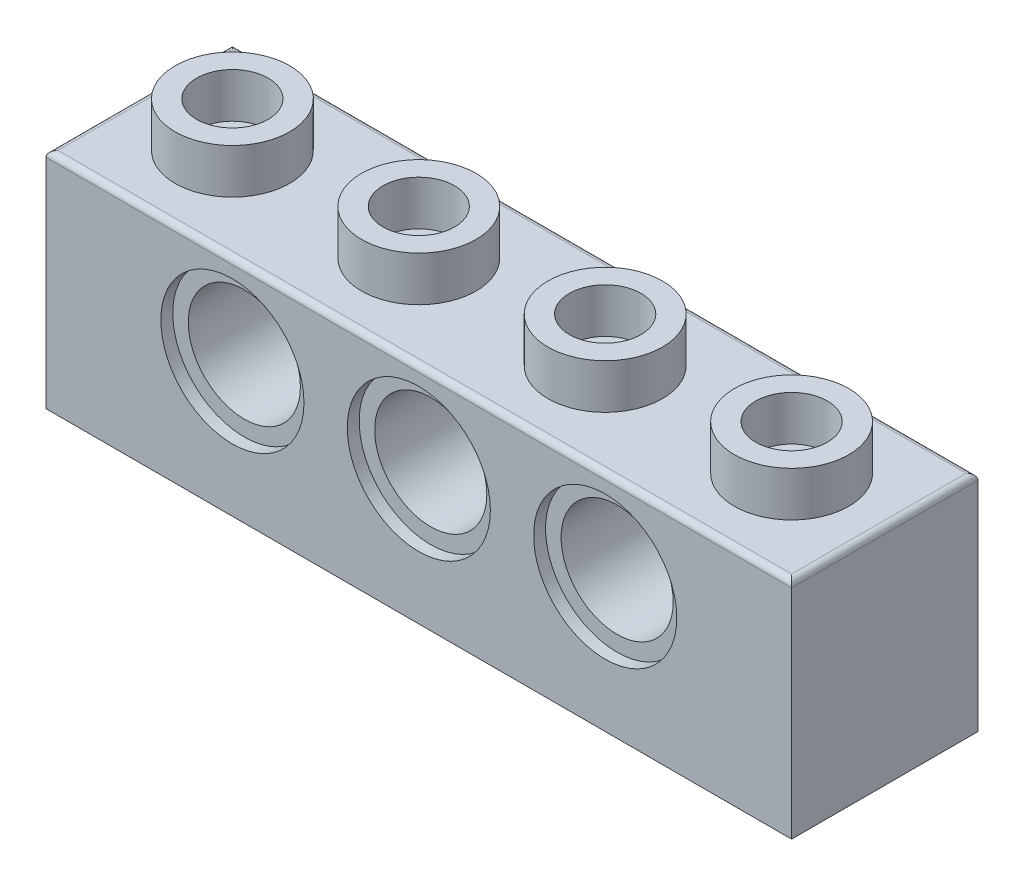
ISO-10303-21;
HEADER;
FILE_DESCRIPTION(('STEP AP214'),'2;1');
FILE_NAME('part.step','',(''),(''),'','','');
FILE_SCHEMA(('AUTOMOTIVE_DESIGN { 1 0 10303 214 1 1 1 1 }'));
ENDSEC;
DATA;
#1=APPLICATION_CONTEXT('core data for automotive mechanical design processes');
#2=APPLICATION_PROTOCOL_DEFINITION('international standard','automotive_design',2000,#1);
#3=PRODUCT_CONTEXT('',#1,'mechanical');
#4=PRODUCT('Part','Part','',(#3));
#5=PRODUCT_RELATED_PRODUCT_CATEGORY('part','',(#4));
#6=PRODUCT_DEFINITION_FORMATION('','',#4);
#7=PRODUCT_DEFINITION_CONTEXT('part definition',#1,'design');
#8=PRODUCT_DEFINITION('design','',#6,#7);
#9=PRODUCT_DEFINITION_SHAPE('','',#8);
#10=(LENGTH_UNIT() NAMED_UNIT(*) SI_UNIT(.MILLI.,.METRE.));
#11=(NAMED_UNIT(*) PLANE_ANGLE_UNIT() SI_UNIT($,.RADIAN.));
#12=(NAMED_UNIT(*) SI_UNIT($,.STERADIAN.) SOLID_ANGLE_UNIT());
#13=UNCERTAINTY_MEASURE_WITH_UNIT(LENGTH_MEASURE(1.E-05),#10,'distance_accuracy_value','');
#14=(GEOMETRIC_REPRESENTATION_CONTEXT(3) GLOBAL_UNCERTAINTY_ASSIGNED_CONTEXT((#13)) GLOBAL_UNIT_ASSIGNED_CONTEXT((#10,
#11,#12)) REPRESENTATION_CONTEXT('',''));
#15=CARTESIAN_POINT('',(0.,0.,0.));
#16=DIRECTION('',(0.,0.,1.));
#17=DIRECTION('',(1.,0.,0.));
#18=AXIS2_PLACEMENT_3D('',#15,#16,#17);
#19=CARTESIAN_POINT('',(11.90625,11.43,0.));
#20=DIRECTION('',(0.,-1.,0.));
#21=DIRECTION('',(0.,0.,-1.));
#22=AXIS2_PLACEMENT_3D('',#19,#20,#21);
#23=CYLINDRICAL_SURFACE('',#22,0.850899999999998);
#24=CARTESIAN_POINT('',(11.90625,7.9375,0.));
#25=DIRECTION('',(0.,-1.,0.));
#26=DIRECTION('',(0.,0.,-1.));
#27=AXIS2_PLACEMENT_3D('',#24,#25,#26);
#28=CIRCLE('',#27,0.850899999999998);
#29=CARTESIAN_POINT('',(11.90625,7.9375,-0.850900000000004));
#30=VERTEX_POINT('',#29);
#31=EDGE_CURVE('E479',#30,#30,#28,.F.);
#32=CARTESIAN_POINT('',(11.90625,9.525,0.));
#33=DIRECTION('',(0.,1.,0.));
#34=DIRECTION('',(0.,0.,1.));
#35=AXIS2_PLACEMENT_3D('',#32,#33,#34);
#36=CIRCLE('',#35,0.850899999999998);
#37=CARTESIAN_POINT('',(11.90625,9.525,-0.850900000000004));
#38=VERTEX_POINT('',#37);
#39=EDGE_CURVE('E565',#38,#38,#36,.T.);
#40=CARTESIAN_POINT('',(11.90625,7.9375,-0.850900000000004));
#41=CARTESIAN_POINT('',(11.90625,7.95403645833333,-0.850900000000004));
#42=CARTESIAN_POINT('',(11.90625,7.97057291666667,-0.850900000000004));
#43=CARTESIAN_POINT('',(11.90625,8.00364583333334,-0.850900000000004));
#44=CARTESIAN_POINT('',(11.90625,8.02018229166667,-0.850900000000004));
#45=CARTESIAN_POINT('',(11.90625,8.05325520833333,-0.850900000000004));
#46=CARTESIAN_POINT('',(11.90625,8.06979166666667,-0.850900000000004));
#47=CARTESIAN_POINT('',(11.90625,8.10286458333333,-0.850900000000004));
#48=CARTESIAN_POINT('',(11.90625,8.11940104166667,-0.850900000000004));
#49=CARTESIAN_POINT('',(11.90625,8.15247395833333,-0.850900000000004));
#50=CARTESIAN_POINT('',(11.90625,8.16901041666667,-0.850900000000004));
#51=CARTESIAN_POINT('',(11.90625,8.20208333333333,-0.850900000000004));
#52=CARTESIAN_POINT('',(11.90625,8.21861979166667,-0.850900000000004));
#53=CARTESIAN_POINT('',(11.90625,8.25169270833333,-0.850900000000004));
#54=CARTESIAN_POINT('',(11.90625,8.26822916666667,-0.850900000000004));
#55=CARTESIAN_POINT('',(11.90625,8.30130208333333,-0.850900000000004));
#56=CARTESIAN_POINT('',(11.90625,8.31783854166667,-0.850900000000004));
#57=CARTESIAN_POINT('',(11.90625,8.35091145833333,-0.850900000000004));
#58=CARTESIAN_POINT('',(11.90625,8.36744791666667,-0.850900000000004));
#59=CARTESIAN_POINT('',(11.90625,8.40052083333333,-0.850900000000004));
#60=CARTESIAN_POINT('',(11.90625,8.41705729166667,-0.850900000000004));
#61=CARTESIAN_POINT('',(11.90625,8.45013020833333,-0.850900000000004));
#62=CARTESIAN_POINT('',(11.90625,8.46666666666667,-0.850900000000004));
#63=CARTESIAN_POINT('',(11.90625,8.49973958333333,-0.850900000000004));
#64=CARTESIAN_POINT('',(11.90625,8.51627604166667,-0.850900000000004));
#65=CARTESIAN_POINT('',(11.90625,8.54934895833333,-0.850900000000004));
#66=CARTESIAN_POINT('',(11.90625,8.56588541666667,-0.850900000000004));
#67=CARTESIAN_POINT('',(11.90625,8.59895833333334,-0.850900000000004));
#68=CARTESIAN_POINT('',(11.90625,8.61549479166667,-0.850900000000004));
#69=CARTESIAN_POINT('',(11.90625,8.64856770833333,-0.850900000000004));
#70=CARTESIAN_POINT('',(11.90625,8.66510416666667,-0.850900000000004));
#71=CARTESIAN_POINT('',(11.90625,8.69817708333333,-0.850900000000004));
#72=CARTESIAN_POINT('',(11.90625,8.71471354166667,-0.850900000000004));
#73=CARTESIAN_POINT('',(11.90625,8.74778645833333,-0.850900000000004));
#74=CARTESIAN_POINT('',(11.90625,8.76432291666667,-0.850900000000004));
#75=CARTESIAN_POINT('',(11.90625,8.79739583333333,-0.850900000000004));
#76=CARTESIAN_POINT('',(11.90625,8.81393229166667,-0.850900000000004));
#77=CARTESIAN_POINT('',(11.90625,8.84700520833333,-0.850900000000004));
#78=CARTESIAN_POINT('',(11.90625,8.86354166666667,-0.850900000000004));
#79=CARTESIAN_POINT('',(11.90625,8.89661458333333,-0.850900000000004));
#80=CARTESIAN_POINT('',(11.90625,8.91315104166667,-0.850900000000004));
#81=CARTESIAN_POINT('',(11.90625,8.94622395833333,-0.850900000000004));
#82=CARTESIAN_POINT('',(11.90625,8.96276041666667,-0.850900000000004));
#83=CARTESIAN_POINT('',(11.90625,8.99583333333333,-0.850900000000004));
#84=CARTESIAN_POINT('',(11.90625,9.01236979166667,-0.850900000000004));
#85=CARTESIAN_POINT('',(11.90625,9.04544270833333,-0.850900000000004));
#86=CARTESIAN_POINT('',(11.90625,9.06197916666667,-0.850900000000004));
#87=CARTESIAN_POINT('',(11.90625,9.09505208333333,-0.850900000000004));
#88=CARTESIAN_POINT('',(11.90625,9.11158854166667,-0.850900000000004));
#89=CARTESIAN_POINT('',(11.90625,9.14466145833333,-0.850900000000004));
#90=CARTESIAN_POINT('',(11.90625,9.16119791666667,-0.850900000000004));
#91=CARTESIAN_POINT('',(11.90625,9.19427083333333,-0.850900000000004));
#92=CARTESIAN_POINT('',(11.90625,9.21080729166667,-0.850900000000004));
#93=CARTESIAN_POINT('',(11.90625,9.24388020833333,-0.850900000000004));
#94=CARTESIAN_POINT('',(11.90625,9.26041666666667,-0.850900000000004));
#95=CARTESIAN_POINT('',(11.90625,9.29348958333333,-0.850900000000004));
#96=CARTESIAN_POINT('',(11.90625,9.31002604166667,-0.850900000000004));
#97=CARTESIAN_POINT('',(11.90625,9.34309895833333,-0.850900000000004));
#98=CARTESIAN_POINT('',(11.90625,9.35963541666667,-0.850900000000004));
#99=CARTESIAN_POINT('',(11.90625,9.39270833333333,-0.850900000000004));
#100=CARTESIAN_POINT('',(11.90625,9.40924479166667,-0.850900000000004));
#101=CARTESIAN_POINT('',(11.90625,9.44231770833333,-0.850900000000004));
#102=CARTESIAN_POINT('',(11.90625,9.45885416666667,-0.850900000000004));
#103=CARTESIAN_POINT('',(11.90625,9.49192708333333,-0.850900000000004));
#104=CARTESIAN_POINT('',(11.90625,9.50846354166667,-0.850900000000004));
#105=CARTESIAN_POINT('',(11.90625,9.525,-0.850900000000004));
#106=B_SPLINE_CURVE_WITH_KNOTS('',3,(#40,#41,#42,#43,#44,#45,#46,#47,#48,#49,#50,#51,#52,#53,
#54,#55,#56,#57,#58,#59,#60,#61,#62,#63,#64,#65,#66,#67,#68,#69,#70,#71,#72,#73,#74,#75,#76,#77,
#78,#79,#80,#81,#82,#83,#84,#85,#86,#87,#88,#89,#90,#91,#92,#93,#94,#95,#96,#97,#98,#99,#100,
#101,#102,#103,#104,#105),.UNSPECIFIED.,.F.,.F.,(4,2,2,2,2,2,2,2,2,2,2,2,2,2,2,2,2,2,2,2,2,2,2,
2,2,2,2,2,2,2,2,2,4),(0.,0.0496093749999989,0.0992187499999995,0.148828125,0.198437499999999,
0.248046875,0.297656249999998,0.347265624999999,0.396875,0.446484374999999,0.496093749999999,
0.545703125,0.595312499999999,0.644921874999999,0.69453125,0.744140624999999,0.793749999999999,
0.843359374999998,0.892968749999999,0.942578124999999,0.992187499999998,1.041796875,1.09140625,
1.141015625,1.190625,1.240234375,1.28984375,1.339453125,1.3890625,1.438671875,1.48828125,
1.537890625,1.5875),.UNSPECIFIED.);
#107=EDGE_CURVE('BSEAM40',#30,#38,#106,.T.);
#108=ORIENTED_EDGE('',*,*,#31,.F.);
#109=ORIENTED_EDGE('',*,*,#39,.T.);
#110=ORIENTED_EDGE('',*,*,#107,.T.);
#111=ORIENTED_EDGE('',*,*,#107,.F.);
#112=EDGE_LOOP('',(#108,#110,#109,#111));
#113=FACE_BOUND('',#112,.T.);
#114=ADVANCED_FACE('F40',(#113),#23,.F.);
#115=CARTESIAN_POINT('',(3.96875,11.43,0.));
#116=DIRECTION('',(0.,-1.,0.));
#117=DIRECTION('',(0.,0.,-1.));
#118=AXIS2_PLACEMENT_3D('',#115,#116,#117);
#119=CYLINDRICAL_SURFACE('',#118,0.850899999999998);
#120=CARTESIAN_POINT('',(3.96875,7.9375,0.));
#121=DIRECTION('',(0.,-1.,0.));
#122=DIRECTION('',(0.,0.,-1.));
#123=AXIS2_PLACEMENT_3D('',#120,#121,#122);
#124=CIRCLE('',#123,0.850899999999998);
#125=CARTESIAN_POINT('',(3.96875,7.9375,-0.850900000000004));
#126=VERTEX_POINT('',#125);
#127=EDGE_CURVE('E1195',#126,#126,#124,.F.);
#128=CARTESIAN_POINT('',(3.96875,9.525,0.));
#129=DIRECTION('',(0.,1.,0.));
#130=DIRECTION('',(0.,0.,1.));
#131=AXIS2_PLACEMENT_3D('',#128,#129,#130);
#132=CIRCLE('',#131,0.850899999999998);
#133=CARTESIAN_POINT('',(3.96875,9.525,-0.850900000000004));
#134=VERTEX_POINT('',#133);
#135=EDGE_CURVE('E572',#134,#134,#132,.T.);
#136=CARTESIAN_POINT('',(3.96875,7.9375,-0.850900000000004));
#137=CARTESIAN_POINT('',(3.96875,7.95403645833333,-0.850900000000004));
#138=CARTESIAN_POINT('',(3.96875,7.97057291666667,-0.850900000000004));
#139=CARTESIAN_POINT('',(3.96875,8.00364583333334,-0.850900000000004));
#140=CARTESIAN_POINT('',(3.96875,8.02018229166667,-0.850900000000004));
#141=CARTESIAN_POINT('',(3.96875,8.05325520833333,-0.850900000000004));
#142=CARTESIAN_POINT('',(3.96875,8.06979166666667,-0.850900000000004));
#143=CARTESIAN_POINT('',(3.96875,8.10286458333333,-0.850900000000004));
#144=CARTESIAN_POINT('',(3.96875,8.11940104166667,-0.850900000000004));
#145=CARTESIAN_POINT('',(3.96875,8.15247395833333,-0.850900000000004));
#146=CARTESIAN_POINT('',(3.96875,8.16901041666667,-0.850900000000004));
#147=CARTESIAN_POINT('',(3.96875,8.20208333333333,-0.850900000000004));
#148=CARTESIAN_POINT('',(3.96875,8.21861979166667,-0.850900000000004));
#149=CARTESIAN_POINT('',(3.96875,8.25169270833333,-0.850900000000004));
#150=CARTESIAN_POINT('',(3.96875,8.26822916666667,-0.850900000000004));
#151=CARTESIAN_POINT('',(3.96875,8.30130208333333,-0.850900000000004));
#152=CARTESIAN_POINT('',(3.96875,8.31783854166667,-0.850900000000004));
#153=CARTESIAN_POINT('',(3.96875,8.35091145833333,-0.850900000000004));
#154=CARTESIAN_POINT('',(3.96875,8.36744791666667,-0.850900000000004));
#155=CARTESIAN_POINT('',(3.96875,8.40052083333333,-0.850900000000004));
#156=CARTESIAN_POINT('',(3.96875,8.41705729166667,-0.850900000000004));
#157=CARTESIAN_POINT('',(3.96875,8.45013020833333,-0.850900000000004));
#158=CARTESIAN_POINT('',(3.96875,8.46666666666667,-0.850900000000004));
#159=CARTESIAN_POINT('',(3.96875,8.49973958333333,-0.850900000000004));
#160=CARTESIAN_POINT('',(3.96875,8.51627604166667,-0.850900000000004));
#161=CARTESIAN_POINT('',(3.96875,8.54934895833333,-0.850900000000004));
#162=CARTESIAN_POINT('',(3.96875,8.56588541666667,-0.850900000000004));
#163=CARTESIAN_POINT('',(3.96875,8.59895833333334,-0.850900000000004));
#164=CARTESIAN_POINT('',(3.96875,8.61549479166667,-0.850900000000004));
#165=CARTESIAN_POINT('',(3.96875,8.64856770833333,-0.850900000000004));
#166=CARTESIAN_POINT('',(3.96875,8.66510416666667,-0.850900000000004));
#167=CARTESIAN_POINT('',(3.96875,8.69817708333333,-0.850900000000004));
#168=CARTESIAN_POINT('',(3.96875,8.71471354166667,-0.850900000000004));
#169=CARTESIAN_POINT('',(3.96875,8.74778645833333,-0.850900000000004));
#170=CARTESIAN_POINT('',(3.96875,8.76432291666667,-0.850900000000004));
#171=CARTESIAN_POINT('',(3.96875,8.79739583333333,-0.850900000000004));
#172=CARTESIAN_POINT('',(3.96875,8.81393229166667,-0.850900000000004));
#173=CARTESIAN_POINT('',(3.96875,8.84700520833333,-0.850900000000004));
#174=CARTESIAN_POINT('',(3.96875,8.86354166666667,-0.850900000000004));
#175=CARTESIAN_POINT('',(3.96875,8.89661458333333,-0.850900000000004));
#176=CARTESIAN_POINT('',(3.96875,8.91315104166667,-0.850900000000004));
#177=CARTESIAN_POINT('',(3.96875,8.94622395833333,-0.850900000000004));
#178=CARTESIAN_POINT('',(3.96875,8.96276041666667,-0.850900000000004));
#179=CARTESIAN_POINT('',(3.96875,8.99583333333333,-0.850900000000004));
#180=CARTESIAN_POINT('',(3.96875,9.01236979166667,-0.850900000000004));
#181=CARTESIAN_POINT('',(3.96875,9.04544270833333,-0.850900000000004));
#182=CARTESIAN_POINT('',(3.96875,9.06197916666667,-0.850900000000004));
#183=CARTESIAN_POINT('',(3.96875,9.09505208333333,-0.850900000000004));
#184=CARTESIAN_POINT('',(3.96875,9.11158854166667,-0.850900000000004));
#185=CARTESIAN_POINT('',(3.96875,9.14466145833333,-0.850900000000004));
#186=CARTESIAN_POINT('',(3.96875,9.16119791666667,-0.850900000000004));
#187=CARTESIAN_POINT('',(3.96875,9.19427083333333,-0.850900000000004));
#188=CARTESIAN_POINT('',(3.96875,9.21080729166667,-0.850900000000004));
#189=CARTESIAN_POINT('',(3.96875,9.24388020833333,-0.850900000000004));
#190=CARTESIAN_POINT('',(3.96875,9.26041666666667,-0.850900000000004));
#191=CARTESIAN_POINT('',(3.96875,9.29348958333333,-0.850900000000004));
#192=CARTESIAN_POINT('',(3.96875,9.31002604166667,-0.850900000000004));
#193=CARTESIAN_POINT('',(3.96875,9.34309895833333,-0.850900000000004));
#194=CARTESIAN_POINT('',(3.96875,9.35963541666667,-0.850900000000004));
#195=CARTESIAN_POINT('',(3.96875,9.39270833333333,-0.850900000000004));
#196=CARTESIAN_POINT('',(3.96875,9.40924479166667,-0.850900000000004));
#197=CARTESIAN_POINT('',(3.96875,9.44231770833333,-0.850900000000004));
#198=CARTESIAN_POINT('',(3.96875,9.45885416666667,-0.850900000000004));
#199=CARTESIAN_POINT('',(3.96875,9.49192708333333,-0.850900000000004));
#200=CARTESIAN_POINT('',(3.96875,9.50846354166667,-0.850900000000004));
#201=CARTESIAN_POINT('',(3.96875,9.525,-0.850900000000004));
#202=B_SPLINE_CURVE_WITH_KNOTS('',3,(#136,#137,#138,#139,#140,#141,#142,#143,#144,#145,#146,
#147,#148,#149,#150,#151,#152,#153,#154,#155,#156,#157,#158,#159,#160,#161,#162,#163,#164,#165,
#166,#167,#168,#169,#170,#171,#172,#173,#174,#175,#176,#177,#178,#179,#180,#181,#182,#183,#184,
#185,#186,#187,#188,#189,#190,#191,#192,#193,#194,#195,#196,#197,#198,#199,#200,#201),
.UNSPECIFIED.,.F.,.F.,(4,2,2,2,2,2,2,2,2,2,2,2,2,2,2,2,2,2,2,2,2,2,2,2,2,2,2,2,2,2,2,2,4),(0.,
0.0496093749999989,0.0992187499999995,0.148828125,0.198437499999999,0.248046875,
0.297656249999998,0.347265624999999,0.396875,0.446484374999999,0.496093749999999,0.545703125,
0.595312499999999,0.644921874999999,0.69453125,0.744140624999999,0.793749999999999,
0.843359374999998,0.892968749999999,0.942578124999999,0.992187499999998,1.041796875,1.09140625,
1.141015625,1.190625,1.240234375,1.28984375,1.339453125,1.3890625,1.438671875,1.48828125,
1.537890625,1.5875),.UNSPECIFIED.);
#203=EDGE_CURVE('BSEAM321',#126,#134,#202,.T.);
#204=ORIENTED_EDGE('',*,*,#127,.F.);
#205=ORIENTED_EDGE('',*,*,#135,.T.);
#206=ORIENTED_EDGE('',*,*,#203,.T.);
#207=ORIENTED_EDGE('',*,*,#203,.F.);
#208=EDGE_LOOP('',(#204,#206,#205,#207));
#209=FACE_BOUND('',#208,.T.);
#210=ADVANCED_FACE('F321',(#209),#119,.F.);
#211=CARTESIAN_POINT('',(-3.96875,11.43,0.));
#212=DIRECTION('',(0.,-1.,0.));
#213=DIRECTION('',(0.,0.,-1.));
#214=AXIS2_PLACEMENT_3D('',#211,#212,#213);
#215=CYLINDRICAL_SURFACE('',#214,0.850899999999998);
#216=CARTESIAN_POINT('',(-3.96875,7.9375,0.));
#217=DIRECTION('',(0.,-1.,0.));
#218=DIRECTION('',(0.,0.,-1.));
#219=AXIS2_PLACEMENT_3D('',#216,#217,#218);
#220=CIRCLE('',#219,0.850899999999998);
#221=CARTESIAN_POINT('',(-3.96875,7.9375,-0.850900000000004));
#222=VERTEX_POINT('',#221);
#223=EDGE_CURVE('E455',#222,#222,#220,.F.);
#224=CARTESIAN_POINT('',(-3.96875,9.525,0.));
#225=DIRECTION('',(0.,1.,0.));
#226=DIRECTION('',(0.,0.,1.));
#227=AXIS2_PLACEMENT_3D('',#224,#225,#226);
#228=CIRCLE('',#227,0.850899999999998);
#229=CARTESIAN_POINT('',(-3.96875,9.525,-0.850900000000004));
#230=VERTEX_POINT('',#229);
#231=EDGE_CURVE('E579',#230,#230,#228,.T.);
#232=CARTESIAN_POINT('',(-3.96875,7.9375,-0.850900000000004));
#233=CARTESIAN_POINT('',(-3.96875,7.95403645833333,-0.850900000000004));
#234=CARTESIAN_POINT('',(-3.96875,7.97057291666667,-0.850900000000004));
#235=CARTESIAN_POINT('',(-3.96875,8.00364583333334,-0.850900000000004));
#236=CARTESIAN_POINT('',(-3.96875,8.02018229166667,-0.850900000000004));
#237=CARTESIAN_POINT('',(-3.96875,8.05325520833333,-0.850900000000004));
#238=CARTESIAN_POINT('',(-3.96875,8.06979166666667,-0.850900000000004));
#239=CARTESIAN_POINT('',(-3.96875,8.10286458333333,-0.850900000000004));
#240=CARTESIAN_POINT('',(-3.96875,8.11940104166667,-0.850900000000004));
#241=CARTESIAN_POINT('',(-3.96875,8.15247395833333,-0.850900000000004));
#242=CARTESIAN_POINT('',(-3.96875,8.16901041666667,-0.850900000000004));
#243=CARTESIAN_POINT('',(-3.96875,8.20208333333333,-0.850900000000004));
#244=CARTESIAN_POINT('',(-3.96875,8.21861979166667,-0.850900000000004));
#245=CARTESIAN_POINT('',(-3.96875,8.25169270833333,-0.850900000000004));
#246=CARTESIAN_POINT('',(-3.96875,8.26822916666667,-0.850900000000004));
#247=CARTESIAN_POINT('',(-3.96875,8.30130208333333,-0.850900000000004));
#248=CARTESIAN_POINT('',(-3.96875,8.31783854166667,-0.850900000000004));
#249=CARTESIAN_POINT('',(-3.96875,8.35091145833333,-0.850900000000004));
#250=CARTESIAN_POINT('',(-3.96875,8.36744791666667,-0.850900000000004));
#251=CARTESIAN_POINT('',(-3.96875,8.40052083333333,-0.850900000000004));
#252=CARTESIAN_POINT('',(-3.96875,8.41705729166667,-0.850900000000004));
#253=CARTESIAN_POINT('',(-3.96875,8.45013020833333,-0.850900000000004));
#254=CARTESIAN_POINT('',(-3.96875,8.46666666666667,-0.850900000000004));
#255=CARTESIAN_POINT('',(-3.96875,8.49973958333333,-0.850900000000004));
#256=CARTESIAN_POINT('',(-3.96875,8.51627604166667,-0.850900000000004));
#257=CARTESIAN_POINT('',(-3.96875,8.54934895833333,-0.850900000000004));
#258=CARTESIAN_POINT('',(-3.96875,8.56588541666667,-0.850900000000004));
#259=CARTESIAN_POINT('',(-3.96875,8.59895833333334,-0.850900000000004));
#260=CARTESIAN_POINT('',(-3.96875,8.61549479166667,-0.850900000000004));
#261=CARTESIAN_POINT('',(-3.96875,8.64856770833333,-0.850900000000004));
#262=CARTESIAN_POINT('',(-3.96875,8.66510416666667,-0.850900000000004));
#263=CARTESIAN_POINT('',(-3.96875,8.69817708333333,-0.850900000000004));
#264=CARTESIAN_POINT('',(-3.96875,8.71471354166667,-0.850900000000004));
#265=CARTESIAN_POINT('',(-3.96875,8.74778645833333,-0.850900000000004));
#266=CARTESIAN_POINT('',(-3.96875,8.76432291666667,-0.850900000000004));
#267=CARTESIAN_POINT('',(-3.96875,8.79739583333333,-0.850900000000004));
#268=CARTESIAN_POINT('',(-3.96875,8.81393229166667,-0.850900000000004));
#269=CARTESIAN_POINT('',(-3.96875,8.84700520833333,-0.850900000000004));
#270=CARTESIAN_POINT('',(-3.96875,8.86354166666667,-0.850900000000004));
#271=CARTESIAN_POINT('',(-3.96875,8.89661458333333,-0.850900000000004));
#272=CARTESIAN_POINT('',(-3.96875,8.91315104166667,-0.850900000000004));
#273=CARTESIAN_POINT('',(-3.96875,8.94622395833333,-0.850900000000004));
#274=CARTESIAN_POINT('',(-3.96875,8.96276041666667,-0.850900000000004));
#275=CARTESIAN_POINT('',(-3.96875,8.99583333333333,-0.850900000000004));
#276=CARTESIAN_POINT('',(-3.96875,9.01236979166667,-0.850900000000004));
#277=CARTESIAN_POINT('',(-3.96875,9.04544270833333,-0.850900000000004));
#278=CARTESIAN_POINT('',(-3.96875,9.06197916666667,-0.850900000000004));
#279=CARTESIAN_POINT('',(-3.96875,9.09505208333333,-0.850900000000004));
#280=CARTESIAN_POINT('',(-3.96875,9.11158854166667,-0.850900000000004));
#281=CARTESIAN_POINT('',(-3.96875,9.14466145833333,-0.850900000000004));
#282=CARTESIAN_POINT('',(-3.96875,9.16119791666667,-0.850900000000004));
#283=CARTESIAN_POINT('',(-3.96875,9.19427083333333,-0.850900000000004));
#284=CARTESIAN_POINT('',(-3.96875,9.21080729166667,-0.850900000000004));
#285=CARTESIAN_POINT('',(-3.96875,9.24388020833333,-0.850900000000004));
#286=CARTESIAN_POINT('',(-3.96875,9.26041666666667,-0.850900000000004));
#287=CARTESIAN_POINT('',(-3.96875,9.29348958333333,-0.850900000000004));
#288=CARTESIAN_POINT('',(-3.96875,9.31002604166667,-0.850900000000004));
#289=CARTESIAN_POINT('',(-3.96875,9.34309895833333,-0.850900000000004));
#290=CARTESIAN_POINT('',(-3.96875,9.35963541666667,-0.850900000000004));
#291=CARTESIAN_POINT('',(-3.96875,9.39270833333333,-0.850900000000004));
#292=CARTESIAN_POINT('',(-3.96875,9.40924479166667,-0.850900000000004));
#293=CARTESIAN_POINT('',(-3.96875,9.44231770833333,-0.850900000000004));
#294=CARTESIAN_POINT('',(-3.96875,9.45885416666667,-0.850900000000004));
#295=CARTESIAN_POINT('',(-3.96875,9.49192708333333,-0.850900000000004));
#296=CARTESIAN_POINT('',(-3.96875,9.50846354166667,-0.850900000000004));
#297=CARTESIAN_POINT('',(-3.96875,9.525,-0.850900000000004));
#298=B_SPLINE_CURVE_WITH_KNOTS('',3,(#232,#233,#234,#235,#236,#237,#238,#239,#240,#241,#242,
#243,#244,#245,#246,#247,#248,#249,#250,#251,#252,#253,#254,#255,#256,#257,#258,#259,#260,#261,
#262,#263,#264,#265,#266,#267,#268,#269,#270,#271,#272,#273,#274,#275,#276,#277,#278,#279,#280,
#281,#282,#283,#284,#285,#286,#287,#288,#289,#290,#291,#292,#293,#294,#295,#296,#297),
.UNSPECIFIED.,.F.,.F.,(4,2,2,2,2,2,2,2,2,2,2,2,2,2,2,2,2,2,2,2,2,2,2,2,2,2,2,2,2,2,2,2,4),(0.,
0.0496093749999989,0.0992187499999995,0.148828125,0.198437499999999,0.248046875,
0.297656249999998,0.347265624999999,0.396875,0.446484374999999,0.496093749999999,0.545703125,
0.595312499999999,0.644921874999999,0.69453125,0.744140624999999,0.793749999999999,
0.843359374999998,0.892968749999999,0.942578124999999,0.992187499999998,1.041796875,1.09140625,
1.141015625,1.190625,1.240234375,1.28984375,1.339453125,1.3890625,1.438671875,1.48828125,
1.537890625,1.5875),.UNSPECIFIED.);
#299=EDGE_CURVE('BSEAM317',#222,#230,#298,.T.);
#300=ORIENTED_EDGE('',*,*,#223,.F.);
#301=ORIENTED_EDGE('',*,*,#231,.T.);
#302=ORIENTED_EDGE('',*,*,#299,.T.);
#303=ORIENTED_EDGE('',*,*,#299,.F.);
#304=EDGE_LOOP('',(#300,#302,#301,#303));
#305=FACE_BOUND('',#304,.T.);
#306=ADVANCED_FACE('F317',(#305),#215,.F.);
#307=CARTESIAN_POINT('',(-11.90625,11.43,0.));
#308=DIRECTION('',(0.,-1.,0.));
#309=DIRECTION('',(0.,0.,-1.));
#310=AXIS2_PLACEMENT_3D('',#307,#308,#309);
#311=CYLINDRICAL_SURFACE('',#310,0.850899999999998);
#312=CARTESIAN_POINT('',(-11.90625,7.9375,0.));
#313=DIRECTION('',(0.,-1.,0.));
#314=DIRECTION('',(0.,0.,-1.));
#315=AXIS2_PLACEMENT_3D('',#312,#313,#314);
#316=CIRCLE('',#315,0.850899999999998);
#317=CARTESIAN_POINT('',(-11.90625,7.9375,-0.850900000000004));
#318=VERTEX_POINT('',#317);
#319=EDGE_CURVE('E452',#318,#318,#316,.F.);
#320=CARTESIAN_POINT('',(-11.90625,9.525,0.));
#321=DIRECTION('',(0.,1.,0.));
#322=DIRECTION('',(0.,0.,1.));
#323=AXIS2_PLACEMENT_3D('',#320,#321,#322);
#324=CIRCLE('',#323,0.850899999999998);
#325=CARTESIAN_POINT('',(-11.90625,9.525,-0.850900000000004));
#326=VERTEX_POINT('',#325);
#327=EDGE_CURVE('E263',#326,#326,#324,.T.);
#328=CARTESIAN_POINT('',(-11.90625,7.9375,-0.850900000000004));
#329=CARTESIAN_POINT('',(-11.90625,7.95403645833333,-0.850900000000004));
#330=CARTESIAN_POINT('',(-11.90625,7.97057291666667,-0.850900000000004));
#331=CARTESIAN_POINT('',(-11.90625,8.00364583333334,-0.850900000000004));
#332=CARTESIAN_POINT('',(-11.90625,8.02018229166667,-0.850900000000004));
#333=CARTESIAN_POINT('',(-11.90625,8.05325520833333,-0.850900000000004));
#334=CARTESIAN_POINT('',(-11.90625,8.06979166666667,-0.850900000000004));
#335=CARTESIAN_POINT('',(-11.90625,8.10286458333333,-0.850900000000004));
#336=CARTESIAN_POINT('',(-11.90625,8.11940104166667,-0.850900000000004));
#337=CARTESIAN_POINT('',(-11.90625,8.15247395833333,-0.850900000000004));
#338=CARTESIAN_POINT('',(-11.90625,8.16901041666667,-0.850900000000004));
#339=CARTESIAN_POINT('',(-11.90625,8.20208333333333,-0.850900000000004));
#340=CARTESIAN_POINT('',(-11.90625,8.21861979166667,-0.850900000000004));
#341=CARTESIAN_POINT('',(-11.90625,8.25169270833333,-0.850900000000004));
#342=CARTESIAN_POINT('',(-11.90625,8.26822916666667,-0.850900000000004));
#343=CARTESIAN_POINT('',(-11.90625,8.30130208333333,-0.850900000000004));
#344=CARTESIAN_POINT('',(-11.90625,8.31783854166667,-0.850900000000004));
#345=CARTESIAN_POINT('',(-11.90625,8.35091145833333,-0.850900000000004));
#346=CARTESIAN_POINT('',(-11.90625,8.36744791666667,-0.850900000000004));
#347=CARTESIAN_POINT('',(-11.90625,8.40052083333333,-0.850900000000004));
#348=CARTESIAN_POINT('',(-11.90625,8.41705729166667,-0.850900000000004));
#349=CARTESIAN_POINT('',(-11.90625,8.45013020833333,-0.850900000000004));
#350=CARTESIAN_POINT('',(-11.90625,8.46666666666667,-0.850900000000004));
#351=CARTESIAN_POINT('',(-11.90625,8.49973958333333,-0.850900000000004));
#352=CARTESIAN_POINT('',(-11.90625,8.51627604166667,-0.850900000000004));
#353=CARTESIAN_POINT('',(-11.90625,8.54934895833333,-0.850900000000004));
#354=CARTESIAN_POINT('',(-11.90625,8.56588541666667,-0.850900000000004));
#355=CARTESIAN_POINT('',(-11.90625,8.59895833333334,-0.850900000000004));
#356=CARTESIAN_POINT('',(-11.90625,8.61549479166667,-0.850900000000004));
#357=CARTESIAN_POINT('',(-11.90625,8.64856770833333,-0.850900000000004));
#358=CARTESIAN_POINT('',(-11.90625,8.66510416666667,-0.850900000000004));
#359=CARTESIAN_POINT('',(-11.90625,8.69817708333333,-0.850900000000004));
#360=CARTESIAN_POINT('',(-11.90625,8.71471354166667,-0.850900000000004));
#361=CARTESIAN_POINT('',(-11.90625,8.74778645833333,-0.850900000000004));
#362=CARTESIAN_POINT('',(-11.90625,8.76432291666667,-0.850900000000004));
#363=CARTESIAN_POINT('',(-11.90625,8.79739583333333,-0.850900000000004));
#364=CARTESIAN_POINT('',(-11.90625,8.81393229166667,-0.850900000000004));
#365=CARTESIAN_POINT('',(-11.90625,8.84700520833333,-0.850900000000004));
#366=CARTESIAN_POINT('',(-11.90625,8.86354166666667,-0.850900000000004));
#367=CARTESIAN_POINT('',(-11.90625,8.89661458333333,-0.850900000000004));
#368=CARTESIAN_POINT('',(-11.90625,8.91315104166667,-0.850900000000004));
#369=CARTESIAN_POINT('',(-11.90625,8.94622395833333,-0.850900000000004));
#370=CARTESIAN_POINT('',(-11.90625,8.96276041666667,-0.850900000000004));
#371=CARTESIAN_POINT('',(-11.90625,8.99583333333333,-0.850900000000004));
#372=CARTESIAN_POINT('',(-11.90625,9.01236979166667,-0.850900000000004));
#373=CARTESIAN_POINT('',(-11.90625,9.04544270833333,-0.850900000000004));
#374=CARTESIAN_POINT('',(-11.90625,9.06197916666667,-0.850900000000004));
#375=CARTESIAN_POINT('',(-11.90625,9.09505208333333,-0.850900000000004));
#376=CARTESIAN_POINT('',(-11.90625,9.11158854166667,-0.850900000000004));
#377=CARTESIAN_POINT('',(-11.90625,9.14466145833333,-0.850900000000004));
#378=CARTESIAN_POINT('',(-11.90625,9.16119791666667,-0.850900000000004));
#379=CARTESIAN_POINT('',(-11.90625,9.19427083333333,-0.850900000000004));
#380=CARTESIAN_POINT('',(-11.90625,9.21080729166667,-0.850900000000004));
#381=CARTESIAN_POINT('',(-11.90625,9.24388020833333,-0.850900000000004));
#382=CARTESIAN_POINT('',(-11.90625,9.26041666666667,-0.850900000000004));
#383=CARTESIAN_POINT('',(-11.90625,9.29348958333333,-0.850900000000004));
#384=CARTESIAN_POINT('',(-11.90625,9.31002604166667,-0.850900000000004));
#385=CARTESIAN_POINT('',(-11.90625,9.34309895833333,-0.850900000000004));
#386=CARTESIAN_POINT('',(-11.90625,9.35963541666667,-0.850900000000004));
#387=CARTESIAN_POINT('',(-11.90625,9.39270833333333,-0.850900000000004));
#388=CARTESIAN_POINT('',(-11.90625,9.40924479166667,-0.850900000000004));
#389=CARTESIAN_POINT('',(-11.90625,9.44231770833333,-0.850900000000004));
#390=CARTESIAN_POINT('',(-11.90625,9.45885416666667,-0.850900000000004));
#391=CARTESIAN_POINT('',(-11.90625,9.49192708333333,-0.850900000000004));
#392=CARTESIAN_POINT('',(-11.90625,9.50846354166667,-0.850900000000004));
#393=CARTESIAN_POINT('',(-11.90625,9.525,-0.850900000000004));
#394=B_SPLINE_CURVE_WITH_KNOTS('',3,(#328,#329,#330,#331,#332,#333,#334,#335,#336,#337,#338,
#339,#340,#341,#342,#343,#344,#345,#346,#347,#348,#349,#350,#351,#352,#353,#354,#355,#356,#357,
#358,#359,#360,#361,#362,#363,#364,#365,#366,#367,#368,#369,#370,#371,#372,#373,#374,#375,#376,
#377,#378,#379,#380,#381,#382,#383,#384,#385,#386,#387,#388,#389,#390,#391,#392,#393),
.UNSPECIFIED.,.F.,.F.,(4,2,2,2,2,2,2,2,2,2,2,2,2,2,2,2,2,2,2,2,2,2,2,2,2,2,2,2,2,2,2,2,4),(0.,
0.0496093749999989,0.0992187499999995,0.148828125,0.198437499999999,0.248046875,
0.297656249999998,0.347265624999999,0.396875,0.446484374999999,0.496093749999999,0.545703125,
0.595312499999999,0.644921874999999,0.69453125,0.744140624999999,0.793749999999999,
0.843359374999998,0.892968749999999,0.942578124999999,0.992187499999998,1.041796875,1.09140625,
1.141015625,1.190625,1.240234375,1.28984375,1.339453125,1.3890625,1.438671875,1.48828125,
1.537890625,1.5875),.UNSPECIFIED.);
#395=EDGE_CURVE('BSEAM313',#318,#326,#394,.T.);
#396=ORIENTED_EDGE('',*,*,#319,.F.);
#397=ORIENTED_EDGE('',*,*,#327,.T.);
#398=ORIENTED_EDGE('',*,*,#395,.T.);
#399=ORIENTED_EDGE('',*,*,#395,.F.);
#400=EDGE_LOOP('',(#396,#398,#397,#399));
#401=FACE_BOUND('',#400,.T.);
#402=ADVANCED_FACE('F313',(#401),#311,.F.);
#403=CARTESIAN_POINT('',(7.9375,5.715,-3.96874999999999));
#404=DIRECTION('',(0.,0.,1.));
#405=DIRECTION('',(1.,0.,0.));
#406=AXIS2_PLACEMENT_3D('',#403,#404,#405);
#407=CYLINDRICAL_SURFACE('',#406,2.3876);
#408=CARTESIAN_POINT('',(7.9375,5.715,3.46074999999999));
#409=DIRECTION('',(0.,0.,1.));
#410=DIRECTION('',(1.,0.,0.));
#411=AXIS2_PLACEMENT_3D('',#408,#409,#410);
#412=CIRCLE('',#411,2.3876);
#413=CARTESIAN_POINT('',(10.3251,5.715,3.46074999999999));
#414=VERTEX_POINT('',#413);
#415=EDGE_CURVE('E411',#414,#414,#412,.F.);
#416=ORIENTED_EDGE('',*,*,#415,.F.);
#417=EDGE_LOOP('',(#416));
#418=FACE_BOUND('',#417,.T.);
#419=CARTESIAN_POINT('',(7.9375,5.715,-3.20674999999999));
#420=DIRECTION('',(0.,0.,-1.));
#421=DIRECTION('',(-1.,0.,0.));
#422=AXIS2_PLACEMENT_3D('',#419,#420,#421);
#423=CIRCLE('',#422,2.3876);
#424=CARTESIAN_POINT('',(5.5499,5.715,-3.20674999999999));
#425=VERTEX_POINT('',#424);
#426=EDGE_CURVE('E215',#425,#425,#423,.F.);
#427=ORIENTED_EDGE('',*,*,#426,.F.);
#428=EDGE_LOOP('',(#427));
#429=FACE_BOUND('',#428,.T.);
#430=ADVANCED_FACE('F316',(#418,#429),#407,.F.);
#431=CARTESIAN_POINT('',(0.,5.715,-3.96874999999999));
#432=DIRECTION('',(0.,0.,1.));
#433=DIRECTION('',(1.,0.,0.));
#434=AXIS2_PLACEMENT_3D('',#431,#432,#433);
#435=CYLINDRICAL_SURFACE('',#434,2.3876);
#436=CARTESIAN_POINT('',(0.,5.715,3.46074999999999));
#437=DIRECTION('',(0.,0.,1.));
#438=DIRECTION('',(1.,0.,0.));
#439=AXIS2_PLACEMENT_3D('',#436,#437,#438);
#440=CIRCLE('',#439,2.3876);
#441=CARTESIAN_POINT('',(2.3876,5.715,3.46074999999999));
#442=VERTEX_POINT('',#441);
#443=EDGE_CURVE('E406',#442,#442,#440,.F.);
#444=ORIENTED_EDGE('',*,*,#443,.F.);
#445=EDGE_LOOP('',(#444));
#446=FACE_BOUND('',#445,.T.);
#447=CARTESIAN_POINT('',(0.,5.715,-3.20674999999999));
#448=DIRECTION('',(0.,0.,-1.));
#449=DIRECTION('',(-1.,0.,0.));
#450=AXIS2_PLACEMENT_3D('',#447,#448,#449);
#451=CIRCLE('',#450,2.3876);
#452=CARTESIAN_POINT('',(-2.3876,5.715,-3.20674999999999));
#453=VERTEX_POINT('',#452);
#454=EDGE_CURVE('E415',#453,#453,#451,.F.);
#455=ORIENTED_EDGE('',*,*,#454,.F.);
#456=EDGE_LOOP('',(#455));
#457=FACE_BOUND('',#456,.T.);
#458=ADVANCED_FACE('F273',(#446,#457),#435,.F.);
#459=CARTESIAN_POINT('',(-15.875,7.9375,3.96874999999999));
#460=DIRECTION('',(0.,-1.,0.));
#461=DIRECTION('',(0.,0.,-1.));
#462=AXIS2_PLACEMENT_3D('',#459,#460,#461);
#463=PLANE('',#462);
#464=DIRECTION('',(0.,0.,1.));
#465=VECTOR('',#464,1.);
#466=CARTESIAN_POINT('',(10.4941242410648,7.9375,-11.9628297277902));
#467=LINE('',#466,#465);
#468=CARTESIAN_POINT('',(10.4941242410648,7.9375,-2.38124999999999));
#469=VERTEX_POINT('',#468);
#470=CARTESIAN_POINT('',(10.4941242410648,7.9375,2.38124999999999));
#471=VERTEX_POINT('',#470);
#472=EDGE_CURVE('E154',#469,#471,#467,.T.);
#473=ORIENTED_EDGE('',*,*,#472,.F.);
#474=DIRECTION('',(1.,0.,0.));
#475=VECTOR('',#474,1.);
#476=CARTESIAN_POINT('',(-15.875,7.9375,-2.38124999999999));
#477=LINE('',#476,#475);
#478=CARTESIAN_POINT('',(14.2875,7.9375,-2.38124999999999));
#479=VERTEX_POINT('',#478);
#480=EDGE_CURVE('E170',#469,#479,#477,.T.);
#481=ORIENTED_EDGE('',*,*,#480,.T.);
#482=DIRECTION('',(0.,0.,-1.));
#483=VECTOR('',#482,1.);
#484=CARTESIAN_POINT('',(14.2875,7.9375,3.96874999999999));
#485=LINE('',#484,#483);
#486=CARTESIAN_POINT('',(14.2875,7.9375,2.38124999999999));
#487=VERTEX_POINT('',#486);
#488=EDGE_CURVE('E181',#487,#479,#485,.T.);
#489=ORIENTED_EDGE('',*,*,#488,.F.);
#490=DIRECTION('',(-1.,0.,0.));
#491=VECTOR('',#490,1.);
#492=CARTESIAN_POINT('',(-15.875,7.9375,2.38124999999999));
#493=LINE('',#492,#491);
#494=EDGE_CURVE('E173',#487,#471,#493,.T.);
#495=ORIENTED_EDGE('',*,*,#494,.T.);
#496=EDGE_LOOP('',(#473,#481,#489,#495));
#497=FACE_BOUND('',#496,.T.);
#498=ORIENTED_EDGE('',*,*,#31,.T.);
#499=EDGE_LOOP('',(#498));
#500=FACE_BOUND('',#499,.T.);
#501=ADVANCED_FACE('F167',(#497,#500),#463,.T.);
#502=DIRECTION('',(0.,0.,1.));
#503=VECTOR('',#502,1.);
#504=CARTESIAN_POINT('',(5.38087575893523,7.9375,-11.9628297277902));
#505=LINE('',#504,#503);
#506=CARTESIAN_POINT('',(5.38087575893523,7.9375,2.38124999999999));
#507=VERTEX_POINT('',#506);
#508=CARTESIAN_POINT('',(5.38087575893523,7.9375,-2.38124999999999));
#509=VERTEX_POINT('',#508);
#510=EDGE_CURVE('E157',#507,#509,#505,.F.);
#511=ORIENTED_EDGE('',*,*,#510,.F.);
#512=CARTESIAN_POINT('',(2.55662424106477,7.9375,2.38124999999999));
#513=VERTEX_POINT('',#512);
#514=EDGE_CURVE('E462',#507,#513,#493,.T.);
#515=ORIENTED_EDGE('',*,*,#514,.T.);
#516=DIRECTION('',(0.,0.,1.));
#517=VECTOR('',#516,1.);
#518=CARTESIAN_POINT('',(2.55662424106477,7.9375,-11.9628297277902));
#519=LINE('',#518,#517);
#520=CARTESIAN_POINT('',(2.55662424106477,7.9375,-2.38124999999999));
#521=VERTEX_POINT('',#520);
#522=EDGE_CURVE('E600',#521,#513,#519,.T.);
#523=ORIENTED_EDGE('',*,*,#522,.F.);
#524=EDGE_CURVE('E180',#521,#509,#477,.T.);
#525=ORIENTED_EDGE('',*,*,#524,.T.);
#526=EDGE_LOOP('',(#511,#515,#523,#525));
#527=FACE_BOUND('',#526,.T.);
#528=ORIENTED_EDGE('',*,*,#127,.T.);
#529=EDGE_LOOP('',(#528));
#530=FACE_BOUND('',#529,.T.);
#531=ADVANCED_FACE('F293',(#527,#530),#463,.T.);
#532=CARTESIAN_POINT('',(-7.9375,5.715,-3.96874999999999));
#533=DIRECTION('',(0.,0.,1.));
#534=DIRECTION('',(1.,0.,0.));
#535=AXIS2_PLACEMENT_3D('',#532,#533,#534);
#536=CYLINDRICAL_SURFACE('',#535,2.3876);
#537=CARTESIAN_POINT('',(-7.9375,5.715,3.46074999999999));
#538=DIRECTION('',(0.,0.,1.));
#539=DIRECTION('',(1.,0.,0.));
#540=AXIS2_PLACEMENT_3D('',#537,#538,#539);
#541=CIRCLE('',#540,2.3876);
#542=CARTESIAN_POINT('',(-5.5499,5.715,3.46074999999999));
#543=VERTEX_POINT('',#542);
#544=EDGE_CURVE('E396',#543,#543,#541,.F.);
#545=ORIENTED_EDGE('',*,*,#544,.F.);
#546=EDGE_LOOP('',(#545));
#547=FACE_BOUND('',#546,.T.);
#548=CARTESIAN_POINT('',(-7.9375,5.715,-3.20674999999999));
#549=DIRECTION('',(0.,0.,-1.));
#550=DIRECTION('',(-1.,0.,0.));
#551=AXIS2_PLACEMENT_3D('',#548,#549,#550);
#552=CIRCLE('',#551,2.3876);
#553=CARTESIAN_POINT('',(-10.3251,5.715,-3.20674999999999));
#554=VERTEX_POINT('',#553);
#555=EDGE_CURVE('E401',#554,#554,#552,.F.);
#556=ORIENTED_EDGE('',*,*,#555,.F.);
#557=EDGE_LOOP('',(#556));
#558=FACE_BOUND('',#557,.T.);
#559=ADVANCED_FACE('F290',(#547,#558),#536,.F.);
#560=DIRECTION('',(0.,0.,1.));
#561=VECTOR('',#560,1.);
#562=CARTESIAN_POINT('',(-2.55662424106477,7.9375,-11.9628297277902));
#563=LINE('',#562,#561);
#564=CARTESIAN_POINT('',(-2.55662424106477,7.9375,2.38124999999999));
#565=VERTEX_POINT('',#564);
#566=CARTESIAN_POINT('',(-2.55662424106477,7.9375,-2.38124999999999));
#567=VERTEX_POINT('',#566);
#568=EDGE_CURVE('E201',#565,#567,#563,.F.);
#569=ORIENTED_EDGE('',*,*,#568,.F.);
#570=CARTESIAN_POINT('',(-5.38087575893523,7.9375,2.38124999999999));
#571=VERTEX_POINT('',#570);
#572=EDGE_CURVE('E463',#565,#571,#493,.T.);
#573=ORIENTED_EDGE('',*,*,#572,.T.);
#574=DIRECTION('',(0.,0.,1.));
#575=VECTOR('',#574,1.);
#576=CARTESIAN_POINT('',(-5.38087575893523,7.9375,-11.9628297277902));
#577=LINE('',#576,#575);
#578=CARTESIAN_POINT('',(-5.38087575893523,7.9375,-2.38124999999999));
#579=VERTEX_POINT('',#578);
#580=EDGE_CURVE('E204',#579,#571,#577,.T.);
#581=ORIENTED_EDGE('',*,*,#580,.F.);
#582=EDGE_CURVE('E184',#579,#567,#477,.T.);
#583=ORIENTED_EDGE('',*,*,#582,.T.);
#584=EDGE_LOOP('',(#569,#573,#581,#583));
#585=FACE_BOUND('',#584,.T.);
#586=ORIENTED_EDGE('',*,*,#223,.T.);
#587=EDGE_LOOP('',(#586));
#588=FACE_BOUND('',#587,.T.);
#589=ADVANCED_FACE('F199',(#585,#588),#463,.T.);
#590=CARTESIAN_POINT('',(-15.875,0.,3.96874999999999));
#591=DIRECTION('',(0.,-1.,0.));
#592=DIRECTION('',(0.,0.,-1.));
#593=AXIS2_PLACEMENT_3D('',#590,#591,#592);
#594=PLANE('',#593);
#595=DIRECTION('',(0.,0.,1.));
#596=VECTOR('',#595,1.);
#597=CARTESIAN_POINT('',(-15.875,0.,-3.96874999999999));
#598=LINE('',#597,#596);
#599=CARTESIAN_POINT('',(-15.875,0.,-3.96874999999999));
#600=VERTEX_POINT('',#599);
#601=CARTESIAN_POINT('',(-15.875,0.,3.96874999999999));
#602=VERTEX_POINT('',#601);
#603=EDGE_CURVE('E495',#600,#602,#598,.T.);
#604=ORIENTED_EDGE('',*,*,#603,.F.);
#605=DIRECTION('',(1.,0.,0.));
#606=VECTOR('',#605,1.);
#607=CARTESIAN_POINT('',(-15.875,0.,-3.96874999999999));
#608=LINE('',#607,#606);
#609=CARTESIAN_POINT('',(15.875,0.,-3.96874999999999));
#610=VERTEX_POINT('',#609);
#611=EDGE_CURVE('E504',#600,#610,#608,.T.);
#612=ORIENTED_EDGE('',*,*,#611,.T.);
#613=DIRECTION('',(0.,0.,-1.));
#614=VECTOR('',#613,1.);
#615=CARTESIAN_POINT('',(15.875,0.,3.96874999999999));
#616=LINE('',#615,#614);
#617=CARTESIAN_POINT('',(15.875,0.,3.96874999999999));
#618=VERTEX_POINT('',#617);
#619=EDGE_CURVE('E501',#618,#610,#616,.T.);
#620=ORIENTED_EDGE('',*,*,#619,.F.);
#621=DIRECTION('',(-1.,0.,0.));
#622=VECTOR('',#621,1.);
#623=CARTESIAN_POINT('',(15.875,0.,3.96874999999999));
#624=LINE('',#623,#622);
#625=EDGE_CURVE('E498',#618,#602,#624,.T.);
#626=ORIENTED_EDGE('',*,*,#625,.T.);
#627=EDGE_LOOP('',(#604,#612,#620,#626));
#628=FACE_BOUND('',#627,.T.);
#629=DIRECTION('',(1.,0.,0.));
#630=VECTOR('',#629,1.);
#631=CARTESIAN_POINT('',(-15.875,0.,-2.38124999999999));
#632=LINE('',#631,#630);
#633=CARTESIAN_POINT('',(-14.2875,0.,-2.38124999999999));
#634=VERTEX_POINT('',#633);
#635=CARTESIAN_POINT('',(14.2875,0.,-2.38124999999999));
#636=VERTEX_POINT('',#635);
#637=EDGE_CURVE('E461',#634,#636,#632,.T.);
#638=ORIENTED_EDGE('',*,*,#637,.F.);
#639=DIRECTION('',(0.,0.,1.));
#640=VECTOR('',#639,1.);
#641=CARTESIAN_POINT('',(-14.2875,0.,3.96874999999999));
#642=LINE('',#641,#640);
#643=CARTESIAN_POINT('',(-14.2875,0.,2.38124999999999));
#644=VERTEX_POINT('',#643);
#645=EDGE_CURVE('E399',#634,#644,#642,.T.);
#646=ORIENTED_EDGE('',*,*,#645,.T.);
#647=DIRECTION('',(-1.,0.,0.));
#648=VECTOR('',#647,1.);
#649=CARTESIAN_POINT('',(-15.875,0.,2.38124999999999));
#650=LINE('',#649,#648);
#651=CARTESIAN_POINT('',(14.2875,0.,2.38124999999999));
#652=VERTEX_POINT('',#651);
#653=EDGE_CURVE('E472',#652,#644,#650,.T.);
#654=ORIENTED_EDGE('',*,*,#653,.F.);
#655=DIRECTION('',(0.,0.,-1.));
#656=VECTOR('',#655,1.);
#657=CARTESIAN_POINT('',(14.2875,0.,3.96874999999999));
#658=LINE('',#657,#656);
#659=EDGE_CURVE('E485',#652,#636,#658,.T.);
#660=ORIENTED_EDGE('',*,*,#659,.T.);
#661=EDGE_LOOP('',(#638,#646,#654,#660));
#662=FACE_BOUND('',#661,.T.);
#663=ADVANCED_FACE('F347',(#628,#662),#594,.T.);
#664=CARTESIAN_POINT('',(-15.875,9.525,3.96874999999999));
#665=DIRECTION('',(0.,-1.,0.));
#666=DIRECTION('',(0.,0.,-1.));
#667=AXIS2_PLACEMENT_3D('',#664,#665,#666);
#668=PLANE('',#667);
#669=DIRECTION('',(0.,0.,-1.));
#670=VECTOR('',#669,1.);
#671=CARTESIAN_POINT('',(15.621,9.525,3.96874999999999));
#672=LINE('',#671,#670);
#673=CARTESIAN_POINT('',(15.621,9.525,3.71474999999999));
#674=VERTEX_POINT('',#673);
#675=CARTESIAN_POINT('',(15.621,9.525,-3.71474999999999));
#676=VERTEX_POINT('',#675);
#677=EDGE_CURVE('E551',#674,#676,#672,.T.);
#678=ORIENTED_EDGE('',*,*,#677,.T.);
#679=DIRECTION('',(1.,0.,0.));
#680=VECTOR('',#679,1.);
#681=CARTESIAN_POINT('',(-15.875,9.525,-3.71474999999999));
#682=LINE('',#681,#680);
#683=CARTESIAN_POINT('',(-15.621,9.525,-3.71474999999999));
#684=VERTEX_POINT('',#683);
#685=EDGE_CURVE('E1213',#676,#684,#682,.F.);
#686=ORIENTED_EDGE('',*,*,#685,.T.);
#687=DIRECTION('',(0.,0.,1.));
#688=VECTOR('',#687,1.);
#689=CARTESIAN_POINT('',(-15.621,9.525,3.96874999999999));
#690=LINE('',#689,#688);
#691=CARTESIAN_POINT('',(-15.621,9.525,3.71474999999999));
#692=VERTEX_POINT('',#691);
#693=EDGE_CURVE('E1208',#684,#692,#690,.T.);
#694=ORIENTED_EDGE('',*,*,#693,.T.);
#695=DIRECTION('',(-1.,0.,0.));
#696=VECTOR('',#695,1.);
#697=CARTESIAN_POINT('',(15.875,9.525,3.71474999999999));
#698=LINE('',#697,#696);
#699=EDGE_CURVE('E1210',#692,#674,#698,.F.);
#700=ORIENTED_EDGE('',*,*,#699,.T.);
#701=EDGE_LOOP('',(#678,#686,#694,#700));
#702=FACE_BOUND('',#701,.T.);
#703=CARTESIAN_POINT('',(-11.90625,9.525,0.));
#704=DIRECTION('',(0.,-1.,0.));
#705=DIRECTION('',(0.,0.,-1.));
#706=AXIS2_PLACEMENT_3D('',#703,#704,#705);
#707=CIRCLE('',#706,2.4384);
#708=CARTESIAN_POINT('',(-11.90625,9.525,-2.4384));
#709=VERTEX_POINT('',#708);
#710=EDGE_CURVE('E515',#709,#709,#707,.F.);
#711=ORIENTED_EDGE('',*,*,#710,.F.);
#712=EDGE_LOOP('',(#711));
#713=FACE_BOUND('',#712,.T.);
#714=CARTESIAN_POINT('',(-3.96875,9.525,0.));
#715=DIRECTION('',(0.,-1.,0.));
#716=DIRECTION('',(0.,0.,-1.));
#717=AXIS2_PLACEMENT_3D('',#714,#715,#716);
#718=CIRCLE('',#717,2.4384);
#719=CARTESIAN_POINT('',(-3.96875,9.525,-2.4384));
#720=VERTEX_POINT('',#719);
#721=EDGE_CURVE('E518',#720,#720,#718,.F.);
#722=ORIENTED_EDGE('',*,*,#721,.F.);
#723=EDGE_LOOP('',(#722));
#724=FACE_BOUND('',#723,.T.);
#725=CARTESIAN_POINT('',(3.96875,9.525,0.));
#726=DIRECTION('',(0.,-1.,0.));
#727=DIRECTION('',(0.,0.,-1.));
#728=AXIS2_PLACEMENT_3D('',#725,#726,#727);
#729=CIRCLE('',#728,2.4384);
#730=CARTESIAN_POINT('',(3.96875,9.525,-2.4384));
#731=VERTEX_POINT('',#730);
#732=EDGE_CURVE('E392',#731,#731,#729,.F.);
#733=ORIENTED_EDGE('',*,*,#732,.F.);
#734=EDGE_LOOP('',(#733));
#735=FACE_BOUND('',#734,.T.);
#736=CARTESIAN_POINT('',(11.90625,9.525,0.));
#737=DIRECTION('',(0.,-1.,0.));
#738=DIRECTION('',(0.,0.,-1.));
#739=AXIS2_PLACEMENT_3D('',#736,#737,#738);
#740=CIRCLE('',#739,2.4384);
#741=CARTESIAN_POINT('',(11.90625,9.525,-2.4384));
#742=VERTEX_POINT('',#741);
#743=EDGE_CURVE('E386',#742,#742,#740,.F.);
#744=ORIENTED_EDGE('',*,*,#743,.F.);
#745=EDGE_LOOP('',(#744));
#746=FACE_BOUND('',#745,.T.);
#747=ADVANCED_FACE('F350',(#702,#713,#724,#735,#746),#668,.F.);
#748=CARTESIAN_POINT('',(-15.875,9.525,-3.96874999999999));
#749=DIRECTION('',(1.,0.,0.));
#750=DIRECTION('',(0.,0.,-1.));
#751=AXIS2_PLACEMENT_3D('',#748,#749,#750);
#752=PLANE('',#751);
#753=DIRECTION('',(0.,-1.,0.));
#754=VECTOR('',#753,1.);
#755=CARTESIAN_POINT('',(-15.875,9.525,3.96874999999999));
#756=LINE('',#755,#754);
#757=CARTESIAN_POINT('',(-15.875,9.271,3.96874999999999));
#758=VERTEX_POINT('',#757);
#759=EDGE_CURVE('E513',#758,#602,#756,.T.);
#760=ORIENTED_EDGE('',*,*,#759,.F.);
#761=DIRECTION('',(0.,0.,1.));
#762=VECTOR('',#761,1.);
#763=CARTESIAN_POINT('',(-15.875,9.271,-3.96874999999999));
#764=LINE('',#763,#762);
#765=CARTESIAN_POINT('',(-15.875,9.271,-3.96874999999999));
#766=VERTEX_POINT('',#765);
#767=EDGE_CURVE('E11',#758,#766,#764,.F.);
#768=ORIENTED_EDGE('',*,*,#767,.T.);
#769=DIRECTION('',(0.,-1.,0.));
#770=VECTOR('',#769,1.);
#771=CARTESIAN_POINT('',(-15.875,9.525,-3.96874999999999));
#772=LINE('',#771,#770);
#773=EDGE_CURVE('E507',#766,#600,#772,.T.);
#774=ORIENTED_EDGE('',*,*,#773,.T.);
#775=ORIENTED_EDGE('',*,*,#603,.T.);
#776=EDGE_LOOP('',(#760,#768,#774,#775));
#777=FACE_BOUND('',#776,.T.);
#778=ADVANCED_FACE('F354',(#777),#752,.F.);
#779=CARTESIAN_POINT('',(15.875,9.525,3.96874999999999));
#780=DIRECTION('',(0.,0.,1.));
#781=DIRECTION('',(1.,0.,0.));
#782=AXIS2_PLACEMENT_3D('',#779,#780,#781);
#783=PLANE('',#782);
#784=CARTESIAN_POINT('',(7.9375,5.715,3.96874999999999));
#785=DIRECTION('',(0.,0.,1.));
#786=DIRECTION('',(1.,0.,0.));
#787=AXIS2_PLACEMENT_3D('',#784,#785,#786);
#788=CIRCLE('',#787,3.048);
#789=CARTESIAN_POINT('',(10.9855,5.715,3.96874999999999));
#790=VERTEX_POINT('',#789);
#791=EDGE_CURVE('E417',#790,#790,#788,.T.);
#792=ORIENTED_EDGE('',*,*,#791,.F.);
#793=EDGE_LOOP('',(#792));
#794=FACE_BOUND('',#793,.T.);
#795=CARTESIAN_POINT('',(0.,5.715,3.96874999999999));
#796=DIRECTION('',(0.,0.,1.));
#797=DIRECTION('',(1.,0.,0.));
#798=AXIS2_PLACEMENT_3D('',#795,#796,#797);
#799=CIRCLE('',#798,3.048);
#800=CARTESIAN_POINT('',(3.048,5.715,3.96874999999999));
#801=VERTEX_POINT('',#800);
#802=EDGE_CURVE('E413',#801,#801,#799,.T.);
#803=ORIENTED_EDGE('',*,*,#802,.F.);
#804=EDGE_LOOP('',(#803));
#805=FACE_BOUND('',#804,.T.);
#806=CARTESIAN_POINT('',(-7.9375,5.715,3.96874999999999));
#807=DIRECTION('',(0.,0.,1.));
#808=DIRECTION('',(1.,0.,0.));
#809=AXIS2_PLACEMENT_3D('',#806,#807,#808);
#810=CIRCLE('',#809,3.048);
#811=CARTESIAN_POINT('',(-4.8895,5.715,3.96874999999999));
#812=VERTEX_POINT('',#811);
#813=EDGE_CURVE('E403',#812,#812,#810,.T.);
#814=ORIENTED_EDGE('',*,*,#813,.F.);
#815=EDGE_LOOP('',(#814));
#816=FACE_BOUND('',#815,.T.);
#817=DIRECTION('',(0.,-1.,0.));
#818=VECTOR('',#817,1.);
#819=CARTESIAN_POINT('',(15.875,9.525,3.96874999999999));
#820=LINE('',#819,#818);
#821=CARTESIAN_POINT('',(15.875,9.271,3.96874999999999));
#822=VERTEX_POINT('',#821);
#823=EDGE_CURVE('E511',#822,#618,#820,.T.);
#824=ORIENTED_EDGE('',*,*,#823,.F.);
#825=DIRECTION('',(-1.,0.,0.));
#826=VECTOR('',#825,1.);
#827=CARTESIAN_POINT('',(-15.875,9.271,3.96874999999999));
#828=LINE('',#827,#826);
#829=EDGE_CURVE('E48',#822,#758,#828,.T.);
#830=ORIENTED_EDGE('',*,*,#829,.T.);
#831=ORIENTED_EDGE('',*,*,#759,.T.);
#832=ORIENTED_EDGE('',*,*,#625,.F.);
#833=EDGE_LOOP('',(#824,#830,#831,#832));
#834=FACE_BOUND('',#833,.T.);
#835=ADVANCED_FACE('F362',(#794,#805,#816,#834),#783,.T.);
#836=CARTESIAN_POINT('',(15.875,9.525,3.96874999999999));
#837=DIRECTION('',(-1.,0.,0.));
#838=DIRECTION('',(0.,0.,1.));
#839=AXIS2_PLACEMENT_3D('',#836,#837,#838);
#840=PLANE('',#839);
#841=DIRECTION('',(0.,-1.,0.));
#842=VECTOR('',#841,1.);
#843=CARTESIAN_POINT('',(15.875,9.525,-3.96874999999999));
#844=LINE('',#843,#842);
#845=CARTESIAN_POINT('',(15.875,9.271,-3.96874999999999));
#846=VERTEX_POINT('',#845);
#847=EDGE_CURVE('E509',#846,#610,#844,.T.);
#848=ORIENTED_EDGE('',*,*,#847,.F.);
#849=DIRECTION('',(0.,0.,-1.));
#850=VECTOR('',#849,1.);
#851=CARTESIAN_POINT('',(15.875,9.271,3.96874999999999));
#852=LINE('',#851,#850);
#853=EDGE_CURVE('E62',#846,#822,#852,.F.);
#854=ORIENTED_EDGE('',*,*,#853,.T.);
#855=ORIENTED_EDGE('',*,*,#823,.T.);
#856=ORIENTED_EDGE('',*,*,#619,.T.);
#857=EDGE_LOOP('',(#848,#854,#855,#856));
#858=FACE_BOUND('',#857,.T.);
#859=ADVANCED_FACE('F358',(#858),#840,.F.);
#860=CARTESIAN_POINT('',(-15.875,9.525,-3.96874999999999));
#861=DIRECTION('',(0.,0.,-1.));
#862=DIRECTION('',(-1.,0.,0.));
#863=AXIS2_PLACEMENT_3D('',#860,#861,#862);
#864=PLANE('',#863);
#865=CARTESIAN_POINT('',(7.9375,5.715,-3.96874999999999));
#866=DIRECTION('',(0.,0.,-1.));
#867=DIRECTION('',(-1.,0.,0.));
#868=AXIS2_PLACEMENT_3D('',#865,#866,#867);
#869=CIRCLE('',#868,3.048);
#870=CARTESIAN_POINT('',(4.8895,5.715,-3.96874999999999));
#871=VERTEX_POINT('',#870);
#872=EDGE_CURVE('E602',#871,#871,#869,.T.);
#873=ORIENTED_EDGE('',*,*,#872,.F.);
#874=EDGE_LOOP('',(#873));
#875=FACE_BOUND('',#874,.T.);
#876=CARTESIAN_POINT('',(0.,5.715,-3.96874999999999));
#877=DIRECTION('',(0.,0.,-1.));
#878=DIRECTION('',(-1.,0.,0.));
#879=AXIS2_PLACEMENT_3D('',#876,#877,#878);
#880=CIRCLE('',#879,3.048);
#881=CARTESIAN_POINT('',(-3.048,5.715,-3.96874999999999));
#882=VERTEX_POINT('',#881);
#883=EDGE_CURVE('E424',#882,#882,#880,.T.);
#884=ORIENTED_EDGE('',*,*,#883,.F.);
#885=EDGE_LOOP('',(#884));
#886=FACE_BOUND('',#885,.T.);
#887=CARTESIAN_POINT('',(-7.9375,5.715,-3.96874999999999));
#888=DIRECTION('',(0.,0.,-1.));
#889=DIRECTION('',(-1.,0.,0.));
#890=AXIS2_PLACEMENT_3D('',#887,#888,#889);
#891=CIRCLE('',#890,3.048);
#892=CARTESIAN_POINT('',(-10.9855,5.715,-3.96874999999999));
#893=VERTEX_POINT('',#892);
#894=EDGE_CURVE('E443',#893,#893,#891,.T.);
#895=ORIENTED_EDGE('',*,*,#894,.F.);
#896=EDGE_LOOP('',(#895));
#897=FACE_BOUND('',#896,.T.);
#898=ORIENTED_EDGE('',*,*,#773,.F.);
#899=DIRECTION('',(1.,0.,0.));
#900=VECTOR('',#899,1.);
#901=CARTESIAN_POINT('',(15.875,9.271,-3.96874999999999));
#902=LINE('',#901,#900);
#903=EDGE_CURVE('E262',#766,#846,#902,.T.);
#904=ORIENTED_EDGE('',*,*,#903,.T.);
#905=ORIENTED_EDGE('',*,*,#847,.T.);
#906=ORIENTED_EDGE('',*,*,#611,.F.);
#907=EDGE_LOOP('',(#898,#904,#905,#906));
#908=FACE_BOUND('',#907,.T.);
#909=ADVANCED_FACE('F345',(#875,#886,#897,#908),#864,.T.);
#910=CARTESIAN_POINT('',(-11.90625,11.43,0.));
#911=DIRECTION('',(0.,-1.,0.));
#912=DIRECTION('',(0.,0.,-1.));
#913=AXIS2_PLACEMENT_3D('',#910,#911,#912);
#914=CYLINDRICAL_SURFACE('',#913,2.4384);
#915=CARTESIAN_POINT('',(-11.90625,11.43,0.));
#916=DIRECTION('',(0.,1.,0.));
#917=DIRECTION('',(0.,0.,1.));
#918=AXIS2_PLACEMENT_3D('',#915,#916,#917);
#919=CIRCLE('',#918,2.4384);
#920=CARTESIAN_POINT('',(-11.90625,11.43,-2.4384));
#921=VERTEX_POINT('',#920);
#922=EDGE_CURVE('E492',#921,#921,#919,.T.);
#923=CARTESIAN_POINT('',(-11.90625,11.43,-2.4384));
#924=CARTESIAN_POINT('',(-11.90625,11.41015625,-2.4384));
#925=CARTESIAN_POINT('',(-11.90625,11.3903125,-2.4384));
#926=CARTESIAN_POINT('',(-11.90625,11.350625,-2.4384));
#927=CARTESIAN_POINT('',(-11.90625,11.33078125,-2.4384));
#928=CARTESIAN_POINT('',(-11.90625,11.29109375,-2.4384));
#929=CARTESIAN_POINT('',(-11.90625,11.27125,-2.4384));
#930=CARTESIAN_POINT('',(-11.90625,11.2315625,-2.4384));
#931=CARTESIAN_POINT('',(-11.90625,11.21171875,-2.4384));
#932=CARTESIAN_POINT('',(-11.90625,11.17203125,-2.4384));
#933=CARTESIAN_POINT('',(-11.90625,11.1521875,-2.4384));
#934=CARTESIAN_POINT('',(-11.90625,11.1125,-2.4384));
#935=CARTESIAN_POINT('',(-11.90625,11.09265625,-2.4384));
#936=CARTESIAN_POINT('',(-11.90625,11.05296875,-2.4384));
#937=CARTESIAN_POINT('',(-11.90625,11.033125,-2.4384));
#938=CARTESIAN_POINT('',(-11.90625,10.9934375,-2.4384));
#939=CARTESIAN_POINT('',(-11.90625,10.97359375,-2.4384));
#940=CARTESIAN_POINT('',(-11.90625,10.93390625,-2.4384));
#941=CARTESIAN_POINT('',(-11.90625,10.9140625,-2.4384));
#942=CARTESIAN_POINT('',(-11.90625,10.874375,-2.4384));
#943=CARTESIAN_POINT('',(-11.90625,10.85453125,-2.4384));
#944=CARTESIAN_POINT('',(-11.90625,10.81484375,-2.4384));
#945=CARTESIAN_POINT('',(-11.90625,10.795,-2.4384));
#946=CARTESIAN_POINT('',(-11.90625,10.7553125,-2.4384));
#947=CARTESIAN_POINT('',(-11.90625,10.73546875,-2.4384));
#948=CARTESIAN_POINT('',(-11.90625,10.69578125,-2.4384));
#949=CARTESIAN_POINT('',(-11.90625,10.6759375,-2.4384));
#950=CARTESIAN_POINT('',(-11.90625,10.63625,-2.4384));
#951=CARTESIAN_POINT('',(-11.90625,10.61640625,-2.4384));
#952=CARTESIAN_POINT('',(-11.90625,10.57671875,-2.4384));
#953=CARTESIAN_POINT('',(-11.90625,10.556875,-2.4384));
#954=CARTESIAN_POINT('',(-11.90625,10.5171875,-2.4384));
#955=CARTESIAN_POINT('',(-11.90625,10.49734375,-2.4384));
#956=CARTESIAN_POINT('',(-11.90625,10.45765625,-2.4384));
#957=CARTESIAN_POINT('',(-11.90625,10.4378125,-2.4384));
#958=CARTESIAN_POINT('',(-11.90625,10.398125,-2.4384));
#959=CARTESIAN_POINT('',(-11.90625,10.37828125,-2.4384));
#960=CARTESIAN_POINT('',(-11.90625,10.33859375,-2.4384));
#961=CARTESIAN_POINT('',(-11.90625,10.31875,-2.4384));
#962=CARTESIAN_POINT('',(-11.90625,10.2790625,-2.4384));
#963=CARTESIAN_POINT('',(-11.90625,10.25921875,-2.4384));
#964=CARTESIAN_POINT('',(-11.90625,10.21953125,-2.4384));
#965=CARTESIAN_POINT('',(-11.90625,10.1996875,-2.4384));
#966=CARTESIAN_POINT('',(-11.90625,10.16,-2.4384));
#967=CARTESIAN_POINT('',(-11.90625,10.14015625,-2.4384));
#968=CARTESIAN_POINT('',(-11.90625,10.10046875,-2.4384));
#969=CARTESIAN_POINT('',(-11.90625,10.080625,-2.4384));
#970=CARTESIAN_POINT('',(-11.90625,10.0409375,-2.4384));
#971=CARTESIAN_POINT('',(-11.90625,10.02109375,-2.4384));
#972=CARTESIAN_POINT('',(-11.90625,9.98140625,-2.4384));
#973=CARTESIAN_POINT('',(-11.90625,9.9615625,-2.4384));
#974=CARTESIAN_POINT('',(-11.90625,9.921875,-2.4384));
#975=CARTESIAN_POINT('',(-11.90625,9.90203125,-2.4384));
#976=CARTESIAN_POINT('',(-11.90625,9.86234375,-2.4384));
#977=CARTESIAN_POINT('',(-11.90625,9.8425,-2.4384));
#978=CARTESIAN_POINT('',(-11.90625,9.8028125,-2.4384));
#979=CARTESIAN_POINT('',(-11.90625,9.78296875,-2.4384));
#980=CARTESIAN_POINT('',(-11.90625,9.74328125,-2.4384));
#981=CARTESIAN_POINT('',(-11.90625,9.7234375,-2.4384));
#982=CARTESIAN_POINT('',(-11.90625,9.68375,-2.4384));
#983=CARTESIAN_POINT('',(-11.90625,9.66390625,-2.4384));
#984=CARTESIAN_POINT('',(-11.90625,9.62421875,-2.4384));
#985=CARTESIAN_POINT('',(-11.90625,9.604375,-2.4384));
#986=CARTESIAN_POINT('',(-11.90625,9.5646875,-2.4384));
#987=CARTESIAN_POINT('',(-11.90625,9.54484375,-2.4384));
#988=CARTESIAN_POINT('',(-11.90625,9.525,-2.4384));
#989=B_SPLINE_CURVE_WITH_KNOTS('',3,(#923,#924,#925,#926,#927,#928,#929,#930,#931,#932,#933,
#934,#935,#936,#937,#938,#939,#940,#941,#942,#943,#944,#945,#946,#947,#948,#949,#950,#951,#952,
#953,#954,#955,#956,#957,#958,#959,#960,#961,#962,#963,#964,#965,#966,#967,#968,#969,#970,#971,
#972,#973,#974,#975,#976,#977,#978,#979,#980,#981,#982,#983,#984,#985,#986,#987,#988),
.UNSPECIFIED.,.F.,.F.,(4,2,2,2,2,2,2,2,2,2,2,2,2,2,2,2,2,2,2,2,2,2,2,2,2,2,2,2,2,2,2,2,4),(0.,
0.0595312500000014,0.119062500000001,0.178593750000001,0.238125,0.29765625,0.3571875,
0.416718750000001,0.476250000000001,0.535781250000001,0.5953125,0.65484375,0.714375,
0.773906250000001,0.833437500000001,0.892968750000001,0.9525,1.01203125,1.0715625,1.13109375,
1.190625,1.25015625,1.3096875,1.36921875,1.42875,1.48828125,1.5478125,1.60734375,1.666875,
1.72640625,1.7859375,1.84546875,1.905),.UNSPECIFIED.);
#990=EDGE_CURVE('BSEAM341',#921,#709,#989,.T.);
#991=ORIENTED_EDGE('',*,*,#922,.F.);
#992=ORIENTED_EDGE('',*,*,#710,.T.);
#993=ORIENTED_EDGE('',*,*,#990,.T.);
#994=ORIENTED_EDGE('',*,*,#990,.F.);
#995=EDGE_LOOP('',(#991,#993,#992,#994));
#996=FACE_BOUND('',#995,.T.);
#997=ADVANCED_FACE('F341',(#996),#914,.T.);
#998=CARTESIAN_POINT('',(-11.90625,11.43,0.));
#999=DIRECTION('',(0.,1.,0.));
#1000=DIRECTION('',(0.,0.,1.));
#1001=AXIS2_PLACEMENT_3D('',#998,#999,#1000);
#1002=PLANE('',#1001);
#1003=CARTESIAN_POINT('',(-11.90625,11.43,0.));
#1004=DIRECTION('',(0.,1.,0.));
#1005=DIRECTION('',(0.,0.,1.));
#1006=AXIS2_PLACEMENT_3D('',#1003,#1004,#1005);
#1007=CIRCLE('',#1006,1.524);
#1008=CARTESIAN_POINT('',(-11.90625,11.43,1.52399999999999));
#1009=VERTEX_POINT('',#1008);
#1010=EDGE_CURVE('E580',#1009,#1009,#1007,.T.);
#1011=ORIENTED_EDGE('',*,*,#1010,.F.);
#1012=EDGE_LOOP('',(#1011));
#1013=FACE_BOUND('',#1012,.T.);
#1014=ORIENTED_EDGE('',*,*,#922,.T.);
#1015=EDGE_LOOP('',(#1014));
#1016=FACE_BOUND('',#1015,.T.);
#1017=ADVANCED_FACE('F335',(#1013,#1016),#1002,.T.);
#1018=CARTESIAN_POINT('',(-3.96875,11.43,0.));
#1019=DIRECTION('',(0.,-1.,0.));
#1020=DIRECTION('',(0.,0.,-1.));
#1021=AXIS2_PLACEMENT_3D('',#1018,#1019,#1020);
#1022=CYLINDRICAL_SURFACE('',#1021,2.4384);
#1023=CARTESIAN_POINT('',(-3.96875,11.43,0.));
#1024=DIRECTION('',(0.,1.,0.));
#1025=DIRECTION('',(0.,0.,1.));
#1026=AXIS2_PLACEMENT_3D('',#1023,#1024,#1025);
#1027=CIRCLE('',#1026,2.4384);
#1028=CARTESIAN_POINT('',(-3.96875,11.43,-2.4384));
#1029=VERTEX_POINT('',#1028);
#1030=EDGE_CURVE('E489',#1029,#1029,#1027,.T.);
#1031=CARTESIAN_POINT('',(-3.96875,11.43,-2.4384));
#1032=CARTESIAN_POINT('',(-3.96875,11.41015625,-2.4384));
#1033=CARTESIAN_POINT('',(-3.96875,11.3903125,-2.4384));
#1034=CARTESIAN_POINT('',(-3.96875,11.350625,-2.4384));
#1035=CARTESIAN_POINT('',(-3.96875,11.33078125,-2.4384));
#1036=CARTESIAN_POINT('',(-3.96875,11.29109375,-2.4384));
#1037=CARTESIAN_POINT('',(-3.96875,11.27125,-2.4384));
#1038=CARTESIAN_POINT('',(-3.96875,11.2315625,-2.4384));
#1039=CARTESIAN_POINT('',(-3.96875,11.21171875,-2.4384));
#1040=CARTESIAN_POINT('',(-3.96875,11.17203125,-2.4384));
#1041=CARTESIAN_POINT('',(-3.96875,11.1521875,-2.4384));
#1042=CARTESIAN_POINT('',(-3.96875,11.1125,-2.4384));
#1043=CARTESIAN_POINT('',(-3.96875,11.09265625,-2.4384));
#1044=CARTESIAN_POINT('',(-3.96875,11.05296875,-2.4384));
#1045=CARTESIAN_POINT('',(-3.96875,11.033125,-2.4384));
#1046=CARTESIAN_POINT('',(-3.96875,10.9934375,-2.4384));
#1047=CARTESIAN_POINT('',(-3.96875,10.97359375,-2.4384));
#1048=CARTESIAN_POINT('',(-3.96875,10.93390625,-2.4384));
#1049=CARTESIAN_POINT('',(-3.96875,10.9140625,-2.4384));
#1050=CARTESIAN_POINT('',(-3.96875,10.874375,-2.4384));
#1051=CARTESIAN_POINT('',(-3.96875,10.85453125,-2.4384));
#1052=CARTESIAN_POINT('',(-3.96875,10.81484375,-2.4384));
#1053=CARTESIAN_POINT('',(-3.96875,10.795,-2.4384));
#1054=CARTESIAN_POINT('',(-3.96875,10.7553125,-2.4384));
#1055=CARTESIAN_POINT('',(-3.96875,10.73546875,-2.4384));
#1056=CARTESIAN_POINT('',(-3.96875,10.69578125,-2.4384));
#1057=CARTESIAN_POINT('',(-3.96875,10.6759375,-2.4384));
#1058=CARTESIAN_POINT('',(-3.96875,10.63625,-2.4384));
#1059=CARTESIAN_POINT('',(-3.96875,10.61640625,-2.4384));
#1060=CARTESIAN_POINT('',(-3.96875,10.57671875,-2.4384));
#1061=CARTESIAN_POINT('',(-3.96875,10.556875,-2.4384));
#1062=CARTESIAN_POINT('',(-3.96875,10.5171875,-2.4384));
#1063=CARTESIAN_POINT('',(-3.96875,10.49734375,-2.4384));
#1064=CARTESIAN_POINT('',(-3.96875,10.45765625,-2.4384));
#1065=CARTESIAN_POINT('',(-3.96875,10.4378125,-2.4384));
#1066=CARTESIAN_POINT('',(-3.96875,10.398125,-2.4384));
#1067=CARTESIAN_POINT('',(-3.96875,10.37828125,-2.4384));
#1068=CARTESIAN_POINT('',(-3.96875,10.33859375,-2.4384));
#1069=CARTESIAN_POINT('',(-3.96875,10.31875,-2.4384));
#1070=CARTESIAN_POINT('',(-3.96875,10.2790625,-2.4384));
#1071=CARTESIAN_POINT('',(-3.96875,10.25921875,-2.4384));
#1072=CARTESIAN_POINT('',(-3.96875,10.21953125,-2.4384));
#1073=CARTESIAN_POINT('',(-3.96875,10.1996875,-2.4384));
#1074=CARTESIAN_POINT('',(-3.96875,10.16,-2.4384));
#1075=CARTESIAN_POINT('',(-3.96875,10.14015625,-2.4384));
#1076=CARTESIAN_POINT('',(-3.96875,10.10046875,-2.4384));
#1077=CARTESIAN_POINT('',(-3.96875,10.080625,-2.4384));
#1078=CARTESIAN_POINT('',(-3.96875,10.0409375,-2.4384));
#1079=CARTESIAN_POINT('',(-3.96875,10.02109375,-2.4384));
#1080=CARTESIAN_POINT('',(-3.96875,9.98140625,-2.4384));
#1081=CARTESIAN_POINT('',(-3.96875,9.9615625,-2.4384));
#1082=CARTESIAN_POINT('',(-3.96875,9.921875,-2.4384));
#1083=CARTESIAN_POINT('',(-3.96875,9.90203125,-2.4384));
#1084=CARTESIAN_POINT('',(-3.96875,9.86234375,-2.4384));
#1085=CARTESIAN_POINT('',(-3.96875,9.8425,-2.4384));
#1086=CARTESIAN_POINT('',(-3.96875,9.8028125,-2.4384));
#1087=CARTESIAN_POINT('',(-3.96875,9.78296875,-2.4384));
#1088=CARTESIAN_POINT('',(-3.96875,9.74328125,-2.4384));
#1089=CARTESIAN_POINT('',(-3.96875,9.7234375,-2.4384));
#1090=CARTESIAN_POINT('',(-3.96875,9.68375,-2.4384));
#1091=CARTESIAN_POINT('',(-3.96875,9.66390625,-2.4384));
#1092=CARTESIAN_POINT('',(-3.96875,9.62421875,-2.4384));
#1093=CARTESIAN_POINT('',(-3.96875,9.604375,-2.4384));
#1094=CARTESIAN_POINT('',(-3.96875,9.5646875,-2.4384));
#1095=CARTESIAN_POINT('',(-3.96875,9.54484375,-2.4384));
#1096=CARTESIAN_POINT('',(-3.96875,9.525,-2.4384));
#1097=B_SPLINE_CURVE_WITH_KNOTS('',3,(#1031,#1032,#1033,#1034,#1035,#1036,#1037,#1038,#1039,
#1040,#1041,#1042,#1043,#1044,#1045,#1046,#1047,#1048,#1049,#1050,#1051,#1052,#1053,#1054,#1055,
#1056,#1057,#1058,#1059,#1060,#1061,#1062,#1063,#1064,#1065,#1066,#1067,#1068,#1069,#1070,#1071,
#1072,#1073,#1074,#1075,#1076,#1077,#1078,#1079,#1080,#1081,#1082,#1083,#1084,#1085,#1086,#1087,
#1088,#1089,#1090,#1091,#1092,#1093,#1094,#1095,#1096),.UNSPECIFIED.,.F.,.F.,(4,2,2,2,2,2,2,2,2,
2,2,2,2,2,2,2,2,2,2,2,2,2,2,2,2,2,2,2,2,2,2,2,4),(0.,0.0595312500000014,0.119062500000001,
0.178593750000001,0.238125,0.29765625,0.3571875,0.416718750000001,0.476250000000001,
0.535781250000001,0.5953125,0.65484375,0.714375,0.773906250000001,0.833437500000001,
0.892968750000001,0.9525,1.01203125,1.0715625,1.13109375,1.190625,1.25015625,1.3096875,
1.36921875,1.42875,1.48828125,1.5478125,1.60734375,1.666875,1.72640625,1.7859375,1.84546875,
1.905),.UNSPECIFIED.);
#1098=EDGE_CURVE('BSEAM333',#1029,#720,#1097,.T.);
#1099=ORIENTED_EDGE('',*,*,#1030,.F.);
#1100=ORIENTED_EDGE('',*,*,#721,.T.);
#1101=ORIENTED_EDGE('',*,*,#1098,.T.);
#1102=ORIENTED_EDGE('',*,*,#1098,.F.);
#1103=EDGE_LOOP('',(#1099,#1101,#1100,#1102));
#1104=FACE_BOUND('',#1103,.T.);
#1105=ADVANCED_FACE('F333',(#1104),#1022,.T.);
#1106=CARTESIAN_POINT('',(-3.96875,11.43,0.));
#1107=DIRECTION('',(0.,1.,0.));
#1108=DIRECTION('',(0.,0.,1.));
#1109=AXIS2_PLACEMENT_3D('',#1106,#1107,#1108);
#1110=PLANE('',#1109);
#1111=CARTESIAN_POINT('',(-3.96875,11.43,0.));
#1112=DIRECTION('',(0.,1.,0.));
#1113=DIRECTION('',(0.,0.,1.));
#1114=AXIS2_PLACEMENT_3D('',#1111,#1112,#1113);
#1115=CIRCLE('',#1114,1.524);
#1116=CARTESIAN_POINT('',(-3.96875,11.43,1.52399999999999));
#1117=VERTEX_POINT('',#1116);
#1118=EDGE_CURVE('E573',#1117,#1117,#1115,.T.);
#1119=ORIENTED_EDGE('',*,*,#1118,.F.);
#1120=EDGE_LOOP('',(#1119));
#1121=FACE_BOUND('',#1120,.T.);
#1122=ORIENTED_EDGE('',*,*,#1030,.T.);
#1123=EDGE_LOOP('',(#1122));
#1124=FACE_BOUND('',#1123,.T.);
#1125=ADVANCED_FACE('F329',(#1121,#1124),#1110,.T.);
#1126=CARTESIAN_POINT('',(3.96875,11.43,0.));
#1127=DIRECTION('',(0.,1.,0.));
#1128=DIRECTION('',(0.,0.,1.));
#1129=AXIS2_PLACEMENT_3D('',#1126,#1127,#1128);
#1130=PLANE('',#1129);
#1131=CARTESIAN_POINT('',(3.96875,11.43,0.));
#1132=DIRECTION('',(0.,1.,0.));
#1133=DIRECTION('',(0.,0.,1.));
#1134=AXIS2_PLACEMENT_3D('',#1131,#1132,#1133);
#1135=CIRCLE('',#1134,1.524);
#1136=CARTESIAN_POINT('',(3.96875,11.43,1.52399999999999));
#1137=VERTEX_POINT('',#1136);
#1138=EDGE_CURVE('E566',#1137,#1137,#1135,.T.);
#1139=ORIENTED_EDGE('',*,*,#1138,.F.);
#1140=EDGE_LOOP('',(#1139));
#1141=FACE_BOUND('',#1140,.T.);
#1142=CARTESIAN_POINT('',(3.96875,11.43,0.));
#1143=DIRECTION('',(0.,1.,0.));
#1144=DIRECTION('',(0.,0.,1.));
#1145=AXIS2_PLACEMENT_3D('',#1142,#1143,#1144);
#1146=CIRCLE('',#1145,2.4384);
#1147=CARTESIAN_POINT('',(3.96875,11.43,-2.4384));
#1148=VERTEX_POINT('',#1147);
#1149=EDGE_CURVE('E388',#1148,#1148,#1146,.T.);
#1150=ORIENTED_EDGE('',*,*,#1149,.T.);
#1151=EDGE_LOOP('',(#1150));
#1152=FACE_BOUND('',#1151,.T.);
#1153=ADVANCED_FACE('F332',(#1141,#1152),#1130,.T.);
#1154=CARTESIAN_POINT('',(3.96875,11.43,0.));
#1155=DIRECTION('',(0.,-1.,0.));
#1156=DIRECTION('',(0.,0.,-1.));
#1157=AXIS2_PLACEMENT_3D('',#1154,#1155,#1156);
#1158=CYLINDRICAL_SURFACE('',#1157,2.4384);
#1159=CARTESIAN_POINT('',(3.96875,11.43,-2.4384));
#1160=CARTESIAN_POINT('',(3.96875,11.41015625,-2.4384));
#1161=CARTESIAN_POINT('',(3.96875,11.3903125,-2.4384));
#1162=CARTESIAN_POINT('',(3.96875,11.350625,-2.4384));
#1163=CARTESIAN_POINT('',(3.96875,11.33078125,-2.4384));
#1164=CARTESIAN_POINT('',(3.96875,11.29109375,-2.4384));
#1165=CARTESIAN_POINT('',(3.96875,11.27125,-2.4384));
#1166=CARTESIAN_POINT('',(3.96875,11.2315625,-2.4384));
#1167=CARTESIAN_POINT('',(3.96875,11.21171875,-2.4384));
#1168=CARTESIAN_POINT('',(3.96875,11.17203125,-2.4384));
#1169=CARTESIAN_POINT('',(3.96875,11.1521875,-2.4384));
#1170=CARTESIAN_POINT('',(3.96875,11.1125,-2.4384));
#1171=CARTESIAN_POINT('',(3.96875,11.09265625,-2.4384));
#1172=CARTESIAN_POINT('',(3.96875,11.05296875,-2.4384));
#1173=CARTESIAN_POINT('',(3.96875,11.033125,-2.4384));
#1174=CARTESIAN_POINT('',(3.96875,10.9934375,-2.4384));
#1175=CARTESIAN_POINT('',(3.96875,10.97359375,-2.4384));
#1176=CARTESIAN_POINT('',(3.96875,10.93390625,-2.4384));
#1177=CARTESIAN_POINT('',(3.96875,10.9140625,-2.4384));
#1178=CARTESIAN_POINT('',(3.96875,10.874375,-2.4384));
#1179=CARTESIAN_POINT('',(3.96875,10.85453125,-2.4384));
#1180=CARTESIAN_POINT('',(3.96875,10.81484375,-2.4384));
#1181=CARTESIAN_POINT('',(3.96875,10.795,-2.4384));
#1182=CARTESIAN_POINT('',(3.96875,10.7553125,-2.4384));
#1183=CARTESIAN_POINT('',(3.96875,10.73546875,-2.4384));
#1184=CARTESIAN_POINT('',(3.96875,10.69578125,-2.4384));
#1185=CARTESIAN_POINT('',(3.96875,10.6759375,-2.4384));
#1186=CARTESIAN_POINT('',(3.96875,10.63625,-2.4384));
#1187=CARTESIAN_POINT('',(3.96875,10.61640625,-2.4384));
#1188=CARTESIAN_POINT('',(3.96875,10.57671875,-2.4384));
#1189=CARTESIAN_POINT('',(3.96875,10.556875,-2.4384));
#1190=CARTESIAN_POINT('',(3.96875,10.5171875,-2.4384));
#1191=CARTESIAN_POINT('',(3.96875,10.49734375,-2.4384));
#1192=CARTESIAN_POINT('',(3.96875,10.45765625,-2.4384));
#1193=CARTESIAN_POINT('',(3.96875,10.4378125,-2.4384));
#1194=CARTESIAN_POINT('',(3.96875,10.398125,-2.4384));
#1195=CARTESIAN_POINT('',(3.96875,10.37828125,-2.4384));
#1196=CARTESIAN_POINT('',(3.96875,10.33859375,-2.4384));
#1197=CARTESIAN_POINT('',(3.96875,10.31875,-2.4384));
#1198=CARTESIAN_POINT('',(3.96875,10.2790625,-2.4384));
#1199=CARTESIAN_POINT('',(3.96875,10.25921875,-2.4384));
#1200=CARTESIAN_POINT('',(3.96875,10.21953125,-2.4384));
#1201=CARTESIAN_POINT('',(3.96875,10.1996875,-2.4384));
#1202=CARTESIAN_POINT('',(3.96875,10.16,-2.4384));
#1203=CARTESIAN_POINT('',(3.96875,10.14015625,-2.4384));
#1204=CARTESIAN_POINT('',(3.96875,10.10046875,-2.4384));
#1205=CARTESIAN_POINT('',(3.96875,10.080625,-2.4384));
#1206=CARTESIAN_POINT('',(3.96875,10.0409375,-2.4384));
#1207=CARTESIAN_POINT('',(3.96875,10.02109375,-2.4384));
#1208=CARTESIAN_POINT('',(3.96875,9.98140625,-2.4384));
#1209=CARTESIAN_POINT('',(3.96875,9.9615625,-2.4384));
#1210=CARTESIAN_POINT('',(3.96875,9.921875,-2.4384));
#1211=CARTESIAN_POINT('',(3.96875,9.90203125,-2.4384));
#1212=CARTESIAN_POINT('',(3.96875,9.86234375,-2.4384));
#1213=CARTESIAN_POINT('',(3.96875,9.8425,-2.4384));
#1214=CARTESIAN_POINT('',(3.96875,9.8028125,-2.4384));
#1215=CARTESIAN_POINT('',(3.96875,9.78296875,-2.4384));
#1216=CARTESIAN_POINT('',(3.96875,9.74328125,-2.4384));
#1217=CARTESIAN_POINT('',(3.96875,9.7234375,-2.4384));
#1218=CARTESIAN_POINT('',(3.96875,9.68375,-2.4384));
#1219=CARTESIAN_POINT('',(3.96875,9.66390625,-2.4384));
#1220=CARTESIAN_POINT('',(3.96875,9.62421875,-2.4384));
#1221=CARTESIAN_POINT('',(3.96875,9.604375,-2.4384));
#1222=CARTESIAN_POINT('',(3.96875,9.5646875,-2.4384));
#1223=CARTESIAN_POINT('',(3.96875,9.54484375,-2.4384));
#1224=CARTESIAN_POINT('',(3.96875,9.525,-2.4384));
#1225=B_SPLINE_CURVE_WITH_KNOTS('',3,(#1159,#1160,#1161,#1162,#1163,#1164,#1165,#1166,#1167,
#1168,#1169,#1170,#1171,#1172,#1173,#1174,#1175,#1176,#1177,#1178,#1179,#1180,#1181,#1182,#1183,
#1184,#1185,#1186,#1187,#1188,#1189,#1190,#1191,#1192,#1193,#1194,#1195,#1196,#1197,#1198,#1199,
#1200,#1201,#1202,#1203,#1204,#1205,#1206,#1207,#1208,#1209,#1210,#1211,#1212,#1213,#1214,#1215,
#1216,#1217,#1218,#1219,#1220,#1221,#1222,#1223,#1224),.UNSPECIFIED.,.F.,.F.,(4,2,2,2,2,2,2,2,2,
2,2,2,2,2,2,2,2,2,2,2,2,2,2,2,2,2,2,2,2,2,2,2,4),(0.,0.0595312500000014,0.119062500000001,
0.178593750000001,0.238125,0.29765625,0.3571875,0.416718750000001,0.476250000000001,
0.535781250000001,0.5953125,0.65484375,0.714375,0.773906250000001,0.833437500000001,
0.892968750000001,0.9525,1.01203125,1.0715625,1.13109375,1.190625,1.25015625,1.3096875,
1.36921875,1.42875,1.48828125,1.5478125,1.60734375,1.666875,1.72640625,1.7859375,1.84546875,
1.905),.UNSPECIFIED.);
#1226=EDGE_CURVE('BSEAM369',#1148,#731,#1225,.T.);
#1227=ORIENTED_EDGE('',*,*,#1149,.F.);
#1228=ORIENTED_EDGE('',*,*,#732,.T.);
#1229=ORIENTED_EDGE('',*,*,#1226,.T.);
#1230=ORIENTED_EDGE('',*,*,#1226,.F.);
#1231=EDGE_LOOP('',(#1227,#1229,#1228,#1230));
#1232=FACE_BOUND('',#1231,.T.);
#1233=ADVANCED_FACE('F369',(#1232),#1158,.T.);
#1234=CARTESIAN_POINT('',(11.90625,11.43,0.));
#1235=DIRECTION('',(0.,1.,0.));
#1236=DIRECTION('',(0.,0.,1.));
#1237=AXIS2_PLACEMENT_3D('',#1234,#1235,#1236);
#1238=PLANE('',#1237);
#1239=CARTESIAN_POINT('',(11.90625,11.43,0.));
#1240=DIRECTION('',(0.,1.,0.));
#1241=DIRECTION('',(0.,0.,1.));
#1242=AXIS2_PLACEMENT_3D('',#1239,#1240,#1241);
#1243=CIRCLE('',#1242,1.524);
#1244=CARTESIAN_POINT('',(11.90625,11.43,1.52399999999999));
#1245=VERTEX_POINT('',#1244);
#1246=EDGE_CURVE('E554',#1245,#1245,#1243,.T.);
#1247=ORIENTED_EDGE('',*,*,#1246,.F.);
#1248=EDGE_LOOP('',(#1247));
#1249=FACE_BOUND('',#1248,.T.);
#1250=CARTESIAN_POINT('',(11.90625,11.43,0.));
#1251=DIRECTION('',(0.,1.,0.));
#1252=DIRECTION('',(0.,0.,1.));
#1253=AXIS2_PLACEMENT_3D('',#1250,#1251,#1252);
#1254=CIRCLE('',#1253,2.4384);
#1255=CARTESIAN_POINT('',(11.90625,11.43,-2.4384));
#1256=VERTEX_POINT('',#1255);
#1257=EDGE_CURVE('E212',#1256,#1256,#1254,.T.);
#1258=ORIENTED_EDGE('',*,*,#1257,.T.);
#1259=EDGE_LOOP('',(#1258));
#1260=FACE_BOUND('',#1259,.T.);
#1261=ADVANCED_FACE('F42',(#1249,#1260),#1238,.T.);
#1262=CARTESIAN_POINT('',(11.90625,11.43,0.));
#1263=DIRECTION('',(0.,-1.,0.));
#1264=DIRECTION('',(0.,0.,-1.));
#1265=AXIS2_PLACEMENT_3D('',#1262,#1263,#1264);
#1266=CYLINDRICAL_SURFACE('',#1265,2.4384);
#1267=CARTESIAN_POINT('',(11.90625,11.43,-2.4384));
#1268=CARTESIAN_POINT('',(11.90625,11.41015625,-2.4384));
#1269=CARTESIAN_POINT('',(11.90625,11.3903125,-2.4384));
#1270=CARTESIAN_POINT('',(11.90625,11.350625,-2.4384));
#1271=CARTESIAN_POINT('',(11.90625,11.33078125,-2.4384));
#1272=CARTESIAN_POINT('',(11.90625,11.29109375,-2.4384));
#1273=CARTESIAN_POINT('',(11.90625,11.27125,-2.4384));
#1274=CARTESIAN_POINT('',(11.90625,11.2315625,-2.4384));
#1275=CARTESIAN_POINT('',(11.90625,11.21171875,-2.4384));
#1276=CARTESIAN_POINT('',(11.90625,11.17203125,-2.4384));
#1277=CARTESIAN_POINT('',(11.90625,11.1521875,-2.4384));
#1278=CARTESIAN_POINT('',(11.90625,11.1125,-2.4384));
#1279=CARTESIAN_POINT('',(11.90625,11.09265625,-2.4384));
#1280=CARTESIAN_POINT('',(11.90625,11.05296875,-2.4384));
#1281=CARTESIAN_POINT('',(11.90625,11.033125,-2.4384));
#1282=CARTESIAN_POINT('',(11.90625,10.9934375,-2.4384));
#1283=CARTESIAN_POINT('',(11.90625,10.97359375,-2.4384));
#1284=CARTESIAN_POINT('',(11.90625,10.93390625,-2.4384));
#1285=CARTESIAN_POINT('',(11.90625,10.9140625,-2.4384));
#1286=CARTESIAN_POINT('',(11.90625,10.874375,-2.4384));
#1287=CARTESIAN_POINT('',(11.90625,10.85453125,-2.4384));
#1288=CARTESIAN_POINT('',(11.90625,10.81484375,-2.4384));
#1289=CARTESIAN_POINT('',(11.90625,10.795,-2.4384));
#1290=CARTESIAN_POINT('',(11.90625,10.7553125,-2.4384));
#1291=CARTESIAN_POINT('',(11.90625,10.73546875,-2.4384));
#1292=CARTESIAN_POINT('',(11.90625,10.69578125,-2.4384));
#1293=CARTESIAN_POINT('',(11.90625,10.6759375,-2.4384));
#1294=CARTESIAN_POINT('',(11.90625,10.63625,-2.4384));
#1295=CARTESIAN_POINT('',(11.90625,10.61640625,-2.4384));
#1296=CARTESIAN_POINT('',(11.90625,10.57671875,-2.4384));
#1297=CARTESIAN_POINT('',(11.90625,10.556875,-2.4384));
#1298=CARTESIAN_POINT('',(11.90625,10.5171875,-2.4384));
#1299=CARTESIAN_POINT('',(11.90625,10.49734375,-2.4384));
#1300=CARTESIAN_POINT('',(11.90625,10.45765625,-2.4384));
#1301=CARTESIAN_POINT('',(11.90625,10.4378125,-2.4384));
#1302=CARTESIAN_POINT('',(11.90625,10.398125,-2.4384));
#1303=CARTESIAN_POINT('',(11.90625,10.37828125,-2.4384));
#1304=CARTESIAN_POINT('',(11.90625,10.33859375,-2.4384));
#1305=CARTESIAN_POINT('',(11.90625,10.31875,-2.4384));
#1306=CARTESIAN_POINT('',(11.90625,10.2790625,-2.4384));
#1307=CARTESIAN_POINT('',(11.90625,10.25921875,-2.4384));
#1308=CARTESIAN_POINT('',(11.90625,10.21953125,-2.4384));
#1309=CARTESIAN_POINT('',(11.90625,10.1996875,-2.4384));
#1310=CARTESIAN_POINT('',(11.90625,10.16,-2.4384));
#1311=CARTESIAN_POINT('',(11.90625,10.14015625,-2.4384));
#1312=CARTESIAN_POINT('',(11.90625,10.10046875,-2.4384));
#1313=CARTESIAN_POINT('',(11.90625,10.080625,-2.4384));
#1314=CARTESIAN_POINT('',(11.90625,10.0409375,-2.4384));
#1315=CARTESIAN_POINT('',(11.90625,10.02109375,-2.4384));
#1316=CARTESIAN_POINT('',(11.90625,9.98140625,-2.4384));
#1317=CARTESIAN_POINT('',(11.90625,9.9615625,-2.4384));
#1318=CARTESIAN_POINT('',(11.90625,9.921875,-2.4384));
#1319=CARTESIAN_POINT('',(11.90625,9.90203125,-2.4384));
#1320=CARTESIAN_POINT('',(11.90625,9.86234375,-2.4384));
#1321=CARTESIAN_POINT('',(11.90625,9.8425,-2.4384));
#1322=CARTESIAN_POINT('',(11.90625,9.8028125,-2.4384));
#1323=CARTESIAN_POINT('',(11.90625,9.78296875,-2.4384));
#1324=CARTESIAN_POINT('',(11.90625,9.74328125,-2.4384));
#1325=CARTESIAN_POINT('',(11.90625,9.7234375,-2.4384));
#1326=CARTESIAN_POINT('',(11.90625,9.68375,-2.4384));
#1327=CARTESIAN_POINT('',(11.90625,9.66390625,-2.4384));
#1328=CARTESIAN_POINT('',(11.90625,9.62421875,-2.4384));
#1329=CARTESIAN_POINT('',(11.90625,9.604375,-2.4384));
#1330=CARTESIAN_POINT('',(11.90625,9.5646875,-2.4384));
#1331=CARTESIAN_POINT('',(11.90625,9.54484375,-2.4384));
#1332=CARTESIAN_POINT('',(11.90625,9.525,-2.4384));
#1333=B_SPLINE_CURVE_WITH_KNOTS('',3,(#1267,#1268,#1269,#1270,#1271,#1272,#1273,#1274,#1275,
#1276,#1277,#1278,#1279,#1280,#1281,#1282,#1283,#1284,#1285,#1286,#1287,#1288,#1289,#1290,#1291,
#1292,#1293,#1294,#1295,#1296,#1297,#1298,#1299,#1300,#1301,#1302,#1303,#1304,#1305,#1306,#1307,
#1308,#1309,#1310,#1311,#1312,#1313,#1314,#1315,#1316,#1317,#1318,#1319,#1320,#1321,#1322,#1323,
#1324,#1325,#1326,#1327,#1328,#1329,#1330,#1331,#1332),.UNSPECIFIED.,.F.,.F.,(4,2,2,2,2,2,2,2,2,
2,2,2,2,2,2,2,2,2,2,2,2,2,2,2,2,2,2,2,2,2,2,2,4),(0.,0.0595312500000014,0.119062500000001,
0.178593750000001,0.238125,0.29765625,0.3571875,0.416718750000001,0.476250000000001,
0.535781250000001,0.5953125,0.65484375,0.714375,0.773906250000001,0.833437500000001,
0.892968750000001,0.9525,1.01203125,1.0715625,1.13109375,1.190625,1.25015625,1.3096875,
1.36921875,1.42875,1.48828125,1.5478125,1.60734375,1.666875,1.72640625,1.7859375,1.84546875,
1.905),.UNSPECIFIED.);
#1334=EDGE_CURVE('BSEAM299',#1256,#742,#1333,.T.);
#1335=ORIENTED_EDGE('',*,*,#1257,.F.);
#1336=ORIENTED_EDGE('',*,*,#743,.T.);
#1337=ORIENTED_EDGE('',*,*,#1334,.T.);
#1338=ORIENTED_EDGE('',*,*,#1334,.F.);
#1339=EDGE_LOOP('',(#1335,#1337,#1336,#1338));
#1340=FACE_BOUND('',#1339,.T.);
#1341=ADVANCED_FACE('F299',(#1340),#1266,.T.);
#1342=DIRECTION('',(0.,0.,1.));
#1343=VECTOR('',#1342,1.);
#1344=CARTESIAN_POINT('',(-10.4941242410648,7.9375,-11.9628297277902));
#1345=LINE('',#1344,#1343);
#1346=CARTESIAN_POINT('',(-10.4941242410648,7.9375,2.38124999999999));
#1347=VERTEX_POINT('',#1346);
#1348=CARTESIAN_POINT('',(-10.4941242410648,7.9375,-2.38124999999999));
#1349=VERTEX_POINT('',#1348);
#1350=EDGE_CURVE('E440',#1347,#1349,#1345,.F.);
#1351=ORIENTED_EDGE('',*,*,#1350,.F.);
#1352=CARTESIAN_POINT('',(-14.2875,7.9375,2.38124999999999));
#1353=VERTEX_POINT('',#1352);
#1354=EDGE_CURVE('E460',#1347,#1353,#493,.T.);
#1355=ORIENTED_EDGE('',*,*,#1354,.T.);
#1356=DIRECTION('',(0.,0.,1.));
#1357=VECTOR('',#1356,1.);
#1358=CARTESIAN_POINT('',(-14.2875,7.9375,3.96874999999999));
#1359=LINE('',#1358,#1357);
#1360=CARTESIAN_POINT('',(-14.2875,7.9375,-2.38124999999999));
#1361=VERTEX_POINT('',#1360);
#1362=EDGE_CURVE('E457',#1361,#1353,#1359,.T.);
#1363=ORIENTED_EDGE('',*,*,#1362,.F.);
#1364=EDGE_CURVE('E183',#1361,#1349,#477,.T.);
#1365=ORIENTED_EDGE('',*,*,#1364,.T.);
#1366=EDGE_LOOP('',(#1351,#1355,#1363,#1365));
#1367=FACE_BOUND('',#1366,.T.);
#1368=ORIENTED_EDGE('',*,*,#319,.T.);
#1369=EDGE_LOOP('',(#1368));
#1370=FACE_BOUND('',#1369,.T.);
#1371=ADVANCED_FACE('F295',(#1367,#1370),#463,.T.);
#1372=CARTESIAN_POINT('',(-14.2875,9.525,-3.96874999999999));
#1373=DIRECTION('',(1.,0.,0.));
#1374=DIRECTION('',(0.,0.,-1.));
#1375=AXIS2_PLACEMENT_3D('',#1372,#1373,#1374);
#1376=PLANE('',#1375);
#1377=ORIENTED_EDGE('',*,*,#645,.F.);
#1378=DIRECTION('',(0.,-1.,0.));
#1379=VECTOR('',#1378,1.);
#1380=CARTESIAN_POINT('',(-14.2875,9.525,-2.38124999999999));
#1381=LINE('',#1380,#1379);
#1382=EDGE_CURVE('E188',#1361,#634,#1381,.T.);
#1383=ORIENTED_EDGE('',*,*,#1382,.F.);
#1384=ORIENTED_EDGE('',*,*,#1362,.T.);
#1385=DIRECTION('',(0.,-1.,0.));
#1386=VECTOR('',#1385,1.);
#1387=CARTESIAN_POINT('',(-14.2875,9.525,2.38124999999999));
#1388=LINE('',#1387,#1386);
#1389=EDGE_CURVE('E456',#1353,#644,#1388,.T.);
#1390=ORIENTED_EDGE('',*,*,#1389,.T.);
#1391=EDGE_LOOP('',(#1377,#1383,#1384,#1390));
#1392=FACE_BOUND('',#1391,.T.);
#1393=ADVANCED_FACE('F298',(#1392),#1376,.T.);
#1394=CARTESIAN_POINT('',(15.875,9.525,2.38124999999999));
#1395=DIRECTION('',(0.,0.,1.));
#1396=DIRECTION('',(1.,0.,0.));
#1397=AXIS2_PLACEMENT_3D('',#1394,#1395,#1396);
#1398=PLANE('',#1397);
#1399=ORIENTED_EDGE('',*,*,#514,.F.);
#1400=CARTESIAN_POINT('',(7.9375,5.715,2.38124999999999));
#1401=DIRECTION('',(0.,0.,1.));
#1402=DIRECTION('',(1.,0.,0.));
#1403=AXIS2_PLACEMENT_3D('',#1400,#1401,#1402);
#1404=CIRCLE('',#1403,3.3876);
#1405=EDGE_CURVE('E595',#507,#471,#1404,.T.);
#1406=ORIENTED_EDGE('',*,*,#1405,.T.);
#1407=ORIENTED_EDGE('',*,*,#494,.F.);
#1408=DIRECTION('',(0.,-1.,0.));
#1409=VECTOR('',#1408,1.);
#1410=CARTESIAN_POINT('',(14.2875,9.525,2.38124999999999));
#1411=LINE('',#1410,#1409);
#1412=EDGE_CURVE('E475',#487,#652,#1411,.T.);
#1413=ORIENTED_EDGE('',*,*,#1412,.T.);
#1414=ORIENTED_EDGE('',*,*,#653,.T.);
#1415=ORIENTED_EDGE('',*,*,#1389,.F.);
#1416=ORIENTED_EDGE('',*,*,#1354,.F.);
#1417=CARTESIAN_POINT('',(-7.9375,5.715,2.38124999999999));
#1418=DIRECTION('',(0.,0.,1.));
#1419=DIRECTION('',(1.,0.,0.));
#1420=AXIS2_PLACEMENT_3D('',#1417,#1418,#1419);
#1421=CIRCLE('',#1420,3.3876);
#1422=EDGE_CURVE('E409',#1347,#571,#1421,.T.);
#1423=ORIENTED_EDGE('',*,*,#1422,.T.);
#1424=ORIENTED_EDGE('',*,*,#572,.F.);
#1425=CARTESIAN_POINT('',(0.,5.715,2.38124999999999));
#1426=DIRECTION('',(0.,0.,1.));
#1427=DIRECTION('',(1.,0.,0.));
#1428=AXIS2_PLACEMENT_3D('',#1425,#1426,#1427);
#1429=CIRCLE('',#1428,3.3876);
#1430=EDGE_CURVE('E174',#565,#513,#1429,.T.);
#1431=ORIENTED_EDGE('',*,*,#1430,.T.);
#1432=EDGE_LOOP('',(#1399,#1406,#1407,#1413,#1414,#1415,#1416,#1423,#1424,#1431));
#1433=FACE_BOUND('',#1432,.T.);
#1434=ADVANCED_FACE('F302',(#1433),#1398,.F.);
#1435=CARTESIAN_POINT('',(14.2875,9.525,3.96874999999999));
#1436=DIRECTION('',(-1.,0.,0.));
#1437=DIRECTION('',(0.,0.,1.));
#1438=AXIS2_PLACEMENT_3D('',#1435,#1436,#1437);
#1439=PLANE('',#1438);
#1440=ORIENTED_EDGE('',*,*,#659,.F.);
#1441=ORIENTED_EDGE('',*,*,#1412,.F.);
#1442=ORIENTED_EDGE('',*,*,#488,.T.);
#1443=DIRECTION('',(0.,-1.,0.));
#1444=VECTOR('',#1443,1.);
#1445=CARTESIAN_POINT('',(14.2875,9.525,-2.38124999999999));
#1446=LINE('',#1445,#1444);
#1447=EDGE_CURVE('E179',#479,#636,#1446,.T.);
#1448=ORIENTED_EDGE('',*,*,#1447,.T.);
#1449=EDGE_LOOP('',(#1440,#1441,#1442,#1448));
#1450=FACE_BOUND('',#1449,.T.);
#1451=ADVANCED_FACE('F306',(#1450),#1439,.T.);
#1452=CARTESIAN_POINT('',(-15.875,9.525,-2.38124999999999));
#1453=DIRECTION('',(0.,0.,-1.));
#1454=DIRECTION('',(-1.,0.,0.));
#1455=AXIS2_PLACEMENT_3D('',#1452,#1453,#1454);
#1456=PLANE('',#1455);
#1457=ORIENTED_EDGE('',*,*,#480,.F.);
#1458=CARTESIAN_POINT('',(7.9375,5.715,-2.38124999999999));
#1459=DIRECTION('',(0.,0.,-1.));
#1460=DIRECTION('',(-1.,0.,0.));
#1461=AXIS2_PLACEMENT_3D('',#1458,#1459,#1460);
#1462=CIRCLE('',#1461,3.3876);
#1463=EDGE_CURVE('E151',#469,#509,#1462,.T.);
#1464=ORIENTED_EDGE('',*,*,#1463,.T.);
#1465=ORIENTED_EDGE('',*,*,#524,.F.);
#1466=CARTESIAN_POINT('',(0.,5.715,-2.38124999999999));
#1467=DIRECTION('',(0.,0.,-1.));
#1468=DIRECTION('',(-1.,0.,0.));
#1469=AXIS2_PLACEMENT_3D('',#1466,#1467,#1468);
#1470=CIRCLE('',#1469,3.3876);
#1471=EDGE_CURVE('E163',#521,#567,#1470,.T.);
#1472=ORIENTED_EDGE('',*,*,#1471,.T.);
#1473=ORIENTED_EDGE('',*,*,#582,.F.);
#1474=CARTESIAN_POINT('',(-7.9375,5.715,-2.38124999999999));
#1475=DIRECTION('',(0.,0.,-1.));
#1476=DIRECTION('',(-1.,0.,0.));
#1477=AXIS2_PLACEMENT_3D('',#1474,#1475,#1476);
#1478=CIRCLE('',#1477,3.3876);
#1479=EDGE_CURVE('E207',#579,#1349,#1478,.T.);
#1480=ORIENTED_EDGE('',*,*,#1479,.T.);
#1481=ORIENTED_EDGE('',*,*,#1364,.F.);
#1482=ORIENTED_EDGE('',*,*,#1382,.T.);
#1483=ORIENTED_EDGE('',*,*,#637,.T.);
#1484=ORIENTED_EDGE('',*,*,#1447,.F.);
#1485=EDGE_LOOP('',(#1457,#1464,#1465,#1472,#1473,#1480,#1481,#1482,#1483,#1484));
#1486=FACE_BOUND('',#1485,.T.);
#1487=ADVANCED_FACE('F177',(#1486),#1456,.F.);
#1488=CARTESIAN_POINT('',(-7.9375,5.715,3.46074999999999));
#1489=DIRECTION('',(0.,0.,1.));
#1490=DIRECTION('',(1.,0.,0.));
#1491=AXIS2_PLACEMENT_3D('',#1488,#1489,#1490);
#1492=PLANE('',#1491);
#1493=CARTESIAN_POINT('',(-7.9375,5.715,3.46074999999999));
#1494=DIRECTION('',(0.,0.,1.));
#1495=DIRECTION('',(1.,0.,0.));
#1496=AXIS2_PLACEMENT_3D('',#1493,#1494,#1495);
#1497=CIRCLE('',#1496,3.048);
#1498=CARTESIAN_POINT('',(-4.8895,5.715,3.46074999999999));
#1499=VERTEX_POINT('',#1498);
#1500=EDGE_CURVE('E400',#1499,#1499,#1497,.T.);
#1501=ORIENTED_EDGE('',*,*,#1500,.T.);
#1502=EDGE_LOOP('',(#1501));
#1503=FACE_BOUND('',#1502,.T.);
#1504=ORIENTED_EDGE('',*,*,#544,.T.);
#1505=EDGE_LOOP('',(#1504));
#1506=FACE_BOUND('',#1505,.T.);
#1507=ADVANCED_FACE('F283',(#1503,#1506),#1492,.T.);
#1508=CARTESIAN_POINT('',(-7.9375,5.715,3.46074999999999));
#1509=DIRECTION('',(0.,0.,1.));
#1510=DIRECTION('',(1.,0.,0.));
#1511=AXIS2_PLACEMENT_3D('',#1508,#1509,#1510);
#1512=CYLINDRICAL_SURFACE('',#1511,3.048);
#1513=ORIENTED_EDGE('',*,*,#1500,.F.);
#1514=EDGE_LOOP('',(#1513));
#1515=FACE_BOUND('',#1514,.T.);
#1516=ORIENTED_EDGE('',*,*,#813,.T.);
#1517=EDGE_LOOP('',(#1516));
#1518=FACE_BOUND('',#1517,.T.);
#1519=ADVANCED_FACE('F278',(#1515,#1518),#1512,.F.);
#1520=CARTESIAN_POINT('',(-7.9375,5.715,-3.20674999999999));
#1521=DIRECTION('',(0.,0.,-1.));
#1522=DIRECTION('',(-1.,0.,0.));
#1523=AXIS2_PLACEMENT_3D('',#1520,#1521,#1522);
#1524=PLANE('',#1523);
#1525=CARTESIAN_POINT('',(-7.9375,5.715,-3.20674999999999));
#1526=DIRECTION('',(0.,0.,-1.));
#1527=DIRECTION('',(-1.,0.,0.));
#1528=AXIS2_PLACEMENT_3D('',#1525,#1526,#1527);
#1529=CIRCLE('',#1528,3.048);
#1530=CARTESIAN_POINT('',(-10.9855,5.715,-3.20674999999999));
#1531=VERTEX_POINT('',#1530);
#1532=EDGE_CURVE('E404',#1531,#1531,#1529,.T.);
#1533=ORIENTED_EDGE('',*,*,#1532,.T.);
#1534=EDGE_LOOP('',(#1533));
#1535=FACE_BOUND('',#1534,.T.);
#1536=ORIENTED_EDGE('',*,*,#555,.T.);
#1537=EDGE_LOOP('',(#1536));
#1538=FACE_BOUND('',#1537,.T.);
#1539=ADVANCED_FACE('F275',(#1535,#1538),#1524,.T.);
#1540=CARTESIAN_POINT('',(-7.9375,5.715,-3.20674999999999));
#1541=DIRECTION('',(0.,0.,-1.));
#1542=DIRECTION('',(-1.,0.,0.));
#1543=AXIS2_PLACEMENT_3D('',#1540,#1541,#1542);
#1544=CYLINDRICAL_SURFACE('',#1543,3.048);
#1545=CARTESIAN_POINT('',(-10.9855,5.715,-3.20674999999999));
#1546=CARTESIAN_POINT('',(-10.9855,5.715,-3.21468749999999));
#1547=CARTESIAN_POINT('',(-10.9855,5.715,-3.22262499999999));
#1548=CARTESIAN_POINT('',(-10.9855,5.715,-3.23849999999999));
#1549=CARTESIAN_POINT('',(-10.9855,5.715,-3.24643749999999));
#1550=CARTESIAN_POINT('',(-10.9855,5.715,-3.26231249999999));
#1551=CARTESIAN_POINT('',(-10.9855,5.715,-3.27024999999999));
#1552=CARTESIAN_POINT('',(-10.9855,5.715,-3.28612499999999));
#1553=CARTESIAN_POINT('',(-10.9855,5.715,-3.29406249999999));
#1554=CARTESIAN_POINT('',(-10.9855,5.715,-3.30993749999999));
#1555=CARTESIAN_POINT('',(-10.9855,5.715,-3.31787499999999));
#1556=CARTESIAN_POINT('',(-10.9855,5.715,-3.33374999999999));
#1557=CARTESIAN_POINT('',(-10.9855,5.715,-3.34168749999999));
#1558=CARTESIAN_POINT('',(-10.9855,5.715,-3.35756249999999));
#1559=CARTESIAN_POINT('',(-10.9855,5.715,-3.36549999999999));
#1560=CARTESIAN_POINT('',(-10.9855,5.715,-3.38137499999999));
#1561=CARTESIAN_POINT('',(-10.9855,5.715,-3.38931249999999));
#1562=CARTESIAN_POINT('',(-10.9855,5.715,-3.40518749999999));
#1563=CARTESIAN_POINT('',(-10.9855,5.715,-3.41312499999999));
#1564=CARTESIAN_POINT('',(-10.9855,5.715,-3.42899999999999));
#1565=CARTESIAN_POINT('',(-10.9855,5.715,-3.43693749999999));
#1566=CARTESIAN_POINT('',(-10.9855,5.715,-3.45281249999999));
#1567=CARTESIAN_POINT('',(-10.9855,5.715,-3.46074999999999));
#1568=CARTESIAN_POINT('',(-10.9855,5.715,-3.47662499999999));
#1569=CARTESIAN_POINT('',(-10.9855,5.715,-3.48456249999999));
#1570=CARTESIAN_POINT('',(-10.9855,5.715,-3.50043749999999));
#1571=CARTESIAN_POINT('',(-10.9855,5.715,-3.50837499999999));
#1572=CARTESIAN_POINT('',(-10.9855,5.715,-3.52424999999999));
#1573=CARTESIAN_POINT('',(-10.9855,5.715,-3.53218749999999));
#1574=CARTESIAN_POINT('',(-10.9855,5.715,-3.54806249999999));
#1575=CARTESIAN_POINT('',(-10.9855,5.715,-3.55599999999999));
#1576=CARTESIAN_POINT('',(-10.9855,5.715,-3.57187499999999));
#1577=CARTESIAN_POINT('',(-10.9855,5.715,-3.57981249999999));
#1578=CARTESIAN_POINT('',(-10.9855,5.715,-3.59568749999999));
#1579=CARTESIAN_POINT('',(-10.9855,5.715,-3.60362499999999));
#1580=CARTESIAN_POINT('',(-10.9855,5.715,-3.61949999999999));
#1581=CARTESIAN_POINT('',(-10.9855,5.715,-3.62743749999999));
#1582=CARTESIAN_POINT('',(-10.9855,5.715,-3.64331249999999));
#1583=CARTESIAN_POINT('',(-10.9855,5.715,-3.65124999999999));
#1584=CARTESIAN_POINT('',(-10.9855,5.715,-3.66712499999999));
#1585=CARTESIAN_POINT('',(-10.9855,5.715,-3.67506249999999));
#1586=CARTESIAN_POINT('',(-10.9855,5.715,-3.69093749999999));
#1587=CARTESIAN_POINT('',(-10.9855,5.715,-3.69887499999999));
#1588=CARTESIAN_POINT('',(-10.9855,5.715,-3.71474999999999));
#1589=CARTESIAN_POINT('',(-10.9855,5.715,-3.72268749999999));
#1590=CARTESIAN_POINT('',(-10.9855,5.715,-3.73856249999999));
#1591=CARTESIAN_POINT('',(-10.9855,5.715,-3.74649999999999));
#1592=CARTESIAN_POINT('',(-10.9855,5.715,-3.76237499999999));
#1593=CARTESIAN_POINT('',(-10.9855,5.715,-3.77031249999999));
#1594=CARTESIAN_POINT('',(-10.9855,5.715,-3.78618749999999));
#1595=CARTESIAN_POINT('',(-10.9855,5.715,-3.79412499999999));
#1596=CARTESIAN_POINT('',(-10.9855,5.715,-3.80999999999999));
#1597=CARTESIAN_POINT('',(-10.9855,5.715,-3.81793749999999));
#1598=CARTESIAN_POINT('',(-10.9855,5.715,-3.83381249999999));
#1599=CARTESIAN_POINT('',(-10.9855,5.715,-3.84174999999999));
#1600=CARTESIAN_POINT('',(-10.9855,5.715,-3.85762499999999));
#1601=CARTESIAN_POINT('',(-10.9855,5.715,-3.86556249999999));
#1602=CARTESIAN_POINT('',(-10.9855,5.715,-3.88143749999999));
#1603=CARTESIAN_POINT('',(-10.9855,5.715,-3.88937499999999));
#1604=CARTESIAN_POINT('',(-10.9855,5.715,-3.90524999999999));
#1605=CARTESIAN_POINT('',(-10.9855,5.715,-3.91318749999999));
#1606=CARTESIAN_POINT('',(-10.9855,5.715,-3.92906249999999));
#1607=CARTESIAN_POINT('',(-10.9855,5.715,-3.93699999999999));
#1608=CARTESIAN_POINT('',(-10.9855,5.715,-3.95287499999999));
#1609=CARTESIAN_POINT('',(-10.9855,5.715,-3.96081249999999));
#1610=CARTESIAN_POINT('',(-10.9855,5.715,-3.96874999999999));
#1611=B_SPLINE_CURVE_WITH_KNOTS('',3,(#1545,#1546,#1547,#1548,#1549,#1550,#1551,#1552,#1553,
#1554,#1555,#1556,#1557,#1558,#1559,#1560,#1561,#1562,#1563,#1564,#1565,#1566,#1567,#1568,#1569,
#1570,#1571,#1572,#1573,#1574,#1575,#1576,#1577,#1578,#1579,#1580,#1581,#1582,#1583,#1584,#1585,
#1586,#1587,#1588,#1589,#1590,#1591,#1592,#1593,#1594,#1595,#1596,#1597,#1598,#1599,#1600,#1601,
#1602,#1603,#1604,#1605,#1606,#1607,#1608,#1609,#1610),.UNSPECIFIED.,.F.,.F.,(4,2,2,2,2,2,2,2,2,
2,2,2,2,2,2,2,2,2,2,2,2,2,2,2,2,2,2,2,2,2,2,2,4),(0.,0.0238125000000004,0.0476250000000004,
0.0714375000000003,0.0952500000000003,0.1190625,0.142875,0.1666875,0.1905,0.2143125,0.238125,
0.2619375,0.28575,0.3095625,0.333375,0.3571875,0.381,0.4048125,0.428625,0.4524375,0.47625,
0.5000625,0.523875,0.5476875,0.5715,0.5953125,0.619125,0.6429375,0.66675,0.6905625,
0.714375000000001,0.7381875,0.762000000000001),.UNSPECIFIED.);
#1612=EDGE_CURVE('BSEAM271',#1531,#893,#1611,.T.);
#1613=ORIENTED_EDGE('',*,*,#1532,.F.);
#1614=ORIENTED_EDGE('',*,*,#894,.T.);
#1615=ORIENTED_EDGE('',*,*,#1612,.T.);
#1616=ORIENTED_EDGE('',*,*,#1612,.F.);
#1617=EDGE_LOOP('',(#1613,#1615,#1614,#1616));
#1618=FACE_BOUND('',#1617,.T.);
#1619=ADVANCED_FACE('F271',(#1618),#1544,.F.);
#1620=CARTESIAN_POINT('',(-7.9375,5.715,-11.9628297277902));
#1621=DIRECTION('',(0.,0.,1.));
#1622=DIRECTION('',(1.,0.,0.));
#1623=AXIS2_PLACEMENT_3D('',#1620,#1621,#1622);
#1624=CYLINDRICAL_SURFACE('',#1623,3.3876);
#1625=CARTESIAN_POINT('',(-7.9375,2.3274,-1.27));
#1626=CARTESIAN_POINT('',(-7.8687196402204,2.32739816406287,-1.2700024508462));
#1627=CARTESIAN_POINT('',(-7.79995606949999,2.32951295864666,-1.26439504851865));
#1628=CARTESIAN_POINT('',(-7.66448388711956,2.33773793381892,-1.24220433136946));
#1629=CARTESIAN_POINT('',(-7.59777498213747,2.34384754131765,-1.22562259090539));
#1630=CARTESIAN_POINT('',(-7.46838544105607,2.35940632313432,-1.18215201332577));
#1631=CARTESIAN_POINT('',(-7.40569730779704,2.36884905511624,-1.15528305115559));
#1632=CARTESIAN_POINT('',(-7.28572280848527,2.39013350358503,-1.09210179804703));
#1633=CARTESIAN_POINT('',(-7.22843789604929,2.40197586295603,-1.05578697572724));
#1634=CARTESIAN_POINT('',(-7.11846399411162,2.4273987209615,-0.973134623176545));
#1635=CARTESIAN_POINT('',(-7.06603476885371,2.4410283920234,-0.926466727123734));
#1636=CARTESIAN_POINT('',(-6.96953764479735,2.46824762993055,-0.825134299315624));
#1637=CARTESIAN_POINT('',(-6.92547230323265,2.48183718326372,-0.770467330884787));
#1638=CARTESIAN_POINT('',(-6.84530233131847,2.50800960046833,-0.652150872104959));
#1639=CARTESIAN_POINT('',(-6.80956458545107,2.52053445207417,-0.588238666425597));
#1640=CARTESIAN_POINT('',(-6.7494608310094,2.54239426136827,-0.454767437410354));
#1641=CARTESIAN_POINT('',(-6.72509028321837,2.55173049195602,-0.385210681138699));
#1642=CARTESIAN_POINT('',(-6.68943806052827,2.56563023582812,-0.245414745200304));
#1643=CARTESIAN_POINT('',(-6.67766067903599,2.57037374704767,-0.175320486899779));
#1644=CARTESIAN_POINT('',(-6.66597922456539,2.57507765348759,-0.034002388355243));
#1645=CARTESIAN_POINT('',(-6.66607025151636,2.57504002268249,0.0372209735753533));
#1646=CARTESIAN_POINT('',(-6.67774395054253,2.57034110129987,0.174240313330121));
#1647=CARTESIAN_POINT('',(-6.68863899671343,2.56595648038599,0.240106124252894));
#1648=CARTESIAN_POINT('',(-6.7204747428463,2.5535173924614,0.368995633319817));
#1649=CARTESIAN_POINT('',(-6.74141695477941,2.54546237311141,0.432018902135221));
#1650=CARTESIAN_POINT('',(-6.7931303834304,2.52642340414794,0.554836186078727));
#1651=CARTESIAN_POINT('',(-6.82408000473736,2.51538694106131,0.614546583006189));
#1652=CARTESIAN_POINT('',(-6.89480532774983,2.49164609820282,0.728125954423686));
#1653=CARTESIAN_POINT('',(-6.93458407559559,2.47894114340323,0.781992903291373));
#1654=CARTESIAN_POINT('',(-7.02498455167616,2.45225385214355,0.886162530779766));
#1655=CARTESIAN_POINT('',(-7.07615511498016,2.4382430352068,0.935982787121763));
#1656=CARTESIAN_POINT('',(-7.18628586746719,2.41125634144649,1.02647827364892));
#1657=CARTESIAN_POINT('',(-7.24524725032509,2.3982806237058,1.06715209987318));
#1658=CARTESIAN_POINT('',(-7.37051599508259,2.3745684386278,1.1387318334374));
#1659=CARTESIAN_POINT('',(-7.43692276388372,2.36386965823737,1.16947714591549));
#1660=CARTESIAN_POINT('',(-7.57446694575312,2.34619638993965,1.21919974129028));
#1661=CARTESIAN_POINT('',(-7.64560224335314,2.33922024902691,1.23818224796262));
#1662=CARTESIAN_POINT('',(-7.78652404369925,2.33006880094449,1.26291311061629));
#1663=CARTESIAN_POINT('',(-7.85618135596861,2.32765808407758,1.26931110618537));
#1664=CARTESIAN_POINT('',(-7.99560794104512,2.32718167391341,1.27058284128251));
#1665=CARTESIAN_POINT('',(-8.06537718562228,2.32911501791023,1.26545913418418));
#1666=CARTESIAN_POINT('',(-8.20024028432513,2.33695420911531,1.24432668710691));
#1667=CARTESIAN_POINT('',(-8.26541079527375,2.34270466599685,1.22874347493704));
#1668=CARTESIAN_POINT('',(-8.39216640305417,2.35744333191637,1.18769459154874));
#1669=CARTESIAN_POINT('',(-8.4537510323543,2.36643196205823,1.16222763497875));
#1670=CARTESIAN_POINT('',(-8.57361413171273,2.38708746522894,1.10132231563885));
#1671=CARTESIAN_POINT('',(-8.63174233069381,2.39882525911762,1.06561300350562));
#1672=CARTESIAN_POINT('',(-8.74137617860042,2.42368081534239,0.985542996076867));
#1673=CARTESIAN_POINT('',(-8.79287937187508,2.43679908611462,0.941179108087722));
#1674=CARTESIAN_POINT('',(-8.89092498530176,2.46391532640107,0.842032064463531));
#1675=CARTESIAN_POINT('',(-8.93700658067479,2.4779201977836,0.786793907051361));
#1676=CARTESIAN_POINT('',(-9.01933719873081,2.50449551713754,0.669093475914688));
#1677=CARTESIAN_POINT('',(-9.05558534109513,2.51706583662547,0.606630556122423));
#1678=CARTESIAN_POINT('',(-9.11725638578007,2.53929638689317,0.475738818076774));
#1679=CARTESIAN_POINT('',(-9.14263398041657,2.54894438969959,0.40728643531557));
#1680=CARTESIAN_POINT('',(-9.18133595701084,2.56394541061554,0.26661730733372));
#1681=CARTESIAN_POINT('',(-9.1946677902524,2.56930108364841,0.194402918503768));
#1682=CARTESIAN_POINT('',(-9.20823420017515,2.57475849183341,0.0532527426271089));
#1683=CARTESIAN_POINT('',(-9.20925453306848,2.57517540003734,-0.0155959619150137));
#1684=CARTESIAN_POINT('',(-9.20018182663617,2.57151596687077,-0.152428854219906));
#1685=CARTESIAN_POINT('',(-9.19008983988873,2.56744005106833,-0.220413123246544));
#1686=CARTESIAN_POINT('',(-9.15969057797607,2.55551646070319,-0.351483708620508));
#1687=CARTESIAN_POINT('',(-9.13970410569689,2.54778756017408,-0.414656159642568));
#1688=CARTESIAN_POINT('',(-9.09036574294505,2.5294979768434,-0.536788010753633));
#1689=CARTESIAN_POINT('',(-9.06101148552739,2.51893657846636,-0.59574634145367));
#1690=CARTESIAN_POINT('',(-8.9919858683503,2.49548350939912,-0.711135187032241));
#1691=CARTESIAN_POINT('',(-8.95185450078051,2.48249873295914,-0.76727136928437));
#1692=CARTESIAN_POINT('',(-8.86312614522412,2.45598294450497,-0.872263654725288));
#1693=CARTESIAN_POINT('',(-8.81452646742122,2.44245175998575,-0.921117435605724));
#1694=CARTESIAN_POINT('',(-8.70709989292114,2.41548885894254,-1.0128513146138));
#1695=CARTESIAN_POINT('',(-8.64786208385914,2.40210208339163,-1.05526556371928));
#1696=CARTESIAN_POINT('',(-8.52262958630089,2.37770721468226,-1.12952306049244));
#1697=CARTESIAN_POINT('',(-8.45663437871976,2.36669930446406,-1.16136549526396));
#1698=CARTESIAN_POINT('',(-8.31671844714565,2.34792243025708,-1.21446525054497));
#1699=CARTESIAN_POINT('',(-8.24257877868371,2.34031341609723,-1.2352075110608));
#1700=CARTESIAN_POINT('',(-8.09145143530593,2.33005446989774,-1.26297007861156));
#1701=CARTESIAN_POINT('',(-8.01446520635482,2.32740205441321,-1.26999725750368));
#1702=CARTESIAN_POINT('',(-7.9375,2.3274,-1.27));
#1703=B_SPLINE_CURVE_WITH_KNOTS('',3,(#1625,#1626,#1627,#1628,#1629,#1630,#1631,#1632,#1633,
#1634,#1635,#1636,#1637,#1638,#1639,#1640,#1641,#1642,#1643,#1644,#1645,#1646,#1647,#1648,#1649,
#1650,#1651,#1652,#1653,#1654,#1655,#1656,#1657,#1658,#1659,#1660,#1661,#1662,#1663,#1664,#1665,
#1666,#1667,#1668,#1669,#1670,#1671,#1672,#1673,#1674,#1675,#1676,#1677,#1678,#1679,#1680,#1681,
#1682,#1683,#1684,#1685,#1686,#1687,#1688,#1689,#1690,#1691,#1692,#1693,#1694,#1695,#1696,#1697,
#1698,#1699,#1700,#1701,#1702),.UNSPECIFIED.,.T.,.F.,(4,2,2,2,2,2,2,2,2,2,2,2,2,2,2,2,2,2,2,2,2,
2,2,2,2,2,2,2,2,2,2,2,2,2,2,2,2,2,4),(0.,0.206057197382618,0.412084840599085,0.617716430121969,
0.823403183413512,1.03696109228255,1.25058419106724,1.47233907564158,1.69400533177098,
1.90658267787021,2.11907225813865,2.31885311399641,2.51866404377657,2.72225399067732,
2.9259142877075,3.14325393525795,3.36062692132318,3.58135775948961,3.80199050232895,
4.01089919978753,4.2197616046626,4.42060392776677,4.62147237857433,4.828241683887,
5.03508741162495,5.25392722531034,5.47278662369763,5.69254954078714,5.91217642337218,
6.11770593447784,6.32321597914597,6.52246084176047,6.72175608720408,6.93149416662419,
7.14129898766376,7.36244841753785,7.58361484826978,7.81430842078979,8.0448863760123),.UNSPECIFIED.);
#1704=CARTESIAN_POINT('',(-7.9375,2.3274,-1.27));
#1705=VERTEX_POINT('',#1704);
#1706=EDGE_CURVE('E256',#1705,#1705,#1703,.T.);
#1707=ORIENTED_EDGE('',*,*,#1706,.F.);
#1708=EDGE_LOOP('',(#1707));
#1709=FACE_BOUND('',#1708,.T.);
#1710=ORIENTED_EDGE('',*,*,#1479,.F.);
#1711=ORIENTED_EDGE('',*,*,#580,.T.);
#1712=ORIENTED_EDGE('',*,*,#1422,.F.);
#1713=ORIENTED_EDGE('',*,*,#1350,.T.);
#1714=EDGE_LOOP('',(#1710,#1711,#1712,#1713));
#1715=FACE_BOUND('',#1714,.T.);
#1716=ADVANCED_FACE('F265',(#1709,#1715),#1624,.T.);
#1717=CARTESIAN_POINT('',(0.,5.715,3.46074999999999));
#1718=DIRECTION('',(0.,0.,1.));
#1719=DIRECTION('',(1.,0.,0.));
#1720=AXIS2_PLACEMENT_3D('',#1717,#1718,#1719);
#1721=PLANE('',#1720);
#1722=CARTESIAN_POINT('',(0.,5.715,3.46074999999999));
#1723=DIRECTION('',(0.,0.,1.));
#1724=DIRECTION('',(1.,0.,0.));
#1725=AXIS2_PLACEMENT_3D('',#1722,#1723,#1724);
#1726=CIRCLE('',#1725,3.048);
#1727=CARTESIAN_POINT('',(3.048,5.715,3.46074999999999));
#1728=VERTEX_POINT('',#1727);
#1729=EDGE_CURVE('E410',#1728,#1728,#1726,.T.);
#1730=ORIENTED_EDGE('',*,*,#1729,.T.);
#1731=EDGE_LOOP('',(#1730));
#1732=FACE_BOUND('',#1731,.T.);
#1733=ORIENTED_EDGE('',*,*,#443,.T.);
#1734=EDGE_LOOP('',(#1733));
#1735=FACE_BOUND('',#1734,.T.);
#1736=ADVANCED_FACE('F270',(#1732,#1735),#1721,.T.);
#1737=CARTESIAN_POINT('',(0.,5.715,3.46074999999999));
#1738=DIRECTION('',(0.,0.,1.));
#1739=DIRECTION('',(1.,0.,0.));
#1740=AXIS2_PLACEMENT_3D('',#1737,#1738,#1739);
#1741=CYLINDRICAL_SURFACE('',#1740,3.048);
#1742=ORIENTED_EDGE('',*,*,#1729,.F.);
#1743=EDGE_LOOP('',(#1742));
#1744=FACE_BOUND('',#1743,.T.);
#1745=ORIENTED_EDGE('',*,*,#802,.T.);
#1746=EDGE_LOOP('',(#1745));
#1747=FACE_BOUND('',#1746,.T.);
#1748=ADVANCED_FACE('F621',(#1744,#1747),#1741,.F.);
#1749=CARTESIAN_POINT('',(7.9375,5.715,3.46074999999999));
#1750=DIRECTION('',(0.,0.,1.));
#1751=DIRECTION('',(1.,0.,0.));
#1752=AXIS2_PLACEMENT_3D('',#1749,#1750,#1751);
#1753=PLANE('',#1752);
#1754=CARTESIAN_POINT('',(7.9375,5.715,3.46074999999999));
#1755=DIRECTION('',(0.,0.,1.));
#1756=DIRECTION('',(1.,0.,0.));
#1757=AXIS2_PLACEMENT_3D('',#1754,#1755,#1756);
#1758=CIRCLE('',#1757,3.048);
#1759=CARTESIAN_POINT('',(10.9855,5.715,3.46074999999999));
#1760=VERTEX_POINT('',#1759);
#1761=EDGE_CURVE('E414',#1760,#1760,#1758,.T.);
#1762=ORIENTED_EDGE('',*,*,#1761,.T.);
#1763=EDGE_LOOP('',(#1762));
#1764=FACE_BOUND('',#1763,.T.);
#1765=ORIENTED_EDGE('',*,*,#415,.T.);
#1766=EDGE_LOOP('',(#1765));
#1767=FACE_BOUND('',#1766,.T.);
#1768=ADVANCED_FACE('F624',(#1764,#1767),#1753,.T.);
#1769=CARTESIAN_POINT('',(7.9375,5.715,3.46074999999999));
#1770=DIRECTION('',(0.,0.,1.));
#1771=DIRECTION('',(1.,0.,0.));
#1772=AXIS2_PLACEMENT_3D('',#1769,#1770,#1771);
#1773=CYLINDRICAL_SURFACE('',#1772,3.048);
#1774=ORIENTED_EDGE('',*,*,#1761,.F.);
#1775=EDGE_LOOP('',(#1774));
#1776=FACE_BOUND('',#1775,.T.);
#1777=ORIENTED_EDGE('',*,*,#791,.T.);
#1778=EDGE_LOOP('',(#1777));
#1779=FACE_BOUND('',#1778,.T.);
#1780=ADVANCED_FACE('F629',(#1776,#1779),#1773,.F.);
#1781=CARTESIAN_POINT('',(0.,5.715,-3.20674999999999));
#1782=DIRECTION('',(0.,0.,-1.));
#1783=DIRECTION('',(-1.,0.,0.));
#1784=AXIS2_PLACEMENT_3D('',#1781,#1782,#1783);
#1785=PLANE('',#1784);
#1786=CARTESIAN_POINT('',(0.,5.715,-3.20674999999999));
#1787=DIRECTION('',(0.,0.,-1.));
#1788=DIRECTION('',(-1.,0.,0.));
#1789=AXIS2_PLACEMENT_3D('',#1786,#1787,#1788);
#1790=CIRCLE('',#1789,3.048);
#1791=CARTESIAN_POINT('',(-3.048,5.715,-3.20674999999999));
#1792=VERTEX_POINT('',#1791);
#1793=EDGE_CURVE('E418',#1792,#1792,#1790,.T.);
#1794=ORIENTED_EDGE('',*,*,#1793,.T.);
#1795=EDGE_LOOP('',(#1794));
#1796=FACE_BOUND('',#1795,.T.);
#1797=ORIENTED_EDGE('',*,*,#454,.T.);
#1798=EDGE_LOOP('',(#1797));
#1799=FACE_BOUND('',#1798,.T.);
#1800=ADVANCED_FACE('F632',(#1796,#1799),#1785,.T.);
#1801=CARTESIAN_POINT('',(0.,5.715,-3.20674999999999));
#1802=DIRECTION('',(0.,0.,-1.));
#1803=DIRECTION('',(-1.,0.,0.));
#1804=AXIS2_PLACEMENT_3D('',#1801,#1802,#1803);
#1805=CYLINDRICAL_SURFACE('',#1804,3.048);
#1806=CARTESIAN_POINT('',(-3.048,5.715,-3.20674999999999));
#1807=CARTESIAN_POINT('',(-3.048,5.715,-3.21468749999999));
#1808=CARTESIAN_POINT('',(-3.048,5.715,-3.22262499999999));
#1809=CARTESIAN_POINT('',(-3.048,5.715,-3.23849999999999));
#1810=CARTESIAN_POINT('',(-3.048,5.715,-3.24643749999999));
#1811=CARTESIAN_POINT('',(-3.048,5.715,-3.26231249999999));
#1812=CARTESIAN_POINT('',(-3.048,5.715,-3.27024999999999));
#1813=CARTESIAN_POINT('',(-3.048,5.715,-3.28612499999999));
#1814=CARTESIAN_POINT('',(-3.048,5.715,-3.29406249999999));
#1815=CARTESIAN_POINT('',(-3.048,5.715,-3.30993749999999));
#1816=CARTESIAN_POINT('',(-3.048,5.715,-3.31787499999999));
#1817=CARTESIAN_POINT('',(-3.048,5.715,-3.33374999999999));
#1818=CARTESIAN_POINT('',(-3.048,5.715,-3.34168749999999));
#1819=CARTESIAN_POINT('',(-3.048,5.715,-3.35756249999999));
#1820=CARTESIAN_POINT('',(-3.048,5.715,-3.36549999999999));
#1821=CARTESIAN_POINT('',(-3.048,5.715,-3.38137499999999));
#1822=CARTESIAN_POINT('',(-3.048,5.715,-3.38931249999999));
#1823=CARTESIAN_POINT('',(-3.048,5.715,-3.40518749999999));
#1824=CARTESIAN_POINT('',(-3.048,5.715,-3.41312499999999));
#1825=CARTESIAN_POINT('',(-3.048,5.715,-3.42899999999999));
#1826=CARTESIAN_POINT('',(-3.048,5.715,-3.43693749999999));
#1827=CARTESIAN_POINT('',(-3.048,5.715,-3.45281249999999));
#1828=CARTESIAN_POINT('',(-3.048,5.715,-3.46074999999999));
#1829=CARTESIAN_POINT('',(-3.048,5.715,-3.47662499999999));
#1830=CARTESIAN_POINT('',(-3.048,5.715,-3.48456249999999));
#1831=CARTESIAN_POINT('',(-3.048,5.715,-3.50043749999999));
#1832=CARTESIAN_POINT('',(-3.048,5.715,-3.50837499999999));
#1833=CARTESIAN_POINT('',(-3.048,5.715,-3.52424999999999));
#1834=CARTESIAN_POINT('',(-3.048,5.715,-3.53218749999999));
#1835=CARTESIAN_POINT('',(-3.048,5.715,-3.54806249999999));
#1836=CARTESIAN_POINT('',(-3.048,5.715,-3.55599999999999));
#1837=CARTESIAN_POINT('',(-3.048,5.715,-3.57187499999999));
#1838=CARTESIAN_POINT('',(-3.048,5.715,-3.57981249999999));
#1839=CARTESIAN_POINT('',(-3.048,5.715,-3.59568749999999));
#1840=CARTESIAN_POINT('',(-3.048,5.715,-3.60362499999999));
#1841=CARTESIAN_POINT('',(-3.048,5.715,-3.61949999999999));
#1842=CARTESIAN_POINT('',(-3.048,5.715,-3.62743749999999));
#1843=CARTESIAN_POINT('',(-3.048,5.715,-3.64331249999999));
#1844=CARTESIAN_POINT('',(-3.048,5.715,-3.65124999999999));
#1845=CARTESIAN_POINT('',(-3.048,5.715,-3.66712499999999));
#1846=CARTESIAN_POINT('',(-3.048,5.715,-3.67506249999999));
#1847=CARTESIAN_POINT('',(-3.048,5.715,-3.69093749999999));
#1848=CARTESIAN_POINT('',(-3.048,5.715,-3.69887499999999));
#1849=CARTESIAN_POINT('',(-3.048,5.715,-3.71474999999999));
#1850=CARTESIAN_POINT('',(-3.048,5.715,-3.72268749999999));
#1851=CARTESIAN_POINT('',(-3.048,5.715,-3.73856249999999));
#1852=CARTESIAN_POINT('',(-3.048,5.715,-3.74649999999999));
#1853=CARTESIAN_POINT('',(-3.048,5.715,-3.76237499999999));
#1854=CARTESIAN_POINT('',(-3.048,5.715,-3.77031249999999));
#1855=CARTESIAN_POINT('',(-3.048,5.715,-3.78618749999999));
#1856=CARTESIAN_POINT('',(-3.048,5.715,-3.79412499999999));
#1857=CARTESIAN_POINT('',(-3.048,5.715,-3.80999999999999));
#1858=CARTESIAN_POINT('',(-3.048,5.715,-3.81793749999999));
#1859=CARTESIAN_POINT('',(-3.048,5.715,-3.83381249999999));
#1860=CARTESIAN_POINT('',(-3.048,5.715,-3.84174999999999));
#1861=CARTESIAN_POINT('',(-3.048,5.715,-3.85762499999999));
#1862=CARTESIAN_POINT('',(-3.048,5.715,-3.86556249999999));
#1863=CARTESIAN_POINT('',(-3.048,5.715,-3.88143749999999));
#1864=CARTESIAN_POINT('',(-3.048,5.715,-3.88937499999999));
#1865=CARTESIAN_POINT('',(-3.048,5.715,-3.90524999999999));
#1866=CARTESIAN_POINT('',(-3.048,5.715,-3.91318749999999));
#1867=CARTESIAN_POINT('',(-3.048,5.715,-3.92906249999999));
#1868=CARTESIAN_POINT('',(-3.048,5.715,-3.93699999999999));
#1869=CARTESIAN_POINT('',(-3.048,5.715,-3.95287499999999));
#1870=CARTESIAN_POINT('',(-3.048,5.715,-3.96081249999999));
#1871=CARTESIAN_POINT('',(-3.048,5.715,-3.96874999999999));
#1872=B_SPLINE_CURVE_WITH_KNOTS('',3,(#1806,#1807,#1808,#1809,#1810,#1811,#1812,#1813,#1814,
#1815,#1816,#1817,#1818,#1819,#1820,#1821,#1822,#1823,#1824,#1825,#1826,#1827,#1828,#1829,#1830,
#1831,#1832,#1833,#1834,#1835,#1836,#1837,#1838,#1839,#1840,#1841,#1842,#1843,#1844,#1845,#1846,
#1847,#1848,#1849,#1850,#1851,#1852,#1853,#1854,#1855,#1856,#1857,#1858,#1859,#1860,#1861,#1862,
#1863,#1864,#1865,#1866,#1867,#1868,#1869,#1870,#1871),.UNSPECIFIED.,.F.,.F.,(4,2,2,2,2,2,2,2,2,
2,2,2,2,2,2,2,2,2,2,2,2,2,2,2,2,2,2,2,2,2,2,2,4),(0.,0.0238125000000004,0.0476250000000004,
0.0714375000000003,0.0952500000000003,0.1190625,0.142875,0.1666875,0.1905,0.2143125,0.238125,
0.2619375,0.28575,0.3095625,0.333375,0.3571875,0.381,0.4048125,0.428625,0.4524375,0.47625,
0.5000625,0.523875,0.5476875,0.5715,0.5953125,0.619125,0.6429375,0.66675,0.6905625,
0.714375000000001,0.7381875,0.762000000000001),.UNSPECIFIED.);
#1873=EDGE_CURVE('BSEAM637',#1792,#882,#1872,.T.);
#1874=ORIENTED_EDGE('',*,*,#1793,.F.);
#1875=ORIENTED_EDGE('',*,*,#883,.T.);
#1876=ORIENTED_EDGE('',*,*,#1873,.T.);
#1877=ORIENTED_EDGE('',*,*,#1873,.F.);
#1878=EDGE_LOOP('',(#1874,#1876,#1875,#1877));
#1879=FACE_BOUND('',#1878,.T.);
#1880=ADVANCED_FACE('F637',(#1879),#1805,.F.);
#1881=CARTESIAN_POINT('',(7.9375,5.715,-3.20674999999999));
#1882=DIRECTION('',(0.,0.,-1.));
#1883=DIRECTION('',(-1.,0.,0.));
#1884=AXIS2_PLACEMENT_3D('',#1881,#1882,#1883);
#1885=PLANE('',#1884);
#1886=CARTESIAN_POINT('',(7.9375,5.715,-3.20674999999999));
#1887=DIRECTION('',(0.,0.,-1.));
#1888=DIRECTION('',(-1.,0.,0.));
#1889=AXIS2_PLACEMENT_3D('',#1886,#1887,#1888);
#1890=CIRCLE('',#1889,3.048);
#1891=CARTESIAN_POINT('',(4.8895,5.715,-3.20674999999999));
#1892=VERTEX_POINT('',#1891);
#1893=EDGE_CURVE('E604',#1892,#1892,#1890,.T.);
#1894=ORIENTED_EDGE('',*,*,#1893,.T.);
#1895=EDGE_LOOP('',(#1894));
#1896=FACE_BOUND('',#1895,.T.);
#1897=ORIENTED_EDGE('',*,*,#426,.T.);
#1898=EDGE_LOOP('',(#1897));
#1899=FACE_BOUND('',#1898,.T.);
#1900=ADVANCED_FACE('F611',(#1896,#1899),#1885,.T.);
#1901=CARTESIAN_POINT('',(7.9375,5.715,-3.20674999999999));
#1902=DIRECTION('',(0.,0.,-1.));
#1903=DIRECTION('',(-1.,0.,0.));
#1904=AXIS2_PLACEMENT_3D('',#1901,#1902,#1903);
#1905=CYLINDRICAL_SURFACE('',#1904,3.048);
#1906=CARTESIAN_POINT('',(4.8895,5.715,-3.20674999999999));
#1907=CARTESIAN_POINT('',(4.8895,5.715,-3.21468749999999));
#1908=CARTESIAN_POINT('',(4.8895,5.715,-3.22262499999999));
#1909=CARTESIAN_POINT('',(4.8895,5.715,-3.23849999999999));
#1910=CARTESIAN_POINT('',(4.8895,5.715,-3.24643749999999));
#1911=CARTESIAN_POINT('',(4.8895,5.715,-3.26231249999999));
#1912=CARTESIAN_POINT('',(4.8895,5.715,-3.27024999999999));
#1913=CARTESIAN_POINT('',(4.8895,5.715,-3.28612499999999));
#1914=CARTESIAN_POINT('',(4.8895,5.715,-3.29406249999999));
#1915=CARTESIAN_POINT('',(4.8895,5.715,-3.30993749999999));
#1916=CARTESIAN_POINT('',(4.8895,5.715,-3.31787499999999));
#1917=CARTESIAN_POINT('',(4.8895,5.715,-3.33374999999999));
#1918=CARTESIAN_POINT('',(4.8895,5.715,-3.34168749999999));
#1919=CARTESIAN_POINT('',(4.8895,5.715,-3.35756249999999));
#1920=CARTESIAN_POINT('',(4.8895,5.715,-3.36549999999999));
#1921=CARTESIAN_POINT('',(4.8895,5.715,-3.38137499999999));
#1922=CARTESIAN_POINT('',(4.8895,5.715,-3.38931249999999));
#1923=CARTESIAN_POINT('',(4.8895,5.715,-3.40518749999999));
#1924=CARTESIAN_POINT('',(4.8895,5.715,-3.41312499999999));
#1925=CARTESIAN_POINT('',(4.8895,5.715,-3.42899999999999));
#1926=CARTESIAN_POINT('',(4.8895,5.715,-3.43693749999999));
#1927=CARTESIAN_POINT('',(4.8895,5.715,-3.45281249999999));
#1928=CARTESIAN_POINT('',(4.8895,5.715,-3.46074999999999));
#1929=CARTESIAN_POINT('',(4.8895,5.715,-3.47662499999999));
#1930=CARTESIAN_POINT('',(4.8895,5.715,-3.48456249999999));
#1931=CARTESIAN_POINT('',(4.8895,5.715,-3.50043749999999));
#1932=CARTESIAN_POINT('',(4.8895,5.715,-3.50837499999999));
#1933=CARTESIAN_POINT('',(4.8895,5.715,-3.52424999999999));
#1934=CARTESIAN_POINT('',(4.8895,5.715,-3.53218749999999));
#1935=CARTESIAN_POINT('',(4.8895,5.715,-3.54806249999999));
#1936=CARTESIAN_POINT('',(4.8895,5.715,-3.55599999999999));
#1937=CARTESIAN_POINT('',(4.8895,5.715,-3.57187499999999));
#1938=CARTESIAN_POINT('',(4.8895,5.715,-3.57981249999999));
#1939=CARTESIAN_POINT('',(4.8895,5.715,-3.59568749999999));
#1940=CARTESIAN_POINT('',(4.8895,5.715,-3.60362499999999));
#1941=CARTESIAN_POINT('',(4.8895,5.715,-3.61949999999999));
#1942=CARTESIAN_POINT('',(4.8895,5.715,-3.62743749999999));
#1943=CARTESIAN_POINT('',(4.8895,5.715,-3.64331249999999));
#1944=CARTESIAN_POINT('',(4.8895,5.715,-3.65124999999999));
#1945=CARTESIAN_POINT('',(4.8895,5.715,-3.66712499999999));
#1946=CARTESIAN_POINT('',(4.8895,5.715,-3.67506249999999));
#1947=CARTESIAN_POINT('',(4.8895,5.715,-3.69093749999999));
#1948=CARTESIAN_POINT('',(4.8895,5.715,-3.69887499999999));
#1949=CARTESIAN_POINT('',(4.8895,5.715,-3.71474999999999));
#1950=CARTESIAN_POINT('',(4.8895,5.715,-3.72268749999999));
#1951=CARTESIAN_POINT('',(4.8895,5.715,-3.73856249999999));
#1952=CARTESIAN_POINT('',(4.8895,5.715,-3.74649999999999));
#1953=CARTESIAN_POINT('',(4.8895,5.715,-3.76237499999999));
#1954=CARTESIAN_POINT('',(4.8895,5.715,-3.77031249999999));
#1955=CARTESIAN_POINT('',(4.8895,5.715,-3.78618749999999));
#1956=CARTESIAN_POINT('',(4.8895,5.715,-3.79412499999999));
#1957=CARTESIAN_POINT('',(4.8895,5.715,-3.80999999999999));
#1958=CARTESIAN_POINT('',(4.8895,5.715,-3.81793749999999));
#1959=CARTESIAN_POINT('',(4.8895,5.715,-3.83381249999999));
#1960=CARTESIAN_POINT('',(4.8895,5.715,-3.84174999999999));
#1961=CARTESIAN_POINT('',(4.8895,5.715,-3.85762499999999));
#1962=CARTESIAN_POINT('',(4.8895,5.715,-3.86556249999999));
#1963=CARTESIAN_POINT('',(4.8895,5.715,-3.88143749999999));
#1964=CARTESIAN_POINT('',(4.8895,5.715,-3.88937499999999));
#1965=CARTESIAN_POINT('',(4.8895,5.715,-3.90524999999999));
#1966=CARTESIAN_POINT('',(4.8895,5.715,-3.91318749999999));
#1967=CARTESIAN_POINT('',(4.8895,5.715,-3.92906249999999));
#1968=CARTESIAN_POINT('',(4.8895,5.715,-3.93699999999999));
#1969=CARTESIAN_POINT('',(4.8895,5.715,-3.95287499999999));
#1970=CARTESIAN_POINT('',(4.8895,5.715,-3.96081249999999));
#1971=CARTESIAN_POINT('',(4.8895,5.715,-3.96874999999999));
#1972=B_SPLINE_CURVE_WITH_KNOTS('',3,(#1906,#1907,#1908,#1909,#1910,#1911,#1912,#1913,#1914,
#1915,#1916,#1917,#1918,#1919,#1920,#1921,#1922,#1923,#1924,#1925,#1926,#1927,#1928,#1929,#1930,
#1931,#1932,#1933,#1934,#1935,#1936,#1937,#1938,#1939,#1940,#1941,#1942,#1943,#1944,#1945,#1946,
#1947,#1948,#1949,#1950,#1951,#1952,#1953,#1954,#1955,#1956,#1957,#1958,#1959,#1960,#1961,#1962,
#1963,#1964,#1965,#1966,#1967,#1968,#1969,#1970,#1971),.UNSPECIFIED.,.F.,.F.,(4,2,2,2,2,2,2,2,2,
2,2,2,2,2,2,2,2,2,2,2,2,2,2,2,2,2,2,2,2,2,2,2,4),(0.,0.0238125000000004,0.0476250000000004,
0.0714375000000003,0.0952500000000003,0.1190625,0.142875,0.1666875,0.1905,0.2143125,0.238125,
0.2619375,0.28575,0.3095625,0.333375,0.3571875,0.381,0.4048125,0.428625,0.4524375,0.47625,
0.5000625,0.523875,0.5476875,0.5715,0.5953125,0.619125,0.6429375,0.66675,0.6905625,
0.714375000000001,0.7381875,0.762000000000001),.UNSPECIFIED.);
#1973=EDGE_CURVE('BSEAM643',#1892,#871,#1972,.T.);
#1974=ORIENTED_EDGE('',*,*,#1893,.F.);
#1975=ORIENTED_EDGE('',*,*,#872,.T.);
#1976=ORIENTED_EDGE('',*,*,#1973,.T.);
#1977=ORIENTED_EDGE('',*,*,#1973,.F.);
#1978=EDGE_LOOP('',(#1974,#1976,#1975,#1977));
#1979=FACE_BOUND('',#1978,.T.);
#1980=ADVANCED_FACE('F643',(#1979),#1905,.F.);
#1981=CARTESIAN_POINT('',(0.,5.715,-11.9628297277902));
#1982=DIRECTION('',(0.,0.,1.));
#1983=DIRECTION('',(1.,0.,0.));
#1984=AXIS2_PLACEMENT_3D('',#1981,#1982,#1983);
#1985=CYLINDRICAL_SURFACE('',#1984,3.3876);
#1986=CARTESIAN_POINT('',(0.,2.3274,-1.27));
#1987=CARTESIAN_POINT('',(0.0687803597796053,2.32739816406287,-1.2700024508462));
#1988=CARTESIAN_POINT('',(0.137543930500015,2.32951295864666,-1.26439504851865));
#1989=CARTESIAN_POINT('',(0.273016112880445,2.33773793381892,-1.24220433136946));
#1990=CARTESIAN_POINT('',(0.339725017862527,2.34384754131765,-1.22562259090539));
#1991=CARTESIAN_POINT('',(0.46911455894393,2.35940632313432,-1.18215201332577));
#1992=CARTESIAN_POINT('',(0.531802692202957,2.36884905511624,-1.15528305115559));
#1993=CARTESIAN_POINT('',(0.651777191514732,2.39013350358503,-1.09210179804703));
#1994=CARTESIAN_POINT('',(0.709062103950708,2.40197586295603,-1.05578697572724));
#1995=CARTESIAN_POINT('',(0.819036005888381,2.4273987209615,-0.973134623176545));
#1996=CARTESIAN_POINT('',(0.871465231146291,2.4410283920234,-0.926466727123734));
#1997=CARTESIAN_POINT('',(0.967962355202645,2.46824762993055,-0.825134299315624));
#1998=CARTESIAN_POINT('',(1.01202769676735,2.48183718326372,-0.770467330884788));
#1999=CARTESIAN_POINT('',(1.09219766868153,2.50800960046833,-0.65215087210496));
#2000=CARTESIAN_POINT('',(1.12793541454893,2.52053445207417,-0.588238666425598));
#2001=CARTESIAN_POINT('',(1.1880391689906,2.54239426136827,-0.454767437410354));
#2002=CARTESIAN_POINT('',(1.21240971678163,2.55173049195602,-0.385210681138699));
#2003=CARTESIAN_POINT('',(1.24806193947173,2.56563023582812,-0.245414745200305));
#2004=CARTESIAN_POINT('',(1.25983932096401,2.57037374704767,-0.17532048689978));
#2005=CARTESIAN_POINT('',(1.27152077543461,2.57507765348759,-0.0340023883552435));
#2006=CARTESIAN_POINT('',(1.27142974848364,2.57504002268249,0.0372209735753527));
#2007=CARTESIAN_POINT('',(1.25975604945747,2.57034110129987,0.174240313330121));
#2008=CARTESIAN_POINT('',(1.24886100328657,2.56595648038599,0.240106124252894));
#2009=CARTESIAN_POINT('',(1.2170252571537,2.5535173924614,0.368995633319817));
#2010=CARTESIAN_POINT('',(1.19608304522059,2.54546237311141,0.432018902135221));
#2011=CARTESIAN_POINT('',(1.1443696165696,2.52642340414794,0.554836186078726));
#2012=CARTESIAN_POINT('',(1.11341999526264,2.51538694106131,0.614546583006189));
#2013=CARTESIAN_POINT('',(1.04269467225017,2.49164609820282,0.728125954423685));
#2014=CARTESIAN_POINT('',(1.00291592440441,2.47894114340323,0.781992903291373));
#2015=CARTESIAN_POINT('',(0.912515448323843,2.45225385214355,0.886162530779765));
#2016=CARTESIAN_POINT('',(0.861344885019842,2.4382430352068,0.935982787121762));
#2017=CARTESIAN_POINT('',(0.751214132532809,2.41125634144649,1.02647827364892));
#2018=CARTESIAN_POINT('',(0.692252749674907,2.3982806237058,1.06715209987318));
#2019=CARTESIAN_POINT('',(0.566984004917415,2.3745684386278,1.1387318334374));
#2020=CARTESIAN_POINT('',(0.500577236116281,2.36386965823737,1.16947714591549));
#2021=CARTESIAN_POINT('',(0.363033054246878,2.34619638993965,1.21919974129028));
#2022=CARTESIAN_POINT('',(0.291897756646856,2.33922024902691,1.23818224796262));
#2023=CARTESIAN_POINT('',(0.150975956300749,2.33006880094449,1.26291311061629));
#2024=CARTESIAN_POINT('',(0.0813186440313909,2.32765808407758,1.26931110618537));
#2025=CARTESIAN_POINT('',(-0.058107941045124,2.32718167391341,1.27058284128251));
#2026=CARTESIAN_POINT('',(-0.127877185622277,2.32911501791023,1.26545913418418));
#2027=CARTESIAN_POINT('',(-0.262740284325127,2.33695420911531,1.24432668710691));
#2028=CARTESIAN_POINT('',(-0.327910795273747,2.34270466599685,1.22874347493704));
#2029=CARTESIAN_POINT('',(-0.454666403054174,2.35744333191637,1.18769459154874));
#2030=CARTESIAN_POINT('',(-0.516251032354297,2.36643196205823,1.16222763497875));
#2031=CARTESIAN_POINT('',(-0.636114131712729,2.38708746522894,1.10132231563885));
#2032=CARTESIAN_POINT('',(-0.694242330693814,2.39882525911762,1.06561300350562));
#2033=CARTESIAN_POINT('',(-0.803876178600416,2.42368081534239,0.985542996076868));
#2034=CARTESIAN_POINT('',(-0.855379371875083,2.43679908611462,0.941179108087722));
#2035=CARTESIAN_POINT('',(-0.953424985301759,2.46391532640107,0.842032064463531));
#2036=CARTESIAN_POINT('',(-0.999506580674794,2.4779201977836,0.786793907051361));
#2037=CARTESIAN_POINT('',(-1.08183719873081,2.50449551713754,0.669093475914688));
#2038=CARTESIAN_POINT('',(-1.11808534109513,2.51706583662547,0.606630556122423));
#2039=CARTESIAN_POINT('',(-1.17975638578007,2.53929638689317,0.475738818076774));
#2040=CARTESIAN_POINT('',(-1.20513398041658,2.54894438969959,0.40728643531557));
#2041=CARTESIAN_POINT('',(-1.24383595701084,2.56394541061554,0.26661730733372));
#2042=CARTESIAN_POINT('',(-1.2571677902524,2.56930108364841,0.194402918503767));
#2043=CARTESIAN_POINT('',(-1.27073420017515,2.57475849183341,0.0532527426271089));
#2044=CARTESIAN_POINT('',(-1.27175453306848,2.57517540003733,-0.0155959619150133));
#2045=CARTESIAN_POINT('',(-1.26268182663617,2.57151596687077,-0.152428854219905));
#2046=CARTESIAN_POINT('',(-1.25258983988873,2.56744005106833,-0.220413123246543));
#2047=CARTESIAN_POINT('',(-1.22219057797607,2.55551646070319,-0.351483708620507));
#2048=CARTESIAN_POINT('',(-1.20220410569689,2.54778756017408,-0.414656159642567));
#2049=CARTESIAN_POINT('',(-1.15286574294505,2.5294979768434,-0.536788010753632));
#2050=CARTESIAN_POINT('',(-1.12351148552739,2.51893657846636,-0.595746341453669));
#2051=CARTESIAN_POINT('',(-1.0544858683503,2.49548350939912,-0.71113518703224));
#2052=CARTESIAN_POINT('',(-1.01435450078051,2.48249873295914,-0.767271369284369));
#2053=CARTESIAN_POINT('',(-0.925626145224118,2.45598294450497,-0.872263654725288));
#2054=CARTESIAN_POINT('',(-0.877026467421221,2.44245175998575,-0.921117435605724));
#2055=CARTESIAN_POINT('',(-0.769599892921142,2.41548885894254,-1.0128513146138));
#2056=CARTESIAN_POINT('',(-0.71036208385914,2.40210208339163,-1.05526556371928));
#2057=CARTESIAN_POINT('',(-0.58512958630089,2.37770721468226,-1.12952306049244));
#2058=CARTESIAN_POINT('',(-0.519134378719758,2.36669930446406,-1.16136549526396));
#2059=CARTESIAN_POINT('',(-0.379218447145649,2.34792243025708,-1.21446525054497));
#2060=CARTESIAN_POINT('',(-0.305078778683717,2.34031341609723,-1.2352075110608));
#2061=CARTESIAN_POINT('',(-0.153951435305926,2.33005446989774,-1.26297007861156));
#2062=CARTESIAN_POINT('',(-0.0769652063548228,2.32740205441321,-1.26999725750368));
#2063=CARTESIAN_POINT('',(0.,2.3274,-1.27));
#2064=B_SPLINE_CURVE_WITH_KNOTS('',3,(#1986,#1987,#1988,#1989,#1990,#1991,#1992,#1993,#1994,
#1995,#1996,#1997,#1998,#1999,#2000,#2001,#2002,#2003,#2004,#2005,#2006,#2007,#2008,#2009,#2010,
#2011,#2012,#2013,#2014,#2015,#2016,#2017,#2018,#2019,#2020,#2021,#2022,#2023,#2024,#2025,#2026,
#2027,#2028,#2029,#2030,#2031,#2032,#2033,#2034,#2035,#2036,#2037,#2038,#2039,#2040,#2041,#2042,
#2043,#2044,#2045,#2046,#2047,#2048,#2049,#2050,#2051,#2052,#2053,#2054,#2055,#2056,#2057,#2058,
#2059,#2060,#2061,#2062,#2063),.UNSPECIFIED.,.T.,.F.,(4,2,2,2,2,2,2,2,2,2,2,2,2,2,2,2,2,2,2,2,2,
2,2,2,2,2,2,2,2,2,2,2,2,2,2,2,2,2,4),(0.,0.206057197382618,0.412084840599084,0.617716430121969,
0.823403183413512,1.03696109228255,1.25058419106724,1.47233907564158,1.69400533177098,
1.90658267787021,2.11907225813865,2.31885311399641,2.51866404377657,2.72225399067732,
2.9259142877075,3.14325393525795,3.36062692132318,3.58135775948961,3.80199050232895,
4.01089919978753,4.2197616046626,4.42060392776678,4.62147237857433,4.828241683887,
5.03508741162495,5.25392722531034,5.47278662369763,5.69254954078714,5.91217642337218,
6.11770593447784,6.32321597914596,6.52246084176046,6.72175608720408,6.93149416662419,
7.14129898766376,7.36244841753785,7.58361484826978,7.81430842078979,8.0448863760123),.UNSPECIFIED.);
#2065=CARTESIAN_POINT('',(0.,2.3274,-1.27));
#2066=VERTEX_POINT('',#2065);
#2067=EDGE_CURVE('E224',#2066,#2066,#2064,.T.);
#2068=ORIENTED_EDGE('',*,*,#2067,.F.);
#2069=EDGE_LOOP('',(#2068));
#2070=FACE_BOUND('',#2069,.T.);
#2071=ORIENTED_EDGE('',*,*,#1471,.F.);
#2072=ORIENTED_EDGE('',*,*,#522,.T.);
#2073=ORIENTED_EDGE('',*,*,#1430,.F.);
#2074=ORIENTED_EDGE('',*,*,#568,.T.);
#2075=EDGE_LOOP('',(#2071,#2072,#2073,#2074));
#2076=FACE_BOUND('',#2075,.T.);
#2077=ADVANCED_FACE('F646',(#2070,#2076),#1985,.T.);
#2078=CARTESIAN_POINT('',(7.9375,5.715,-11.9628297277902));
#2079=DIRECTION('',(0.,0.,1.));
#2080=DIRECTION('',(1.,0.,0.));
#2081=AXIS2_PLACEMENT_3D('',#2078,#2079,#2080);
#2082=CYLINDRICAL_SURFACE('',#2081,3.3876);
#2083=CARTESIAN_POINT('',(7.9375,2.3274,-1.27));
#2084=CARTESIAN_POINT('',(8.00628035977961,2.32739816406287,-1.2700024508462));
#2085=CARTESIAN_POINT('',(8.07504393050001,2.32951295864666,-1.26439504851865));
#2086=CARTESIAN_POINT('',(8.21051611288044,2.33773793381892,-1.24220433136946));
#2087=CARTESIAN_POINT('',(8.27722501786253,2.34384754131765,-1.22562259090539));
#2088=CARTESIAN_POINT('',(8.40661455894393,2.35940632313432,-1.18215201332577));
#2089=CARTESIAN_POINT('',(8.46930269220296,2.36884905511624,-1.15528305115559));
#2090=CARTESIAN_POINT('',(8.58927719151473,2.39013350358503,-1.09210179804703));
#2091=CARTESIAN_POINT('',(8.64656210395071,2.40197586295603,-1.05578697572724));
#2092=CARTESIAN_POINT('',(8.75653600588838,2.4273987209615,-0.973134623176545));
#2093=CARTESIAN_POINT('',(8.80896523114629,2.4410283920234,-0.926466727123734));
#2094=CARTESIAN_POINT('',(8.90546235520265,2.46824762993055,-0.825134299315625));
#2095=CARTESIAN_POINT('',(8.94952769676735,2.48183718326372,-0.770467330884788));
#2096=CARTESIAN_POINT('',(9.02969766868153,2.50800960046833,-0.652150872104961));
#2097=CARTESIAN_POINT('',(9.06543541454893,2.52053445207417,-0.588238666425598));
#2098=CARTESIAN_POINT('',(9.1255391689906,2.54239426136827,-0.454767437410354));
#2099=CARTESIAN_POINT('',(9.14990971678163,2.55173049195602,-0.385210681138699));
#2100=CARTESIAN_POINT('',(9.18556193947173,2.56563023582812,-0.245414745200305));
#2101=CARTESIAN_POINT('',(9.19733932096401,2.57037374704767,-0.17532048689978));
#2102=CARTESIAN_POINT('',(9.20902077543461,2.57507765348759,-0.0340023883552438));
#2103=CARTESIAN_POINT('',(9.20892974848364,2.57504002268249,0.0372209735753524));
#2104=CARTESIAN_POINT('',(9.19725604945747,2.57034110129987,0.17424031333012));
#2105=CARTESIAN_POINT('',(9.18636100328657,2.56595648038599,0.240106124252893));
#2106=CARTESIAN_POINT('',(9.1545252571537,2.5535173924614,0.368995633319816));
#2107=CARTESIAN_POINT('',(9.13358304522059,2.54546237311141,0.43201890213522));
#2108=CARTESIAN_POINT('',(9.0818696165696,2.52642340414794,0.554836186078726));
#2109=CARTESIAN_POINT('',(9.05091999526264,2.51538694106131,0.614546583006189));
#2110=CARTESIAN_POINT('',(8.98019467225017,2.49164609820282,0.728125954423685));
#2111=CARTESIAN_POINT('',(8.94041592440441,2.47894114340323,0.781992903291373));
#2112=CARTESIAN_POINT('',(8.85001544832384,2.45225385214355,0.886162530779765));
#2113=CARTESIAN_POINT('',(8.79884488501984,2.4382430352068,0.935982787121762));
#2114=CARTESIAN_POINT('',(8.68871413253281,2.41125634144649,1.02647827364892));
#2115=CARTESIAN_POINT('',(8.62975274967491,2.3982806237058,1.06715209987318));
#2116=CARTESIAN_POINT('',(8.50448400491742,2.3745684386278,1.1387318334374));
#2117=CARTESIAN_POINT('',(8.43807723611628,2.36386965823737,1.16947714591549));
#2118=CARTESIAN_POINT('',(8.30053305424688,2.34619638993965,1.21919974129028));
#2119=CARTESIAN_POINT('',(8.22939775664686,2.33922024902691,1.23818224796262));
#2120=CARTESIAN_POINT('',(8.08847595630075,2.3300688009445,1.26291311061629));
#2121=CARTESIAN_POINT('',(8.01881864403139,2.32765808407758,1.26931110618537));
#2122=CARTESIAN_POINT('',(7.87939205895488,2.32718167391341,1.27058284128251));
#2123=CARTESIAN_POINT('',(7.80962281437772,2.32911501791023,1.26545913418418));
#2124=CARTESIAN_POINT('',(7.67475971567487,2.33695420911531,1.24432668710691));
#2125=CARTESIAN_POINT('',(7.60958920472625,2.34270466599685,1.22874347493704));
#2126=CARTESIAN_POINT('',(7.48283359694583,2.35744333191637,1.18769459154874));
#2127=CARTESIAN_POINT('',(7.4212489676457,2.36643196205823,1.16222763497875));
#2128=CARTESIAN_POINT('',(7.30138586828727,2.38708746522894,1.10132231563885));
#2129=CARTESIAN_POINT('',(7.24325766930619,2.39882525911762,1.06561300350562));
#2130=CARTESIAN_POINT('',(7.13362382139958,2.42368081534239,0.985542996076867));
#2131=CARTESIAN_POINT('',(7.08212062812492,2.43679908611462,0.941179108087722));
#2132=CARTESIAN_POINT('',(6.98407501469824,2.46391532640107,0.842032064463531));
#2133=CARTESIAN_POINT('',(6.93799341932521,2.4779201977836,0.786793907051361));
#2134=CARTESIAN_POINT('',(6.85566280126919,2.50449551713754,0.669093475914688));
#2135=CARTESIAN_POINT('',(6.81941465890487,2.51706583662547,0.606630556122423));
#2136=CARTESIAN_POINT('',(6.75774361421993,2.53929638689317,0.475738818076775));
#2137=CARTESIAN_POINT('',(6.73236601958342,2.54894438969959,0.407286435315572));
#2138=CARTESIAN_POINT('',(6.69366404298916,2.56394541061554,0.266617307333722));
#2139=CARTESIAN_POINT('',(6.6803322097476,2.56930108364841,0.194402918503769));
#2140=CARTESIAN_POINT('',(6.66676579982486,2.57475849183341,0.0532527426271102));
#2141=CARTESIAN_POINT('',(6.66574546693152,2.57517540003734,-0.0155959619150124));
#2142=CARTESIAN_POINT('',(6.67481817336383,2.57151596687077,-0.152428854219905));
#2143=CARTESIAN_POINT('',(6.68491016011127,2.56744005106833,-0.220413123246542));
#2144=CARTESIAN_POINT('',(6.71530942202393,2.55551646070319,-0.351483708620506));
#2145=CARTESIAN_POINT('',(6.73529589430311,2.54778756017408,-0.414656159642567));
#2146=CARTESIAN_POINT('',(6.78463425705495,2.5294979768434,-0.536788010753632));
#2147=CARTESIAN_POINT('',(6.81398851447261,2.51893657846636,-0.595746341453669));
#2148=CARTESIAN_POINT('',(6.8830141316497,2.49548350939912,-0.71113518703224));
#2149=CARTESIAN_POINT('',(6.92314549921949,2.48249873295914,-0.767271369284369));
#2150=CARTESIAN_POINT('',(7.01187385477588,2.45598294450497,-0.872263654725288));
#2151=CARTESIAN_POINT('',(7.06047353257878,2.44245175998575,-0.921117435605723));
#2152=CARTESIAN_POINT('',(7.16790010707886,2.41548885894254,-1.0128513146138));
#2153=CARTESIAN_POINT('',(7.22713791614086,2.40210208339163,-1.05526556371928));
#2154=CARTESIAN_POINT('',(7.35237041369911,2.37770721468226,-1.12952306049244));
#2155=CARTESIAN_POINT('',(7.41836562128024,2.36669930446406,-1.16136549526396));
#2156=CARTESIAN_POINT('',(7.55828155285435,2.34792243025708,-1.21446525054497));
#2157=CARTESIAN_POINT('',(7.63242122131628,2.34031341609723,-1.2352075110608));
#2158=CARTESIAN_POINT('',(7.78354856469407,2.33005446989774,-1.26297007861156));
#2159=CARTESIAN_POINT('',(7.86053479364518,2.32740205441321,-1.26999725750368));
#2160=CARTESIAN_POINT('',(7.9375,2.3274,-1.27));
#2161=B_SPLINE_CURVE_WITH_KNOTS('',3,(#2083,#2084,#2085,#2086,#2087,#2088,#2089,#2090,#2091,
#2092,#2093,#2094,#2095,#2096,#2097,#2098,#2099,#2100,#2101,#2102,#2103,#2104,#2105,#2106,#2107,
#2108,#2109,#2110,#2111,#2112,#2113,#2114,#2115,#2116,#2117,#2118,#2119,#2120,#2121,#2122,#2123,
#2124,#2125,#2126,#2127,#2128,#2129,#2130,#2131,#2132,#2133,#2134,#2135,#2136,#2137,#2138,#2139,
#2140,#2141,#2142,#2143,#2144,#2145,#2146,#2147,#2148,#2149,#2150,#2151,#2152,#2153,#2154,#2155,
#2156,#2157,#2158,#2159,#2160),.UNSPECIFIED.,.T.,.F.,(4,2,2,2,2,2,2,2,2,2,2,2,2,2,2,2,2,2,2,2,2,
2,2,2,2,2,2,2,2,2,2,2,2,2,2,2,2,2,4),(0.,0.206057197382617,0.412084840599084,0.617716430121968,
0.823403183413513,1.03696109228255,1.25058419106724,1.47233907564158,1.69400533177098,
1.90658267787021,2.11907225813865,2.31885311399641,2.51866404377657,2.72225399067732,
2.9259142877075,3.14325393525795,3.36062692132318,3.58135775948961,3.80199050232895,
4.01089919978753,4.2197616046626,4.42060392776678,4.62147237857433,4.828241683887,
5.03508741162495,5.25392722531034,5.47278662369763,5.69254954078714,5.91217642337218,
6.11770593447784,6.32321597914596,6.52246084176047,6.72175608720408,6.93149416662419,
7.14129898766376,7.36244841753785,7.58361484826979,7.81430842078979,8.0448863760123),.UNSPECIFIED.);
#2162=CARTESIAN_POINT('',(7.9375,2.3274,-1.27));
#2163=VERTEX_POINT('',#2162);
#2164=EDGE_CURVE('E162',#2163,#2163,#2161,.T.);
#2165=ORIENTED_EDGE('',*,*,#2164,.F.);
#2166=EDGE_LOOP('',(#2165));
#2167=FACE_BOUND('',#2166,.T.);
#2168=ORIENTED_EDGE('',*,*,#1463,.F.);
#2169=ORIENTED_EDGE('',*,*,#472,.T.);
#2170=ORIENTED_EDGE('',*,*,#1405,.F.);
#2171=ORIENTED_EDGE('',*,*,#510,.T.);
#2172=EDGE_LOOP('',(#2168,#2169,#2170,#2171));
#2173=FACE_BOUND('',#2172,.T.);
#2174=ADVANCED_FACE('F153',(#2167,#2173),#2082,.T.);
#2175=CARTESIAN_POINT('',(7.9375,0.,0.));
#2176=DIRECTION('',(0.,-1.,0.));
#2177=DIRECTION('',(0.,0.,-1.));
#2178=AXIS2_PLACEMENT_3D('',#2175,#2176,#2177);
#2179=PLANE('',#2178);
#2180=CARTESIAN_POINT('',(7.9375,0.,0.));
#2181=DIRECTION('',(0.,-1.,0.));
#2182=DIRECTION('',(0.,0.,-1.));
#2183=AXIS2_PLACEMENT_3D('',#2180,#2181,#2182);
#2184=CIRCLE('',#2183,1.27);
#2185=CARTESIAN_POINT('',(7.9375,0.,-1.27));
#2186=VERTEX_POINT('',#2185);
#2187=EDGE_CURVE('E592',#2186,#2186,#2184,.T.);
#2188=ORIENTED_EDGE('',*,*,#2187,.T.);
#2189=EDGE_LOOP('',(#2188));
#2190=FACE_BOUND('',#2189,.T.);
#2191=ADVANCED_FACE('F236',(#2190),#2179,.T.);
#2192=CARTESIAN_POINT('',(7.9375,11.431,0.));
#2193=DIRECTION('',(0.,-1.,0.));
#2194=DIRECTION('',(0.,0.,-1.));
#2195=AXIS2_PLACEMENT_3D('',#2192,#2193,#2194);
#2196=CYLINDRICAL_SURFACE('',#2195,1.27);
#2197=ORIENTED_EDGE('',*,*,#2164,.T.);
#2198=EDGE_LOOP('',(#2197));
#2199=FACE_BOUND('',#2198,.T.);
#2200=ORIENTED_EDGE('',*,*,#2187,.F.);
#2201=EDGE_LOOP('',(#2200));
#2202=FACE_BOUND('',#2201,.T.);
#2203=ADVANCED_FACE('F231',(#2199,#2202),#2196,.T.);
#2204=CARTESIAN_POINT('',(0.,0.,0.));
#2205=DIRECTION('',(0.,-1.,0.));
#2206=DIRECTION('',(0.,0.,-1.));
#2207=AXIS2_PLACEMENT_3D('',#2204,#2205,#2206);
#2208=PLANE('',#2207);
#2209=CARTESIAN_POINT('',(0.,0.,0.));
#2210=DIRECTION('',(0.,-1.,0.));
#2211=DIRECTION('',(0.,0.,-1.));
#2212=AXIS2_PLACEMENT_3D('',#2209,#2210,#2211);
#2213=CIRCLE('',#2212,1.27);
#2214=CARTESIAN_POINT('',(0.,0.,-1.27));
#2215=VERTEX_POINT('',#2214);
#2216=EDGE_CURVE('E589',#2215,#2215,#2213,.T.);
#2217=ORIENTED_EDGE('',*,*,#2216,.T.);
#2218=EDGE_LOOP('',(#2217));
#2219=FACE_BOUND('',#2218,.T.);
#2220=ADVANCED_FACE('F235',(#2219),#2208,.T.);
#2221=CARTESIAN_POINT('',(0.,11.431,0.));
#2222=DIRECTION('',(0.,-1.,0.));
#2223=DIRECTION('',(0.,0.,-1.));
#2224=AXIS2_PLACEMENT_3D('',#2221,#2222,#2223);
#2225=CYLINDRICAL_SURFACE('',#2224,1.27);
#2226=ORIENTED_EDGE('',*,*,#2067,.T.);
#2227=EDGE_LOOP('',(#2226));
#2228=FACE_BOUND('',#2227,.T.);
#2229=ORIENTED_EDGE('',*,*,#2216,.F.);
#2230=EDGE_LOOP('',(#2229));
#2231=FACE_BOUND('',#2230,.T.);
#2232=ADVANCED_FACE('F240',(#2228,#2231),#2225,.T.);
#2233=CARTESIAN_POINT('',(-7.9375,0.,0.));
#2234=DIRECTION('',(0.,-1.,0.));
#2235=DIRECTION('',(0.,0.,-1.));
#2236=AXIS2_PLACEMENT_3D('',#2233,#2234,#2235);
#2237=PLANE('',#2236);
#2238=CARTESIAN_POINT('',(-7.9375,0.,0.));
#2239=DIRECTION('',(0.,-1.,0.));
#2240=DIRECTION('',(0.,0.,-1.));
#2241=AXIS2_PLACEMENT_3D('',#2238,#2239,#2240);
#2242=CIRCLE('',#2241,1.27);
#2243=CARTESIAN_POINT('',(-7.9375,0.,-1.27));
#2244=VERTEX_POINT('',#2243);
#2245=EDGE_CURVE('E586',#2244,#2244,#2242,.T.);
#2246=ORIENTED_EDGE('',*,*,#2245,.T.);
#2247=EDGE_LOOP('',(#2246));
#2248=FACE_BOUND('',#2247,.T.);
#2249=ADVANCED_FACE('F244',(#2248),#2237,.T.);
#2250=CARTESIAN_POINT('',(-7.9375,11.431,0.));
#2251=DIRECTION('',(0.,-1.,0.));
#2252=DIRECTION('',(0.,0.,-1.));
#2253=AXIS2_PLACEMENT_3D('',#2250,#2251,#2252);
#2254=CYLINDRICAL_SURFACE('',#2253,1.27);
#2255=ORIENTED_EDGE('',*,*,#1706,.T.);
#2256=EDGE_LOOP('',(#2255));
#2257=FACE_BOUND('',#2256,.T.);
#2258=ORIENTED_EDGE('',*,*,#2245,.F.);
#2259=EDGE_LOOP('',(#2258));
#2260=FACE_BOUND('',#2259,.T.);
#2261=ADVANCED_FACE('F249',(#2257,#2260),#2254,.T.);
#2262=CARTESIAN_POINT('',(-11.90625,5.21447706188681,0.));
#2263=DIRECTION('',(0.,1.,0.));
#2264=DIRECTION('',(0.,0.,1.));
#2265=AXIS2_PLACEMENT_3D('',#2262,#2263,#2264);
#2266=CYLINDRICAL_SURFACE('',#2265,1.524);
#2267=CARTESIAN_POINT('',(-11.90625,9.525,0.));
#2268=DIRECTION('',(0.,1.,0.));
#2269=DIRECTION('',(0.,0.,1.));
#2270=AXIS2_PLACEMENT_3D('',#2267,#2268,#2269);
#2271=CIRCLE('',#2270,1.524);
#2272=CARTESIAN_POINT('',(-11.90625,9.525,1.52399999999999));
#2273=VERTEX_POINT('',#2272);
#2274=EDGE_CURVE('E583',#2273,#2273,#2271,.F.);
#2275=ORIENTED_EDGE('',*,*,#2274,.T.);
#2276=EDGE_LOOP('',(#2275));
#2277=FACE_BOUND('',#2276,.T.);
#2278=ORIENTED_EDGE('',*,*,#1010,.T.);
#2279=EDGE_LOOP('',(#2278));
#2280=FACE_BOUND('',#2279,.T.);
#2281=ADVANCED_FACE('F253',(#2277,#2280),#2266,.F.);
#2282=CARTESIAN_POINT('',(-15.875,9.525,3.96874999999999));
#2283=DIRECTION('',(0.,1.,0.));
#2284=DIRECTION('',(0.,0.,1.));
#2285=AXIS2_PLACEMENT_3D('',#2282,#2283,#2284);
#2286=PLANE('',#2285);
#2287=ORIENTED_EDGE('',*,*,#327,.F.);
#2288=EDGE_LOOP('',(#2287));
#2289=FACE_BOUND('',#2288,.T.);
#2290=ORIENTED_EDGE('',*,*,#2274,.F.);
#2291=EDGE_LOOP('',(#2290));
#2292=FACE_BOUND('',#2291,.T.);
#2293=ADVANCED_FACE('F690',(#2289,#2292),#2286,.T.);
#2294=CARTESIAN_POINT('',(-3.96875,5.21447706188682,0.));
#2295=DIRECTION('',(0.,1.,0.));
#2296=DIRECTION('',(0.,0.,1.));
#2297=AXIS2_PLACEMENT_3D('',#2294,#2295,#2296);
#2298=CYLINDRICAL_SURFACE('',#2297,1.524);
#2299=CARTESIAN_POINT('',(-3.96875,9.525,0.));
#2300=DIRECTION('',(0.,1.,0.));
#2301=DIRECTION('',(0.,0.,1.));
#2302=AXIS2_PLACEMENT_3D('',#2299,#2300,#2301);
#2303=CIRCLE('',#2302,1.524);
#2304=CARTESIAN_POINT('',(-3.96875,9.525,1.52399999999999));
#2305=VERTEX_POINT('',#2304);
#2306=EDGE_CURVE('E576',#2305,#2305,#2303,.F.);
#2307=CARTESIAN_POINT('',(-3.96875,9.525,1.52399999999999));
#2308=CARTESIAN_POINT('',(-3.96875,9.54484375,1.52399999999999));
#2309=CARTESIAN_POINT('',(-3.96875,9.5646875,1.52399999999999));
#2310=CARTESIAN_POINT('',(-3.96875,9.604375,1.52399999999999));
#2311=CARTESIAN_POINT('',(-3.96875,9.62421875,1.52399999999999));
#2312=CARTESIAN_POINT('',(-3.96875,9.66390625,1.52399999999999));
#2313=CARTESIAN_POINT('',(-3.96875,9.68375,1.52399999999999));
#2314=CARTESIAN_POINT('',(-3.96875,9.7234375,1.52399999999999));
#2315=CARTESIAN_POINT('',(-3.96875,9.74328125,1.52399999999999));
#2316=CARTESIAN_POINT('',(-3.96875,9.78296875,1.52399999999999));
#2317=CARTESIAN_POINT('',(-3.96875,9.8028125,1.52399999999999));
#2318=CARTESIAN_POINT('',(-3.96875,9.8425,1.52399999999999));
#2319=CARTESIAN_POINT('',(-3.96875,9.86234375,1.52399999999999));
#2320=CARTESIAN_POINT('',(-3.96875,9.90203125,1.52399999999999));
#2321=CARTESIAN_POINT('',(-3.96875,9.921875,1.52399999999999));
#2322=CARTESIAN_POINT('',(-3.96875,9.9615625,1.52399999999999));
#2323=CARTESIAN_POINT('',(-3.96875,9.98140625,1.52399999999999));
#2324=CARTESIAN_POINT('',(-3.96875,10.02109375,1.52399999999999));
#2325=CARTESIAN_POINT('',(-3.96875,10.0409375,1.52399999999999));
#2326=CARTESIAN_POINT('',(-3.96875,10.080625,1.52399999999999));
#2327=CARTESIAN_POINT('',(-3.96875,10.10046875,1.52399999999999));
#2328=CARTESIAN_POINT('',(-3.96875,10.14015625,1.52399999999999));
#2329=CARTESIAN_POINT('',(-3.96875,10.16,1.52399999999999));
#2330=CARTESIAN_POINT('',(-3.96875,10.1996875,1.52399999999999));
#2331=CARTESIAN_POINT('',(-3.96875,10.21953125,1.52399999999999));
#2332=CARTESIAN_POINT('',(-3.96875,10.25921875,1.52399999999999));
#2333=CARTESIAN_POINT('',(-3.96875,10.2790625,1.52399999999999));
#2334=CARTESIAN_POINT('',(-3.96875,10.31875,1.52399999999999));
#2335=CARTESIAN_POINT('',(-3.96875,10.33859375,1.52399999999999));
#2336=CARTESIAN_POINT('',(-3.96875,10.37828125,1.52399999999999));
#2337=CARTESIAN_POINT('',(-3.96875,10.398125,1.52399999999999));
#2338=CARTESIAN_POINT('',(-3.96875,10.4378125,1.52399999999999));
#2339=CARTESIAN_POINT('',(-3.96875,10.45765625,1.52399999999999));
#2340=CARTESIAN_POINT('',(-3.96875,10.49734375,1.52399999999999));
#2341=CARTESIAN_POINT('',(-3.96875,10.5171875,1.52399999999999));
#2342=CARTESIAN_POINT('',(-3.96875,10.556875,1.52399999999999));
#2343=CARTESIAN_POINT('',(-3.96875,10.57671875,1.52399999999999));
#2344=CARTESIAN_POINT('',(-3.96875,10.61640625,1.52399999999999));
#2345=CARTESIAN_POINT('',(-3.96875,10.63625,1.52399999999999));
#2346=CARTESIAN_POINT('',(-3.96875,10.6759375,1.52399999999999));
#2347=CARTESIAN_POINT('',(-3.96875,10.69578125,1.52399999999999));
#2348=CARTESIAN_POINT('',(-3.96875,10.73546875,1.52399999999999));
#2349=CARTESIAN_POINT('',(-3.96875,10.7553125,1.52399999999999));
#2350=CARTESIAN_POINT('',(-3.96875,10.795,1.52399999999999));
#2351=CARTESIAN_POINT('',(-3.96875,10.81484375,1.52399999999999));
#2352=CARTESIAN_POINT('',(-3.96875,10.85453125,1.52399999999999));
#2353=CARTESIAN_POINT('',(-3.96875,10.874375,1.52399999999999));
#2354=CARTESIAN_POINT('',(-3.96875,10.9140625,1.52399999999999));
#2355=CARTESIAN_POINT('',(-3.96875,10.93390625,1.52399999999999));
#2356=CARTESIAN_POINT('',(-3.96875,10.97359375,1.52399999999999));
#2357=CARTESIAN_POINT('',(-3.96875,10.9934375,1.52399999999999));
#2358=CARTESIAN_POINT('',(-3.96875,11.033125,1.52399999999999));
#2359=CARTESIAN_POINT('',(-3.96875,11.05296875,1.52399999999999));
#2360=CARTESIAN_POINT('',(-3.96875,11.09265625,1.52399999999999));
#2361=CARTESIAN_POINT('',(-3.96875,11.1125,1.52399999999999));
#2362=CARTESIAN_POINT('',(-3.96875,11.1521875,1.52399999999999));
#2363=CARTESIAN_POINT('',(-3.96875,11.17203125,1.52399999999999));
#2364=CARTESIAN_POINT('',(-3.96875,11.21171875,1.52399999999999));
#2365=CARTESIAN_POINT('',(-3.96875,11.2315625,1.52399999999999));
#2366=CARTESIAN_POINT('',(-3.96875,11.27125,1.52399999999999));
#2367=CARTESIAN_POINT('',(-3.96875,11.29109375,1.52399999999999));
#2368=CARTESIAN_POINT('',(-3.96875,11.33078125,1.52399999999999));
#2369=CARTESIAN_POINT('',(-3.96875,11.350625,1.52399999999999));
#2370=CARTESIAN_POINT('',(-3.96875,11.3903125,1.52399999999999));
#2371=CARTESIAN_POINT('',(-3.96875,11.41015625,1.52399999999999));
#2372=CARTESIAN_POINT('',(-3.96875,11.43,1.52399999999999));
#2373=B_SPLINE_CURVE_WITH_KNOTS('',3,(#2307,#2308,#2309,#2310,#2311,#2312,#2313,#2314,#2315,
#2316,#2317,#2318,#2319,#2320,#2321,#2322,#2323,#2324,#2325,#2326,#2327,#2328,#2329,#2330,#2331,
#2332,#2333,#2334,#2335,#2336,#2337,#2338,#2339,#2340,#2341,#2342,#2343,#2344,#2345,#2346,#2347,
#2348,#2349,#2350,#2351,#2352,#2353,#2354,#2355,#2356,#2357,#2358,#2359,#2360,#2361,#2362,#2363,
#2364,#2365,#2366,#2367,#2368,#2369,#2370,#2371,#2372),.UNSPECIFIED.,.F.,.F.,(4,2,2,2,2,2,2,2,2,
2,2,2,2,2,2,2,2,2,2,2,2,2,2,2,2,2,2,2,2,2,2,2,4),(0.,0.0595312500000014,0.119062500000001,
0.178593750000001,0.238125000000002,0.29765625,0.357187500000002,0.416718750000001,
0.476250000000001,0.535781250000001,0.5953125,0.654843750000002,0.714375,0.773906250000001,
0.833437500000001,0.892968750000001,0.952500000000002,1.01203125,1.0715625,1.13109375,1.190625,
1.25015625,1.3096875,1.36921875,1.42875,1.48828125,1.5478125,1.60734375,1.666875,1.72640625,
1.7859375,1.84546875,1.905),.UNSPECIFIED.);
#2374=EDGE_CURVE('BSEAM696',#2305,#1117,#2373,.T.);
#2375=ORIENTED_EDGE('',*,*,#2306,.T.);
#2376=ORIENTED_EDGE('',*,*,#1118,.T.);
#2377=ORIENTED_EDGE('',*,*,#2374,.T.);
#2378=ORIENTED_EDGE('',*,*,#2374,.F.);
#2379=EDGE_LOOP('',(#2375,#2377,#2376,#2378));
#2380=FACE_BOUND('',#2379,.T.);
#2381=ADVANCED_FACE('F696',(#2380),#2298,.F.);
#2382=CARTESIAN_POINT('',(-15.875,9.525,3.96874999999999));
#2383=DIRECTION('',(0.,1.,0.));
#2384=DIRECTION('',(0.,0.,1.));
#2385=AXIS2_PLACEMENT_3D('',#2382,#2383,#2384);
#2386=PLANE('',#2385);
#2387=ORIENTED_EDGE('',*,*,#231,.F.);
#2388=EDGE_LOOP('',(#2387));
#2389=FACE_BOUND('',#2388,.T.);
#2390=ORIENTED_EDGE('',*,*,#2306,.F.);
#2391=EDGE_LOOP('',(#2390));
#2392=FACE_BOUND('',#2391,.T.);
#2393=ADVANCED_FACE('F703',(#2389,#2392),#2386,.T.);
#2394=CARTESIAN_POINT('',(3.96875,5.21447706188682,0.));
#2395=DIRECTION('',(0.,1.,0.));
#2396=DIRECTION('',(0.,0.,1.));
#2397=AXIS2_PLACEMENT_3D('',#2394,#2395,#2396);
#2398=CYLINDRICAL_SURFACE('',#2397,1.524);
#2399=CARTESIAN_POINT('',(3.96875,9.525,0.));
#2400=DIRECTION('',(0.,1.,0.));
#2401=DIRECTION('',(0.,0.,1.));
#2402=AXIS2_PLACEMENT_3D('',#2399,#2400,#2401);
#2403=CIRCLE('',#2402,1.524);
#2404=CARTESIAN_POINT('',(3.96875,9.525,1.52399999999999));
#2405=VERTEX_POINT('',#2404);
#2406=EDGE_CURVE('E569',#2405,#2405,#2403,.F.);
#2407=CARTESIAN_POINT('',(3.96875,9.525,1.52399999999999));
#2408=CARTESIAN_POINT('',(3.96875,9.54484375,1.52399999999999));
#2409=CARTESIAN_POINT('',(3.96875,9.5646875,1.52399999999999));
#2410=CARTESIAN_POINT('',(3.96875,9.604375,1.52399999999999));
#2411=CARTESIAN_POINT('',(3.96875,9.62421875,1.52399999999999));
#2412=CARTESIAN_POINT('',(3.96875,9.66390625,1.52399999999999));
#2413=CARTESIAN_POINT('',(3.96875,9.68375,1.52399999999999));
#2414=CARTESIAN_POINT('',(3.96875,9.7234375,1.52399999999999));
#2415=CARTESIAN_POINT('',(3.96875,9.74328125,1.52399999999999));
#2416=CARTESIAN_POINT('',(3.96875,9.78296875,1.52399999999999));
#2417=CARTESIAN_POINT('',(3.96875,9.8028125,1.52399999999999));
#2418=CARTESIAN_POINT('',(3.96875,9.8425,1.52399999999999));
#2419=CARTESIAN_POINT('',(3.96875,9.86234375,1.52399999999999));
#2420=CARTESIAN_POINT('',(3.96875,9.90203125,1.52399999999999));
#2421=CARTESIAN_POINT('',(3.96875,9.921875,1.52399999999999));
#2422=CARTESIAN_POINT('',(3.96875,9.9615625,1.52399999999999));
#2423=CARTESIAN_POINT('',(3.96875,9.98140625,1.52399999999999));
#2424=CARTESIAN_POINT('',(3.96875,10.02109375,1.52399999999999));
#2425=CARTESIAN_POINT('',(3.96875,10.0409375,1.52399999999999));
#2426=CARTESIAN_POINT('',(3.96875,10.080625,1.52399999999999));
#2427=CARTESIAN_POINT('',(3.96875,10.10046875,1.52399999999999));
#2428=CARTESIAN_POINT('',(3.96875,10.14015625,1.52399999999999));
#2429=CARTESIAN_POINT('',(3.96875,10.16,1.52399999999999));
#2430=CARTESIAN_POINT('',(3.96875,10.1996875,1.52399999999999));
#2431=CARTESIAN_POINT('',(3.96875,10.21953125,1.52399999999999));
#2432=CARTESIAN_POINT('',(3.96875,10.25921875,1.52399999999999));
#2433=CARTESIAN_POINT('',(3.96875,10.2790625,1.52399999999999));
#2434=CARTESIAN_POINT('',(3.96875,10.31875,1.52399999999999));
#2435=CARTESIAN_POINT('',(3.96875,10.33859375,1.52399999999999));
#2436=CARTESIAN_POINT('',(3.96875,10.37828125,1.52399999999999));
#2437=CARTESIAN_POINT('',(3.96875,10.398125,1.52399999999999));
#2438=CARTESIAN_POINT('',(3.96875,10.4378125,1.52399999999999));
#2439=CARTESIAN_POINT('',(3.96875,10.45765625,1.52399999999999));
#2440=CARTESIAN_POINT('',(3.96875,10.49734375,1.52399999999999));
#2441=CARTESIAN_POINT('',(3.96875,10.5171875,1.52399999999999));
#2442=CARTESIAN_POINT('',(3.96875,10.556875,1.52399999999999));
#2443=CARTESIAN_POINT('',(3.96875,10.57671875,1.52399999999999));
#2444=CARTESIAN_POINT('',(3.96875,10.61640625,1.52399999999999));
#2445=CARTESIAN_POINT('',(3.96875,10.63625,1.52399999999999));
#2446=CARTESIAN_POINT('',(3.96875,10.6759375,1.52399999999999));
#2447=CARTESIAN_POINT('',(3.96875,10.69578125,1.52399999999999));
#2448=CARTESIAN_POINT('',(3.96875,10.73546875,1.52399999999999));
#2449=CARTESIAN_POINT('',(3.96875,10.7553125,1.52399999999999));
#2450=CARTESIAN_POINT('',(3.96875,10.795,1.52399999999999));
#2451=CARTESIAN_POINT('',(3.96875,10.81484375,1.52399999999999));
#2452=CARTESIAN_POINT('',(3.96875,10.85453125,1.52399999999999));
#2453=CARTESIAN_POINT('',(3.96875,10.874375,1.52399999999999));
#2454=CARTESIAN_POINT('',(3.96875,10.9140625,1.52399999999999));
#2455=CARTESIAN_POINT('',(3.96875,10.93390625,1.52399999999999));
#2456=CARTESIAN_POINT('',(3.96875,10.97359375,1.52399999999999));
#2457=CARTESIAN_POINT('',(3.96875,10.9934375,1.52399999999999));
#2458=CARTESIAN_POINT('',(3.96875,11.033125,1.52399999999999));
#2459=CARTESIAN_POINT('',(3.96875,11.05296875,1.52399999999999));
#2460=CARTESIAN_POINT('',(3.96875,11.09265625,1.52399999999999));
#2461=CARTESIAN_POINT('',(3.96875,11.1125,1.52399999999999));
#2462=CARTESIAN_POINT('',(3.96875,11.1521875,1.52399999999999));
#2463=CARTESIAN_POINT('',(3.96875,11.17203125,1.52399999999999));
#2464=CARTESIAN_POINT('',(3.96875,11.21171875,1.52399999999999));
#2465=CARTESIAN_POINT('',(3.96875,11.2315625,1.52399999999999));
#2466=CARTESIAN_POINT('',(3.96875,11.27125,1.52399999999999));
#2467=CARTESIAN_POINT('',(3.96875,11.29109375,1.52399999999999));
#2468=CARTESIAN_POINT('',(3.96875,11.33078125,1.52399999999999));
#2469=CARTESIAN_POINT('',(3.96875,11.350625,1.52399999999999));
#2470=CARTESIAN_POINT('',(3.96875,11.3903125,1.52399999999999));
#2471=CARTESIAN_POINT('',(3.96875,11.41015625,1.52399999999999));
#2472=CARTESIAN_POINT('',(3.96875,11.43,1.52399999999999));
#2473=B_SPLINE_CURVE_WITH_KNOTS('',3,(#2407,#2408,#2409,#2410,#2411,#2412,#2413,#2414,#2415,
#2416,#2417,#2418,#2419,#2420,#2421,#2422,#2423,#2424,#2425,#2426,#2427,#2428,#2429,#2430,#2431,
#2432,#2433,#2434,#2435,#2436,#2437,#2438,#2439,#2440,#2441,#2442,#2443,#2444,#2445,#2446,#2447,
#2448,#2449,#2450,#2451,#2452,#2453,#2454,#2455,#2456,#2457,#2458,#2459,#2460,#2461,#2462,#2463,
#2464,#2465,#2466,#2467,#2468,#2469,#2470,#2471,#2472),.UNSPECIFIED.,.F.,.F.,(4,2,2,2,2,2,2,2,2,
2,2,2,2,2,2,2,2,2,2,2,2,2,2,2,2,2,2,2,2,2,2,2,4),(0.,0.0595312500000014,0.119062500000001,
0.178593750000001,0.238125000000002,0.29765625,0.357187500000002,0.416718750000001,
0.476250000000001,0.535781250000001,0.5953125,0.654843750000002,0.714375,0.773906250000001,
0.833437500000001,0.892968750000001,0.952500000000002,1.01203125,1.0715625,1.13109375,1.190625,
1.25015625,1.3096875,1.36921875,1.42875,1.48828125,1.5478125,1.60734375,1.666875,1.72640625,
1.7859375,1.84546875,1.905),.UNSPECIFIED.);
#2474=EDGE_CURVE('BSEAM710',#2405,#1137,#2473,.T.);
#2475=ORIENTED_EDGE('',*,*,#2406,.T.);
#2476=ORIENTED_EDGE('',*,*,#1138,.T.);
#2477=ORIENTED_EDGE('',*,*,#2474,.T.);
#2478=ORIENTED_EDGE('',*,*,#2474,.F.);
#2479=EDGE_LOOP('',(#2475,#2477,#2476,#2478));
#2480=FACE_BOUND('',#2479,.T.);
#2481=ADVANCED_FACE('F710',(#2480),#2398,.F.);
#2482=CARTESIAN_POINT('',(-15.875,9.525,3.96874999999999));
#2483=DIRECTION('',(0.,1.,0.));
#2484=DIRECTION('',(0.,0.,1.));
#2485=AXIS2_PLACEMENT_3D('',#2482,#2483,#2484);
#2486=PLANE('',#2485);
#2487=ORIENTED_EDGE('',*,*,#135,.F.);
#2488=EDGE_LOOP('',(#2487));
#2489=FACE_BOUND('',#2488,.T.);
#2490=ORIENTED_EDGE('',*,*,#2406,.F.);
#2491=EDGE_LOOP('',(#2490));
#2492=FACE_BOUND('',#2491,.T.);
#2493=ADVANCED_FACE('F717',(#2489,#2492),#2486,.T.);
#2494=CARTESIAN_POINT('',(11.90625,5.21447706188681,0.));
#2495=DIRECTION('',(0.,1.,0.));
#2496=DIRECTION('',(0.,0.,1.));
#2497=AXIS2_PLACEMENT_3D('',#2494,#2495,#2496);
#2498=CYLINDRICAL_SURFACE('',#2497,1.524);
#2499=CARTESIAN_POINT('',(11.90625,9.525,0.));
#2500=DIRECTION('',(0.,1.,0.));
#2501=DIRECTION('',(0.,0.,1.));
#2502=AXIS2_PLACEMENT_3D('',#2499,#2500,#2501);
#2503=CIRCLE('',#2502,1.524);
#2504=CARTESIAN_POINT('',(11.90625,9.525,1.52399999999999));
#2505=VERTEX_POINT('',#2504);
#2506=EDGE_CURVE('E562',#2505,#2505,#2503,.F.);
#2507=ORIENTED_EDGE('',*,*,#2506,.T.);
#2508=EDGE_LOOP('',(#2507));
#2509=FACE_BOUND('',#2508,.T.);
#2510=ORIENTED_EDGE('',*,*,#1246,.T.);
#2511=EDGE_LOOP('',(#2510));
#2512=FACE_BOUND('',#2511,.T.);
#2513=ADVANCED_FACE('F724',(#2509,#2512),#2498,.F.);
#2514=CARTESIAN_POINT('',(-15.875,9.525,3.96874999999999));
#2515=DIRECTION('',(0.,1.,0.));
#2516=DIRECTION('',(0.,0.,1.));
#2517=AXIS2_PLACEMENT_3D('',#2514,#2515,#2516);
#2518=PLANE('',#2517);
#2519=ORIENTED_EDGE('',*,*,#39,.F.);
#2520=EDGE_LOOP('',(#2519));
#2521=FACE_BOUND('',#2520,.T.);
#2522=ORIENTED_EDGE('',*,*,#2506,.F.);
#2523=EDGE_LOOP('',(#2522));
#2524=FACE_BOUND('',#2523,.T.);
#2525=ADVANCED_FACE('F731',(#2521,#2524),#2518,.T.);
#2526=CARTESIAN_POINT('',(15.875,9.271,3.71474999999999));
#2527=DIRECTION('',(1.,0.,0.));
#2528=DIRECTION('',(0.,0.,-1.));
#2529=AXIS2_PLACEMENT_3D('',#2526,#2527,#2528);
#2530=CYLINDRICAL_SURFACE('',#2529,0.254);
#2531=CARTESIAN_POINT('',(15.621,9.271,3.71474999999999));
#2532=DIRECTION('',(0.707106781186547,0.,-0.707106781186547));
#2533=DIRECTION('',(0.707106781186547,0.,0.707106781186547));
#2534=AXIS2_PLACEMENT_3D('',#2531,#2532,#2533);
#2535=ELLIPSE('',#2534,0.359210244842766,0.254);
#2536=EDGE_CURVE('E542',#674,#822,#2535,.T.);
#2537=ORIENTED_EDGE('',*,*,#2536,.F.);
#2538=ORIENTED_EDGE('',*,*,#699,.F.);
#2539=CARTESIAN_POINT('',(-15.621,9.271,3.71474999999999));
#2540=DIRECTION('',(0.707106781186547,0.,0.707106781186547));
#2541=DIRECTION('',(-0.707106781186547,0.,0.707106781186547));
#2542=AXIS2_PLACEMENT_3D('',#2539,#2540,#2541);
#2543=ELLIPSE('',#2542,0.359210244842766,0.254);
#2544=EDGE_CURVE('E545',#758,#692,#2543,.F.);
#2545=ORIENTED_EDGE('',*,*,#2544,.F.);
#2546=ORIENTED_EDGE('',*,*,#829,.F.);
#2547=EDGE_LOOP('',(#2537,#2538,#2545,#2546));
#2548=FACE_BOUND('',#2547,.T.);
#2549=ADVANCED_FACE('F540',(#2548),#2530,.T.);
#2550=CARTESIAN_POINT('',(-15.621,9.271,3.96874999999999));
#2551=DIRECTION('',(0.,0.,1.));
#2552=DIRECTION('',(1.,0.,0.));
#2553=AXIS2_PLACEMENT_3D('',#2550,#2551,#2552);
#2554=CYLINDRICAL_SURFACE('',#2553,0.254);
#2555=ORIENTED_EDGE('',*,*,#2544,.T.);
#2556=ORIENTED_EDGE('',*,*,#693,.F.);
#2557=CARTESIAN_POINT('',(-15.621,9.271,-3.71474999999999));
#2558=DIRECTION('',(-0.707106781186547,0.,0.707106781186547));
#2559=DIRECTION('',(0.707106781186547,0.,0.707106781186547));
#2560=AXIS2_PLACEMENT_3D('',#2557,#2558,#2559);
#2561=ELLIPSE('',#2560,0.359210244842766,0.254);
#2562=EDGE_CURVE('E552',#766,#684,#2561,.F.);
#2563=ORIENTED_EDGE('',*,*,#2562,.F.);
#2564=ORIENTED_EDGE('',*,*,#767,.F.);
#2565=EDGE_LOOP('',(#2555,#2556,#2563,#2564));
#2566=FACE_BOUND('',#2565,.T.);
#2567=ADVANCED_FACE('F744',(#2566),#2554,.T.);
#2568=CARTESIAN_POINT('',(15.621,9.271,3.96874999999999));
#2569=DIRECTION('',(0.,0.,-1.));
#2570=DIRECTION('',(-1.,0.,0.));
#2571=AXIS2_PLACEMENT_3D('',#2568,#2569,#2570);
#2572=CYLINDRICAL_SURFACE('',#2571,0.254);
#2573=ORIENTED_EDGE('',*,*,#2536,.T.);
#2574=ORIENTED_EDGE('',*,*,#853,.F.);
#2575=CARTESIAN_POINT('',(15.621,9.271,-3.71474999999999));
#2576=DIRECTION('',(-0.707106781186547,0.,-0.707106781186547));
#2577=DIRECTION('',(0.707106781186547,0.,-0.707106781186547));
#2578=AXIS2_PLACEMENT_3D('',#2575,#2576,#2577);
#2579=ELLIPSE('',#2578,0.359210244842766,0.254);
#2580=EDGE_CURVE('E556',#676,#846,#2579,.T.);
#2581=ORIENTED_EDGE('',*,*,#2580,.F.);
#2582=ORIENTED_EDGE('',*,*,#677,.F.);
#2583=EDGE_LOOP('',(#2573,#2574,#2581,#2582));
#2584=FACE_BOUND('',#2583,.T.);
#2585=ADVANCED_FACE('F548',(#2584),#2572,.T.);
#2586=CARTESIAN_POINT('',(-15.875,9.271,-3.71474999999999));
#2587=DIRECTION('',(-1.,0.,0.));
#2588=DIRECTION('',(0.,0.,1.));
#2589=AXIS2_PLACEMENT_3D('',#2586,#2587,#2588);
#2590=CYLINDRICAL_SURFACE('',#2589,0.254);
#2591=ORIENTED_EDGE('',*,*,#2562,.T.);
#2592=ORIENTED_EDGE('',*,*,#685,.F.);
#2593=ORIENTED_EDGE('',*,*,#2580,.T.);
#2594=ORIENTED_EDGE('',*,*,#903,.F.);
#2595=EDGE_LOOP('',(#2591,#2592,#2593,#2594));
#2596=FACE_BOUND('',#2595,.T.);
#2597=ADVANCED_FACE('F756',(#2596),#2590,.T.);
#2598=CLOSED_SHELL('',(#114,#210,#306,#402,#430,#458,#501,#531,#559,#589,#663,#747,#778,#835,
#859,#909,#997,#1017,#1105,#1125,#1153,#1233,#1261,#1341,#1371,#1393,#1434,#1451,#1487,#1507,
#1519,#1539,#1619,#1716,#1736,#1748,#1768,#1780,#1800,#1880,#1900,#1980,#2077,#2174,#2191,#2203,
#2220,#2232,#2249,#2261,#2281,#2293,#2381,#2393,#2481,#2493,#2513,#2525,#2549,#2567,#2585,#2597));
#2599=MANIFOLD_SOLID_BREP('B2',#2598);
#2600=ADVANCED_BREP_SHAPE_REPRESENTATION('',(#18,#2599),#14);
#2601=SHAPE_DEFINITION_REPRESENTATION(#9,#2600);
ENDSEC;
END-ISO-10303-21;
